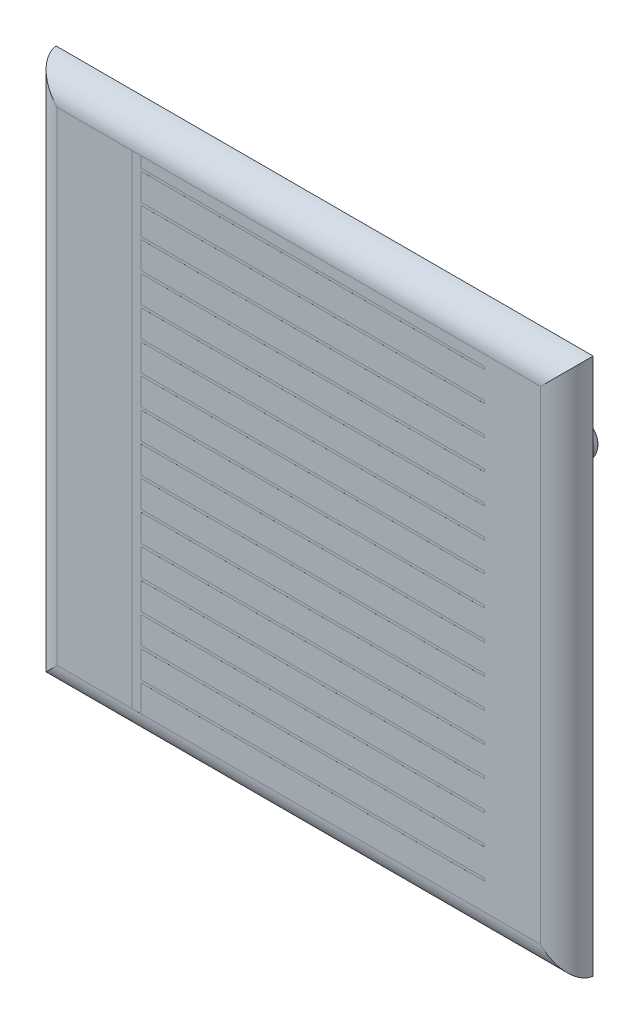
ISO-10303-21;
HEADER;
FILE_DESCRIPTION(('STEP AP214'),'2;1');
FILE_NAME('part.step','',(''),(''),'','','');
FILE_SCHEMA(('AUTOMOTIVE_DESIGN { 1 0 10303 214 1 1 1 1 }'));
ENDSEC;
DATA;
#1=APPLICATION_CONTEXT('core data for automotive mechanical design processes');
#2=APPLICATION_PROTOCOL_DEFINITION('international standard','automotive_design',2000,#1);
#3=PRODUCT_CONTEXT('',#1,'mechanical');
#4=PRODUCT('Part','Part','',(#3));
#5=PRODUCT_RELATED_PRODUCT_CATEGORY('part','',(#4));
#6=PRODUCT_DEFINITION_FORMATION('','',#4);
#7=PRODUCT_DEFINITION_CONTEXT('part definition',#1,'design');
#8=PRODUCT_DEFINITION('design','',#6,#7);
#9=PRODUCT_DEFINITION_SHAPE('','',#8);
#10=(LENGTH_UNIT() NAMED_UNIT(*) SI_UNIT(.MILLI.,.METRE.));
#11=(NAMED_UNIT(*) PLANE_ANGLE_UNIT() SI_UNIT($,.RADIAN.));
#12=(NAMED_UNIT(*) SI_UNIT($,.STERADIAN.) SOLID_ANGLE_UNIT());
#13=UNCERTAINTY_MEASURE_WITH_UNIT(LENGTH_MEASURE(1.E-05),#10,'distance_accuracy_value','');
#14=(GEOMETRIC_REPRESENTATION_CONTEXT(3) GLOBAL_UNCERTAINTY_ASSIGNED_CONTEXT((#13)) GLOBAL_UNIT_ASSIGNED_CONTEXT((#10,
#11,#12)) REPRESENTATION_CONTEXT('',''));
#15=CARTESIAN_POINT('',(0.,0.,0.));
#16=DIRECTION('',(0.,0.,1.));
#17=DIRECTION('',(1.,0.,0.));
#18=AXIS2_PLACEMENT_3D('',#15,#16,#17);
#19=CARTESIAN_POINT('',(0.,60.,0.));
#20=DIRECTION('',(0.,0.,-1.));
#21=DIRECTION('',(-1.,0.,0.));
#22=AXIS2_PLACEMENT_3D('',#19,#20,#21);
#23=PLANE('',#22);
#24=CARTESIAN_POINT('',(3.2637393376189,30.3971567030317,0.));
#25=DIRECTION('',(0.,0.,-1.));
#26=DIRECTION('',(-1.,0.,0.));
#27=AXIS2_PLACEMENT_3D('',#24,#25,#26);
#28=CIRCLE('',#27,2.);
#29=CARTESIAN_POINT('',(5.2637393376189,30.3971567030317,0.));
#30=VERTEX_POINT('',#29);
#31=EDGE_CURVE('E808',#30,#30,#28,.T.);
#32=ORIENTED_EDGE('',*,*,#31,.F.);
#33=EDGE_LOOP('',(#32));
#34=FACE_BOUND('',#33,.T.);
#35=DIRECTION('',(0.,-1.,0.));
#36=VECTOR('',#35,1.);
#37=CARTESIAN_POINT('',(0.876260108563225,30.,0.));
#38=LINE('',#37,#36);
#39=CARTESIAN_POINT('',(0.876260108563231,50.,0.));
#40=VERTEX_POINT('',#39);
#41=CARTESIAN_POINT('',(0.876260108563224,28.,0.));
#42=VERTEX_POINT('',#41);
#43=EDGE_CURVE('E840',#40,#42,#38,.T.);
#44=ORIENTED_EDGE('',*,*,#43,.F.);
#45=CARTESIAN_POINT('',(2.87626010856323,50.,0.));
#46=DIRECTION('',(0.,0.,-1.));
#47=DIRECTION('',(-1.,0.,0.));
#48=AXIS2_PLACEMENT_3D('',#45,#46,#47);
#49=CIRCLE('',#48,2.);
#50=CARTESIAN_POINT('',(4.87626010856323,50.,0.));
#51=VERTEX_POINT('',#50);
#52=EDGE_CURVE('E798',#51,#40,#49,.T.);
#53=ORIENTED_EDGE('',*,*,#52,.F.);
#54=DIRECTION('',(0.,1.,0.));
#55=VECTOR('',#54,1.);
#56=CARTESIAN_POINT('',(4.87626010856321,30.,0.));
#57=LINE('',#56,#55);
#58=CARTESIAN_POINT('',(4.87626010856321,32.,0.));
#59=VERTEX_POINT('',#58);
#60=EDGE_CURVE('E837',#59,#51,#57,.T.);
#61=ORIENTED_EDGE('',*,*,#60,.F.);
#62=DIRECTION('',(-1.,0.,0.));
#63=VECTOR('',#62,1.);
#64=CARTESIAN_POINT('',(-36.1414213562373,32.,0.));
#65=LINE('',#64,#63);
#66=CARTESIAN_POINT('',(22.8762601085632,32.,0.));
#67=VERTEX_POINT('',#66);
#68=EDGE_CURVE('E845',#67,#59,#65,.T.);
#69=ORIENTED_EDGE('',*,*,#68,.F.);
#70=CARTESIAN_POINT('',(22.8762601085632,30.,0.));
#71=DIRECTION('',(0.,0.,-1.));
#72=DIRECTION('',(-1.,0.,0.));
#73=AXIS2_PLACEMENT_3D('',#70,#71,#72);
#74=CIRCLE('',#73,2.);
#75=CARTESIAN_POINT('',(22.8762601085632,28.,0.));
#76=VERTEX_POINT('',#75);
#77=EDGE_CURVE('E1547',#67,#76,#74,.F.);
#78=ORIENTED_EDGE('',*,*,#77,.T.);
#79=DIRECTION('',(1.,0.,0.));
#80=VECTOR('',#79,1.);
#81=CARTESIAN_POINT('',(-36.1414213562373,28.,0.));
#82=LINE('',#81,#80);
#83=EDGE_CURVE('E842',#42,#76,#82,.T.);
#84=ORIENTED_EDGE('',*,*,#83,.F.);
#85=EDGE_LOOP('',(#44,#53,#61,#69,#78,#84));
#86=FACE_BOUND('',#85,.T.);
#87=ADVANCED_FACE('F27',(#34,#86),#23,.T.);
#88=CARTESIAN_POINT('',(56.8604612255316,30.3971567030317,0.));
#89=DIRECTION('',(0.,0.,-1.));
#90=DIRECTION('',(-1.,0.,0.));
#91=AXIS2_PLACEMENT_3D('',#88,#89,#90);
#92=CIRCLE('',#91,2.);
#93=CARTESIAN_POINT('',(58.8604612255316,30.3971567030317,0.));
#94=VERTEX_POINT('',#93);
#95=EDGE_CURVE('E814',#94,#94,#92,.T.);
#96=ORIENTED_EDGE('',*,*,#95,.F.);
#97=EDGE_LOOP('',(#96));
#98=FACE_BOUND('',#97,.T.);
#99=DIRECTION('',(0.,1.,0.));
#100=VECTOR('',#99,1.);
#101=CARTESIAN_POINT('',(55.1237398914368,30.,0.));
#102=LINE('',#101,#100);
#103=CARTESIAN_POINT('',(55.1237398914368,32.,0.));
#104=VERTEX_POINT('',#103);
#105=CARTESIAN_POINT('',(55.1237398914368,50.,0.));
#106=VERTEX_POINT('',#105);
#107=EDGE_CURVE('E828',#104,#106,#102,.T.);
#108=ORIENTED_EDGE('',*,*,#107,.T.);
#109=CARTESIAN_POINT('',(57.1237398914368,50.,0.));
#110=DIRECTION('',(0.,0.,-1.));
#111=DIRECTION('',(-1.,0.,0.));
#112=AXIS2_PLACEMENT_3D('',#109,#110,#111);
#113=CIRCLE('',#112,2.);
#114=CARTESIAN_POINT('',(59.1237398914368,50.,0.));
#115=VERTEX_POINT('',#114);
#116=EDGE_CURVE('E805',#115,#106,#113,.T.);
#117=ORIENTED_EDGE('',*,*,#116,.F.);
#118=DIRECTION('',(0.,-1.,0.));
#119=VECTOR('',#118,1.);
#120=CARTESIAN_POINT('',(59.1237398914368,30.,0.));
#121=LINE('',#120,#119);
#122=CARTESIAN_POINT('',(59.1237398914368,28.,0.));
#123=VERTEX_POINT('',#122);
#124=EDGE_CURVE('E835',#115,#123,#121,.T.);
#125=ORIENTED_EDGE('',*,*,#124,.T.);
#126=DIRECTION('',(-1.,0.,0.));
#127=VECTOR('',#126,1.);
#128=CARTESIAN_POINT('',(-36.1414213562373,28.,0.));
#129=LINE('',#128,#127);
#130=CARTESIAN_POINT('',(37.1237398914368,28.,0.));
#131=VERTEX_POINT('',#130);
#132=EDGE_CURVE('E832',#123,#131,#129,.T.);
#133=ORIENTED_EDGE('',*,*,#132,.T.);
#134=CARTESIAN_POINT('',(37.1237398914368,30.,0.));
#135=DIRECTION('',(0.,0.,-1.));
#136=DIRECTION('',(-1.,0.,0.));
#137=AXIS2_PLACEMENT_3D('',#134,#135,#136);
#138=CIRCLE('',#137,2.);
#139=CARTESIAN_POINT('',(37.1237398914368,32.,0.));
#140=VERTEX_POINT('',#139);
#141=EDGE_CURVE('E823',#140,#131,#138,.T.);
#142=ORIENTED_EDGE('',*,*,#141,.F.);
#143=DIRECTION('',(1.,0.,0.));
#144=VECTOR('',#143,1.);
#145=CARTESIAN_POINT('',(-36.1414213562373,32.,0.));
#146=LINE('',#145,#144);
#147=EDGE_CURVE('E830',#140,#104,#146,.T.);
#148=ORIENTED_EDGE('',*,*,#147,.T.);
#149=EDGE_LOOP('',(#108,#117,#125,#133,#142,#148));
#150=FACE_BOUND('',#149,.T.);
#151=ADVANCED_FACE('F1578',(#98,#150),#23,.T.);
#152=CARTESIAN_POINT('',(0.,60.,2.88));
#153=DIRECTION('',(0.,0.,-1.));
#154=DIRECTION('',(-1.,0.,0.));
#155=AXIS2_PLACEMENT_3D('',#152,#153,#154);
#156=PLANE('',#155);
#157=DIRECTION('',(1.,0.,0.));
#158=VECTOR('',#157,1.);
#159=CARTESIAN_POINT('',(0.,57.0024009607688,2.88));
#160=LINE('',#159,#158);
#161=CARTESIAN_POINT('',(57.,57.0024009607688,2.88));
#162=VERTEX_POINT('',#161);
#163=CARTESIAN_POINT('',(12.3559322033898,57.0024009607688,2.88));
#164=VERTEX_POINT('',#163);
#165=EDGE_CURVE('E1521',#162,#164,#160,.F.);
#166=ORIENTED_EDGE('',*,*,#165,.T.);
#167=DIRECTION('',(0.,1.,0.));
#168=VECTOR('',#167,1.);
#169=CARTESIAN_POINT('',(12.3559322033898,57.0024009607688,2.88));
#170=LINE('',#169,#168);
#171=CARTESIAN_POINT('',(12.3559322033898,55.7975990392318,2.88));
#172=VERTEX_POINT('',#171);
#173=EDGE_CURVE('E1147',#172,#164,#170,.T.);
#174=ORIENTED_EDGE('',*,*,#173,.F.);
#175=DIRECTION('',(-1.,0.,0.));
#176=VECTOR('',#175,1.);
#177=CARTESIAN_POINT('',(12.3559322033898,55.7975990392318,2.88));
#178=LINE('',#177,#176);
#179=CARTESIAN_POINT('',(50.7156308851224,55.7975990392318,2.88));
#180=VERTEX_POINT('',#179);
#181=EDGE_CURVE('E1144',#180,#172,#178,.T.);
#182=ORIENTED_EDGE('',*,*,#181,.F.);
#183=DIRECTION('',(0.,1.,0.));
#184=VECTOR('',#183,1.);
#185=CARTESIAN_POINT('',(50.7156308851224,55.7975990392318,2.88));
#186=LINE('',#185,#184);
#187=CARTESIAN_POINT('',(50.7156308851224,55.4975990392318,2.88));
#188=VERTEX_POINT('',#187);
#189=EDGE_CURVE('E1141',#188,#180,#186,.T.);
#190=ORIENTED_EDGE('',*,*,#189,.F.);
#191=DIRECTION('',(1.,0.,0.));
#192=VECTOR('',#191,1.);
#193=CARTESIAN_POINT('',(50.7156308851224,55.4975990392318,2.88));
#194=LINE('',#193,#192);
#195=CARTESIAN_POINT('',(12.3559322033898,55.4975990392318,2.88));
#196=VERTEX_POINT('',#195);
#197=EDGE_CURVE('E1138',#196,#188,#194,.T.);
#198=ORIENTED_EDGE('',*,*,#197,.F.);
#199=DIRECTION('',(0.,1.,0.));
#200=VECTOR('',#199,1.);
#201=CARTESIAN_POINT('',(12.3559322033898,55.4975990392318,2.88));
#202=LINE('',#201,#200);
#203=CARTESIAN_POINT('',(12.3559322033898,52.4975990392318,2.88));
#204=VERTEX_POINT('',#203);
#205=EDGE_CURVE('E1135',#204,#196,#202,.T.);
#206=ORIENTED_EDGE('',*,*,#205,.F.);
#207=DIRECTION('',(-1.,0.,0.));
#208=VECTOR('',#207,1.);
#209=CARTESIAN_POINT('',(12.3559322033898,52.4975990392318,2.88));
#210=LINE('',#209,#208);
#211=CARTESIAN_POINT('',(50.7156308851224,52.4975990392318,2.88));
#212=VERTEX_POINT('',#211);
#213=EDGE_CURVE('E1132',#212,#204,#210,.T.);
#214=ORIENTED_EDGE('',*,*,#213,.F.);
#215=DIRECTION('',(0.,1.,0.));
#216=VECTOR('',#215,1.);
#217=CARTESIAN_POINT('',(50.7156308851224,52.4975990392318,2.88));
#218=LINE('',#217,#216);
#219=CARTESIAN_POINT('',(50.7156308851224,52.1975990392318,2.88));
#220=VERTEX_POINT('',#219);
#221=EDGE_CURVE('E1129',#220,#212,#218,.T.);
#222=ORIENTED_EDGE('',*,*,#221,.F.);
#223=DIRECTION('',(1.,0.,0.));
#224=VECTOR('',#223,1.);
#225=CARTESIAN_POINT('',(50.7156308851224,52.1975990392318,2.88));
#226=LINE('',#225,#224);
#227=CARTESIAN_POINT('',(12.3559322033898,52.1975990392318,2.88));
#228=VERTEX_POINT('',#227);
#229=EDGE_CURVE('E1126',#228,#220,#226,.T.);
#230=ORIENTED_EDGE('',*,*,#229,.F.);
#231=DIRECTION('',(0.,1.,0.));
#232=VECTOR('',#231,1.);
#233=CARTESIAN_POINT('',(12.3559322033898,52.1975990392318,2.88));
#234=LINE('',#233,#232);
#235=CARTESIAN_POINT('',(12.3559322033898,49.1975990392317,2.88));
#236=VERTEX_POINT('',#235);
#237=EDGE_CURVE('E1123',#236,#228,#234,.T.);
#238=ORIENTED_EDGE('',*,*,#237,.F.);
#239=DIRECTION('',(-1.,0.,0.));
#240=VECTOR('',#239,1.);
#241=CARTESIAN_POINT('',(12.3559322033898,49.1975990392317,2.88));
#242=LINE('',#241,#240);
#243=CARTESIAN_POINT('',(50.7156308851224,49.1975990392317,2.88));
#244=VERTEX_POINT('',#243);
#245=EDGE_CURVE('E1120',#244,#236,#242,.T.);
#246=ORIENTED_EDGE('',*,*,#245,.F.);
#247=DIRECTION('',(0.,1.,0.));
#248=VECTOR('',#247,1.);
#249=CARTESIAN_POINT('',(50.7156308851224,49.1975990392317,2.88));
#250=LINE('',#249,#248);
#251=CARTESIAN_POINT('',(50.7156308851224,48.8975990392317,2.88));
#252=VERTEX_POINT('',#251);
#253=EDGE_CURVE('E1117',#252,#244,#250,.T.);
#254=ORIENTED_EDGE('',*,*,#253,.F.);
#255=DIRECTION('',(1.,0.,0.));
#256=VECTOR('',#255,1.);
#257=CARTESIAN_POINT('',(50.7156308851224,48.8975990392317,2.88));
#258=LINE('',#257,#256);
#259=CARTESIAN_POINT('',(12.3559322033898,48.8975990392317,2.88));
#260=VERTEX_POINT('',#259);
#261=EDGE_CURVE('E1114',#260,#252,#258,.T.);
#262=ORIENTED_EDGE('',*,*,#261,.F.);
#263=DIRECTION('',(0.,1.,0.));
#264=VECTOR('',#263,1.);
#265=CARTESIAN_POINT('',(12.3559322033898,48.8975990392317,2.88));
#266=LINE('',#265,#264);
#267=CARTESIAN_POINT('',(12.3559322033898,45.8975990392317,2.88));
#268=VERTEX_POINT('',#267);
#269=EDGE_CURVE('E1111',#268,#260,#266,.T.);
#270=ORIENTED_EDGE('',*,*,#269,.F.);
#271=DIRECTION('',(-1.,0.,0.));
#272=VECTOR('',#271,1.);
#273=CARTESIAN_POINT('',(12.3559322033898,45.8975990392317,2.88));
#274=LINE('',#273,#272);
#275=CARTESIAN_POINT('',(50.7156308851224,45.8975990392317,2.88));
#276=VERTEX_POINT('',#275);
#277=EDGE_CURVE('E1108',#276,#268,#274,.T.);
#278=ORIENTED_EDGE('',*,*,#277,.F.);
#279=DIRECTION('',(0.,1.,0.));
#280=VECTOR('',#279,1.);
#281=CARTESIAN_POINT('',(50.7156308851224,45.8975990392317,2.88));
#282=LINE('',#281,#280);
#283=CARTESIAN_POINT('',(50.7156308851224,45.5975990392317,2.88));
#284=VERTEX_POINT('',#283);
#285=EDGE_CURVE('E1105',#284,#276,#282,.T.);
#286=ORIENTED_EDGE('',*,*,#285,.F.);
#287=DIRECTION('',(1.,0.,0.));
#288=VECTOR('',#287,1.);
#289=CARTESIAN_POINT('',(50.7156308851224,45.5975990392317,2.88));
#290=LINE('',#289,#288);
#291=CARTESIAN_POINT('',(12.3559322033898,45.5975990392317,2.88));
#292=VERTEX_POINT('',#291);
#293=EDGE_CURVE('E1102',#292,#284,#290,.T.);
#294=ORIENTED_EDGE('',*,*,#293,.F.);
#295=DIRECTION('',(0.,1.,0.));
#296=VECTOR('',#295,1.);
#297=CARTESIAN_POINT('',(12.3559322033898,45.5975990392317,2.88));
#298=LINE('',#297,#296);
#299=CARTESIAN_POINT('',(12.3559322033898,42.5975990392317,2.88));
#300=VERTEX_POINT('',#299);
#301=EDGE_CURVE('E1099',#300,#292,#298,.T.);
#302=ORIENTED_EDGE('',*,*,#301,.F.);
#303=DIRECTION('',(-1.,0.,0.));
#304=VECTOR('',#303,1.);
#305=CARTESIAN_POINT('',(12.3559322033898,42.5975990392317,2.88));
#306=LINE('',#305,#304);
#307=CARTESIAN_POINT('',(50.7156308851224,42.5975990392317,2.88));
#308=VERTEX_POINT('',#307);
#309=EDGE_CURVE('E1096',#308,#300,#306,.T.);
#310=ORIENTED_EDGE('',*,*,#309,.F.);
#311=DIRECTION('',(0.,1.,0.));
#312=VECTOR('',#311,1.);
#313=CARTESIAN_POINT('',(50.7156308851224,42.5975990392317,2.88));
#314=LINE('',#313,#312);
#315=CARTESIAN_POINT('',(50.7156308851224,42.2975990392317,2.88));
#316=VERTEX_POINT('',#315);
#317=EDGE_CURVE('E1093',#316,#308,#314,.T.);
#318=ORIENTED_EDGE('',*,*,#317,.F.);
#319=DIRECTION('',(1.,0.,0.));
#320=VECTOR('',#319,1.);
#321=CARTESIAN_POINT('',(50.7156308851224,42.2975990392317,2.88));
#322=LINE('',#321,#320);
#323=CARTESIAN_POINT('',(12.3559322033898,42.2975990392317,2.88));
#324=VERTEX_POINT('',#323);
#325=EDGE_CURVE('E1090',#324,#316,#322,.T.);
#326=ORIENTED_EDGE('',*,*,#325,.F.);
#327=DIRECTION('',(0.,1.,0.));
#328=VECTOR('',#327,1.);
#329=CARTESIAN_POINT('',(12.3559322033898,42.2975990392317,2.88));
#330=LINE('',#329,#328);
#331=CARTESIAN_POINT('',(12.3559322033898,39.2975990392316,2.88));
#332=VERTEX_POINT('',#331);
#333=EDGE_CURVE('E1087',#332,#324,#330,.T.);
#334=ORIENTED_EDGE('',*,*,#333,.F.);
#335=DIRECTION('',(-1.,0.,0.));
#336=VECTOR('',#335,1.);
#337=CARTESIAN_POINT('',(12.3559322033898,39.2975990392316,2.88));
#338=LINE('',#337,#336);
#339=CARTESIAN_POINT('',(50.7156308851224,39.2975990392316,2.88));
#340=VERTEX_POINT('',#339);
#341=EDGE_CURVE('E1084',#340,#332,#338,.T.);
#342=ORIENTED_EDGE('',*,*,#341,.F.);
#343=DIRECTION('',(0.,1.,0.));
#344=VECTOR('',#343,1.);
#345=CARTESIAN_POINT('',(50.7156308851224,39.2975990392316,2.88));
#346=LINE('',#345,#344);
#347=CARTESIAN_POINT('',(50.7156308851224,38.9975990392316,2.88));
#348=VERTEX_POINT('',#347);
#349=EDGE_CURVE('E1081',#348,#340,#346,.T.);
#350=ORIENTED_EDGE('',*,*,#349,.F.);
#351=DIRECTION('',(1.,0.,0.));
#352=VECTOR('',#351,1.);
#353=CARTESIAN_POINT('',(50.7156308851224,38.9975990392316,2.88));
#354=LINE('',#353,#352);
#355=CARTESIAN_POINT('',(12.3559322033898,38.9975990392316,2.88));
#356=VERTEX_POINT('',#355);
#357=EDGE_CURVE('E1078',#356,#348,#354,.T.);
#358=ORIENTED_EDGE('',*,*,#357,.F.);
#359=DIRECTION('',(0.,1.,0.));
#360=VECTOR('',#359,1.);
#361=CARTESIAN_POINT('',(12.3559322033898,38.9975990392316,2.88));
#362=LINE('',#361,#360);
#363=CARTESIAN_POINT('',(12.3559322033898,35.9975990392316,2.88));
#364=VERTEX_POINT('',#363);
#365=EDGE_CURVE('E1075',#364,#356,#362,.T.);
#366=ORIENTED_EDGE('',*,*,#365,.F.);
#367=DIRECTION('',(-1.,0.,0.));
#368=VECTOR('',#367,1.);
#369=CARTESIAN_POINT('',(12.3559322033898,35.9975990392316,2.88));
#370=LINE('',#369,#368);
#371=CARTESIAN_POINT('',(50.7156308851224,35.9975990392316,2.88));
#372=VERTEX_POINT('',#371);
#373=EDGE_CURVE('E1072',#372,#364,#370,.T.);
#374=ORIENTED_EDGE('',*,*,#373,.F.);
#375=DIRECTION('',(0.,1.,0.));
#376=VECTOR('',#375,1.);
#377=CARTESIAN_POINT('',(50.7156308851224,35.9975990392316,2.88));
#378=LINE('',#377,#376);
#379=CARTESIAN_POINT('',(50.7156308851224,35.6975990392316,2.88));
#380=VERTEX_POINT('',#379);
#381=EDGE_CURVE('E1069',#380,#372,#378,.T.);
#382=ORIENTED_EDGE('',*,*,#381,.F.);
#383=DIRECTION('',(1.,0.,0.));
#384=VECTOR('',#383,1.);
#385=CARTESIAN_POINT('',(50.7156308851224,35.6975990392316,2.88));
#386=LINE('',#385,#384);
#387=CARTESIAN_POINT('',(12.3559322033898,35.6975990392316,2.88));
#388=VERTEX_POINT('',#387);
#389=EDGE_CURVE('E1066',#388,#380,#386,.T.);
#390=ORIENTED_EDGE('',*,*,#389,.F.);
#391=DIRECTION('',(0.,1.,0.));
#392=VECTOR('',#391,1.);
#393=CARTESIAN_POINT('',(12.3559322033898,35.6975990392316,2.88));
#394=LINE('',#393,#392);
#395=CARTESIAN_POINT('',(12.3559322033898,32.6975990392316,2.88));
#396=VERTEX_POINT('',#395);
#397=EDGE_CURVE('E1063',#396,#388,#394,.T.);
#398=ORIENTED_EDGE('',*,*,#397,.F.);
#399=DIRECTION('',(-1.,0.,0.));
#400=VECTOR('',#399,1.);
#401=CARTESIAN_POINT('',(12.3559322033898,32.6975990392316,2.88));
#402=LINE('',#401,#400);
#403=CARTESIAN_POINT('',(50.7156308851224,32.6975990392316,2.88));
#404=VERTEX_POINT('',#403);
#405=EDGE_CURVE('E1060',#404,#396,#402,.T.);
#406=ORIENTED_EDGE('',*,*,#405,.F.);
#407=DIRECTION('',(0.,1.,0.));
#408=VECTOR('',#407,1.);
#409=CARTESIAN_POINT('',(50.7156308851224,32.6975990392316,2.88));
#410=LINE('',#409,#408);
#411=CARTESIAN_POINT('',(50.7156308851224,32.3975990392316,2.88));
#412=VERTEX_POINT('',#411);
#413=EDGE_CURVE('E1057',#412,#404,#410,.T.);
#414=ORIENTED_EDGE('',*,*,#413,.F.);
#415=DIRECTION('',(1.,0.,0.));
#416=VECTOR('',#415,1.);
#417=CARTESIAN_POINT('',(50.7156308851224,32.3975990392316,2.88));
#418=LINE('',#417,#416);
#419=CARTESIAN_POINT('',(12.3559322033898,32.3975990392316,2.88));
#420=VERTEX_POINT('',#419);
#421=EDGE_CURVE('E1054',#420,#412,#418,.T.);
#422=ORIENTED_EDGE('',*,*,#421,.F.);
#423=DIRECTION('',(0.,1.,0.));
#424=VECTOR('',#423,1.);
#425=CARTESIAN_POINT('',(12.3559322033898,32.3975990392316,2.88));
#426=LINE('',#425,#424);
#427=CARTESIAN_POINT('',(12.3559322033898,29.3975990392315,2.88));
#428=VERTEX_POINT('',#427);
#429=EDGE_CURVE('E1051',#428,#420,#426,.T.);
#430=ORIENTED_EDGE('',*,*,#429,.F.);
#431=DIRECTION('',(-1.,0.,0.));
#432=VECTOR('',#431,1.);
#433=CARTESIAN_POINT('',(12.3559322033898,29.3975990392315,2.88));
#434=LINE('',#433,#432);
#435=CARTESIAN_POINT('',(50.7156308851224,29.3975990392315,2.88));
#436=VERTEX_POINT('',#435);
#437=EDGE_CURVE('E1048',#436,#428,#434,.T.);
#438=ORIENTED_EDGE('',*,*,#437,.F.);
#439=DIRECTION('',(0.,1.,0.));
#440=VECTOR('',#439,1.);
#441=CARTESIAN_POINT('',(50.7156308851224,29.3975990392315,2.88));
#442=LINE('',#441,#440);
#443=CARTESIAN_POINT('',(50.7156308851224,29.0975990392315,2.88));
#444=VERTEX_POINT('',#443);
#445=EDGE_CURVE('E1045',#444,#436,#442,.T.);
#446=ORIENTED_EDGE('',*,*,#445,.F.);
#447=DIRECTION('',(1.,0.,0.));
#448=VECTOR('',#447,1.);
#449=CARTESIAN_POINT('',(50.7156308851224,29.0975990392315,2.88));
#450=LINE('',#449,#448);
#451=CARTESIAN_POINT('',(12.3559322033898,29.0975990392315,2.88));
#452=VERTEX_POINT('',#451);
#453=EDGE_CURVE('E1042',#452,#444,#450,.T.);
#454=ORIENTED_EDGE('',*,*,#453,.F.);
#455=DIRECTION('',(0.,1.,0.));
#456=VECTOR('',#455,1.);
#457=CARTESIAN_POINT('',(12.3559322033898,29.0975990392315,2.88));
#458=LINE('',#457,#456);
#459=CARTESIAN_POINT('',(12.3559322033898,26.0975990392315,2.88));
#460=VERTEX_POINT('',#459);
#461=EDGE_CURVE('E1039',#460,#452,#458,.T.);
#462=ORIENTED_EDGE('',*,*,#461,.F.);
#463=DIRECTION('',(-1.,0.,0.));
#464=VECTOR('',#463,1.);
#465=CARTESIAN_POINT('',(12.3559322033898,26.0975990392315,2.88));
#466=LINE('',#465,#464);
#467=CARTESIAN_POINT('',(50.7156308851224,26.0975990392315,2.88));
#468=VERTEX_POINT('',#467);
#469=EDGE_CURVE('E1036',#468,#460,#466,.T.);
#470=ORIENTED_EDGE('',*,*,#469,.F.);
#471=DIRECTION('',(0.,1.,0.));
#472=VECTOR('',#471,1.);
#473=CARTESIAN_POINT('',(50.7156308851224,26.0975990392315,2.88));
#474=LINE('',#473,#472);
#475=CARTESIAN_POINT('',(50.7156308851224,25.7975990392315,2.88));
#476=VERTEX_POINT('',#475);
#477=EDGE_CURVE('E1033',#476,#468,#474,.T.);
#478=ORIENTED_EDGE('',*,*,#477,.F.);
#479=DIRECTION('',(1.,0.,0.));
#480=VECTOR('',#479,1.);
#481=CARTESIAN_POINT('',(50.7156308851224,25.7975990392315,2.88));
#482=LINE('',#481,#480);
#483=CARTESIAN_POINT('',(12.3559322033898,25.7975990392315,2.88));
#484=VERTEX_POINT('',#483);
#485=EDGE_CURVE('E1030',#484,#476,#482,.T.);
#486=ORIENTED_EDGE('',*,*,#485,.F.);
#487=DIRECTION('',(0.,1.,0.));
#488=VECTOR('',#487,1.);
#489=CARTESIAN_POINT('',(12.3559322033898,25.7975990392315,2.88));
#490=LINE('',#489,#488);
#491=CARTESIAN_POINT('',(12.3559322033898,22.7975990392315,2.88));
#492=VERTEX_POINT('',#491);
#493=EDGE_CURVE('E1027',#492,#484,#490,.T.);
#494=ORIENTED_EDGE('',*,*,#493,.F.);
#495=DIRECTION('',(-1.,0.,0.));
#496=VECTOR('',#495,1.);
#497=CARTESIAN_POINT('',(12.3559322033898,22.7975990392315,2.88));
#498=LINE('',#497,#496);
#499=CARTESIAN_POINT('',(50.7156308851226,22.7975990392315,2.88));
#500=VERTEX_POINT('',#499);
#501=EDGE_CURVE('E1024',#500,#492,#498,.T.);
#502=ORIENTED_EDGE('',*,*,#501,.F.);
#503=DIRECTION('',(1.17961196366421E-12,1.,0.));
#504=VECTOR('',#503,1.);
#505=CARTESIAN_POINT('',(50.7156308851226,22.7975990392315,2.88));
#506=LINE('',#505,#504);
#507=CARTESIAN_POINT('',(50.7156308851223,22.4975990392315,2.88));
#508=VERTEX_POINT('',#507);
#509=EDGE_CURVE('E1021',#508,#500,#506,.T.);
#510=ORIENTED_EDGE('',*,*,#509,.F.);
#511=DIRECTION('',(1.,0.,0.));
#512=VECTOR('',#511,1.);
#513=CARTESIAN_POINT('',(50.7156308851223,22.4975990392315,2.88));
#514=LINE('',#513,#512);
#515=CARTESIAN_POINT('',(12.3559322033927,22.4975990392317,2.88));
#516=VERTEX_POINT('',#515);
#517=EDGE_CURVE('E1018',#516,#508,#514,.T.);
#518=ORIENTED_EDGE('',*,*,#517,.F.);
#519=DIRECTION('',(0.,1.,0.));
#520=VECTOR('',#519,1.);
#521=CARTESIAN_POINT('',(12.3559322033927,22.4975990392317,2.88));
#522=LINE('',#521,#520);
#523=CARTESIAN_POINT('',(12.3559322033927,19.4975990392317,2.88));
#524=VERTEX_POINT('',#523);
#525=EDGE_CURVE('E1015',#524,#516,#522,.T.);
#526=ORIENTED_EDGE('',*,*,#525,.F.);
#527=DIRECTION('',(-1.,0.,0.));
#528=VECTOR('',#527,1.);
#529=CARTESIAN_POINT('',(12.3559322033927,19.4975990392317,2.88));
#530=LINE('',#529,#528);
#531=CARTESIAN_POINT('',(50.7156308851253,19.4975990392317,2.88));
#532=VERTEX_POINT('',#531);
#533=EDGE_CURVE('E1012',#532,#524,#530,.T.);
#534=ORIENTED_EDGE('',*,*,#533,.F.);
#535=DIRECTION('',(0.,1.,0.));
#536=VECTOR('',#535,1.);
#537=CARTESIAN_POINT('',(50.7156308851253,19.4975990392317,2.88));
#538=LINE('',#537,#536);
#539=CARTESIAN_POINT('',(50.7156308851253,19.1975990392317,2.88));
#540=VERTEX_POINT('',#539);
#541=EDGE_CURVE('E1009',#540,#532,#538,.T.);
#542=ORIENTED_EDGE('',*,*,#541,.F.);
#543=DIRECTION('',(1.,0.,0.));
#544=VECTOR('',#543,1.);
#545=CARTESIAN_POINT('',(50.7156308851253,19.1975990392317,2.88));
#546=LINE('',#545,#544);
#547=CARTESIAN_POINT('',(12.3559322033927,19.1975990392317,2.88));
#548=VERTEX_POINT('',#547);
#549=EDGE_CURVE('E1006',#548,#540,#546,.T.);
#550=ORIENTED_EDGE('',*,*,#549,.F.);
#551=DIRECTION('',(0.,1.,0.));
#552=VECTOR('',#551,1.);
#553=CARTESIAN_POINT('',(12.3559322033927,19.1975990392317,2.88));
#554=LINE('',#553,#552);
#555=CARTESIAN_POINT('',(12.3559322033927,16.1975990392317,2.88));
#556=VERTEX_POINT('',#555);
#557=EDGE_CURVE('E1003',#556,#548,#554,.T.);
#558=ORIENTED_EDGE('',*,*,#557,.F.);
#559=DIRECTION('',(-1.,0.,0.));
#560=VECTOR('',#559,1.);
#561=CARTESIAN_POINT('',(12.3559322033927,16.1975990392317,2.88));
#562=LINE('',#561,#560);
#563=CARTESIAN_POINT('',(50.7156308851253,16.1975990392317,2.88));
#564=VERTEX_POINT('',#563);
#565=EDGE_CURVE('E1000',#564,#556,#562,.T.);
#566=ORIENTED_EDGE('',*,*,#565,.F.);
#567=DIRECTION('',(0.,1.,0.));
#568=VECTOR('',#567,1.);
#569=CARTESIAN_POINT('',(50.7156308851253,16.1975990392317,2.88));
#570=LINE('',#569,#568);
#571=CARTESIAN_POINT('',(50.7156308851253,15.8975990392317,2.88));
#572=VERTEX_POINT('',#571);
#573=EDGE_CURVE('E997',#572,#564,#570,.T.);
#574=ORIENTED_EDGE('',*,*,#573,.F.);
#575=DIRECTION('',(1.,0.,0.));
#576=VECTOR('',#575,1.);
#577=CARTESIAN_POINT('',(50.7156308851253,15.8975990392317,2.88));
#578=LINE('',#577,#576);
#579=CARTESIAN_POINT('',(12.3559322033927,15.8975990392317,2.88));
#580=VERTEX_POINT('',#579);
#581=EDGE_CURVE('E994',#580,#572,#578,.T.);
#582=ORIENTED_EDGE('',*,*,#581,.F.);
#583=DIRECTION('',(0.,1.,0.));
#584=VECTOR('',#583,1.);
#585=CARTESIAN_POINT('',(12.3559322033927,15.8975990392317,2.88));
#586=LINE('',#585,#584);
#587=CARTESIAN_POINT('',(12.3559322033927,12.8975990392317,2.88));
#588=VERTEX_POINT('',#587);
#589=EDGE_CURVE('E991',#588,#580,#586,.T.);
#590=ORIENTED_EDGE('',*,*,#589,.F.);
#591=DIRECTION('',(-1.,0.,0.));
#592=VECTOR('',#591,1.);
#593=CARTESIAN_POINT('',(12.3559322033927,12.8975990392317,2.88));
#594=LINE('',#593,#592);
#595=CARTESIAN_POINT('',(50.7156308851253,12.8975990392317,2.88));
#596=VERTEX_POINT('',#595);
#597=EDGE_CURVE('E988',#596,#588,#594,.T.);
#598=ORIENTED_EDGE('',*,*,#597,.F.);
#599=DIRECTION('',(0.,1.,0.));
#600=VECTOR('',#599,1.);
#601=CARTESIAN_POINT('',(50.7156308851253,12.8975990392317,2.88));
#602=LINE('',#601,#600);
#603=CARTESIAN_POINT('',(50.7156308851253,12.5975990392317,2.88));
#604=VERTEX_POINT('',#603);
#605=EDGE_CURVE('E985',#604,#596,#602,.T.);
#606=ORIENTED_EDGE('',*,*,#605,.F.);
#607=DIRECTION('',(1.,0.,0.));
#608=VECTOR('',#607,1.);
#609=CARTESIAN_POINT('',(50.7156308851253,12.5975990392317,2.88));
#610=LINE('',#609,#608);
#611=CARTESIAN_POINT('',(12.3559322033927,12.5975990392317,2.88));
#612=VERTEX_POINT('',#611);
#613=EDGE_CURVE('E982',#612,#604,#610,.T.);
#614=ORIENTED_EDGE('',*,*,#613,.F.);
#615=DIRECTION('',(0.,1.,0.));
#616=VECTOR('',#615,1.);
#617=CARTESIAN_POINT('',(12.3559322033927,12.5975990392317,2.88));
#618=LINE('',#617,#616);
#619=CARTESIAN_POINT('',(12.3559322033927,9.59759903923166,2.88));
#620=VERTEX_POINT('',#619);
#621=EDGE_CURVE('E979',#620,#612,#618,.T.);
#622=ORIENTED_EDGE('',*,*,#621,.F.);
#623=DIRECTION('',(-1.,0.,0.));
#624=VECTOR('',#623,1.);
#625=CARTESIAN_POINT('',(12.3559322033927,9.59759903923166,2.88));
#626=LINE('',#625,#624);
#627=CARTESIAN_POINT('',(50.7156308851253,9.59759903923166,2.88));
#628=VERTEX_POINT('',#627);
#629=EDGE_CURVE('E976',#628,#620,#626,.T.);
#630=ORIENTED_EDGE('',*,*,#629,.F.);
#631=DIRECTION('',(0.,1.,0.));
#632=VECTOR('',#631,1.);
#633=CARTESIAN_POINT('',(50.7156308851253,9.59759903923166,2.88));
#634=LINE('',#633,#632);
#635=CARTESIAN_POINT('',(50.7156308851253,9.29759903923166,2.88));
#636=VERTEX_POINT('',#635);
#637=EDGE_CURVE('E973',#636,#628,#634,.T.);
#638=ORIENTED_EDGE('',*,*,#637,.F.);
#639=DIRECTION('',(1.,0.,0.));
#640=VECTOR('',#639,1.);
#641=CARTESIAN_POINT('',(50.7156308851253,9.29759903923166,2.88));
#642=LINE('',#641,#640);
#643=CARTESIAN_POINT('',(12.3559322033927,9.29759903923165,2.88));
#644=VERTEX_POINT('',#643);
#645=EDGE_CURVE('E970',#644,#636,#642,.T.);
#646=ORIENTED_EDGE('',*,*,#645,.F.);
#647=DIRECTION('',(0.,1.,0.));
#648=VECTOR('',#647,1.);
#649=CARTESIAN_POINT('',(12.3559322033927,9.29759903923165,2.88));
#650=LINE('',#649,#648);
#651=CARTESIAN_POINT('',(12.3559322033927,6.29759903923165,2.88));
#652=VERTEX_POINT('',#651);
#653=EDGE_CURVE('E967',#652,#644,#650,.T.);
#654=ORIENTED_EDGE('',*,*,#653,.F.);
#655=DIRECTION('',(-1.,0.,0.));
#656=VECTOR('',#655,1.);
#657=CARTESIAN_POINT('',(12.3559322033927,6.29759903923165,2.88));
#658=LINE('',#657,#656);
#659=CARTESIAN_POINT('',(50.7156308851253,6.29759903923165,2.88));
#660=VERTEX_POINT('',#659);
#661=EDGE_CURVE('E964',#660,#652,#658,.T.);
#662=ORIENTED_EDGE('',*,*,#661,.F.);
#663=DIRECTION('',(0.,1.,0.));
#664=VECTOR('',#663,1.);
#665=CARTESIAN_POINT('',(50.7156308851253,6.29759903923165,2.88));
#666=LINE('',#665,#664);
#667=CARTESIAN_POINT('',(50.7156308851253,5.99759903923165,2.88));
#668=VERTEX_POINT('',#667);
#669=EDGE_CURVE('E961',#668,#660,#666,.T.);
#670=ORIENTED_EDGE('',*,*,#669,.F.);
#671=DIRECTION('',(1.,0.,0.));
#672=VECTOR('',#671,1.);
#673=CARTESIAN_POINT('',(50.7156308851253,5.99759903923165,2.88));
#674=LINE('',#673,#672);
#675=CARTESIAN_POINT('',(12.3559322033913,5.99759903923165,2.88));
#676=VERTEX_POINT('',#675);
#677=EDGE_CURVE('E958',#676,#668,#674,.T.);
#678=ORIENTED_EDGE('',*,*,#677,.F.);
#679=DIRECTION('',(0.,1.,0.));
#680=VECTOR('',#679,1.);
#681=CARTESIAN_POINT('',(12.3559322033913,5.99759903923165,2.88));
#682=LINE('',#681,#680);
#683=CARTESIAN_POINT('',(12.3559322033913,2.99759903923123,2.88));
#684=VERTEX_POINT('',#683);
#685=EDGE_CURVE('E955',#684,#676,#682,.T.);
#686=ORIENTED_EDGE('',*,*,#685,.F.);
#687=DIRECTION('',(-1.,0.,0.));
#688=VECTOR('',#687,1.);
#689=CARTESIAN_POINT('',(0.,2.99759903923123,2.88));
#690=LINE('',#689,#688);
#691=CARTESIAN_POINT('',(57.0024009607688,2.99759903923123,2.88));
#692=VERTEX_POINT('',#691);
#693=EDGE_CURVE('E1527',#684,#692,#690,.F.);
#694=ORIENTED_EDGE('',*,*,#693,.T.);
#695=DIRECTION('',(0.,-1.,0.));
#696=VECTOR('',#695,1.);
#697=CARTESIAN_POINT('',(57.0024009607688,60.,2.88));
#698=LINE('',#697,#696);
#699=CARTESIAN_POINT('',(57.0024009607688,3.,2.88));
#700=VERTEX_POINT('',#699);
#701=EDGE_CURVE('E1533',#692,#700,#698,.F.);
#702=ORIENTED_EDGE('',*,*,#701,.T.);
#703=DIRECTION('',(0.,-1.,0.));
#704=VECTOR('',#703,1.);
#705=CARTESIAN_POINT('',(57.0024009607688,60.,2.88));
#706=LINE('',#705,#704);
#707=CARTESIAN_POINT('',(57.0024009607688,57.0024009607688,2.88));
#708=VERTEX_POINT('',#707);
#709=EDGE_CURVE('E1531',#700,#708,#706,.F.);
#710=ORIENTED_EDGE('',*,*,#709,.T.);
#711=DIRECTION('',(1.,0.,0.));
#712=VECTOR('',#711,1.);
#713=CARTESIAN_POINT('',(0.,57.0024009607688,2.88));
#714=LINE('',#713,#712);
#715=EDGE_CURVE('E1524',#708,#162,#714,.F.);
#716=ORIENTED_EDGE('',*,*,#715,.T.);
#717=EDGE_LOOP('',(#166,#174,#182,#190,#198,#206,#214,#222,#230,#238,#246,#254,#262,#270,#278,
#286,#294,#302,#310,#318,#326,#334,#342,#350,#358,#366,#374,#382,#390,#398,#406,#414,#422,#430,
#438,#446,#454,#462,#470,#478,#486,#494,#502,#510,#518,#526,#534,#542,#550,#558,#566,#574,#582,
#590,#598,#606,#614,#622,#630,#638,#646,#654,#662,#670,#678,#686,#694,#702,#710,#716));
#718=FACE_BOUND('',#717,.T.);
#719=ADVANCED_FACE('F1585',(#718),#156,.F.);
#720=CARTESIAN_POINT('',(3.,2.99759903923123,2.88));
#721=VERTEX_POINT('',#720);
#722=CARTESIAN_POINT('',(11.3559322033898,2.99759903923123,2.88));
#723=VERTEX_POINT('',#722);
#724=EDGE_CURVE('E1528',#721,#723,#690,.F.);
#725=ORIENTED_EDGE('',*,*,#724,.T.);
#726=DIRECTION('',(0.,-1.,0.));
#727=VECTOR('',#726,1.);
#728=CARTESIAN_POINT('',(11.3559322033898,57.0024009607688,2.88));
#729=LINE('',#728,#727);
#730=CARTESIAN_POINT('',(11.3559322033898,57.0024009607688,2.88));
#731=VERTEX_POINT('',#730);
#732=EDGE_CURVE('E949',#731,#723,#729,.T.);
#733=ORIENTED_EDGE('',*,*,#732,.F.);
#734=CARTESIAN_POINT('',(3.,57.0024009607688,2.88));
#735=VERTEX_POINT('',#734);
#736=EDGE_CURVE('E1520',#731,#735,#160,.F.);
#737=ORIENTED_EDGE('',*,*,#736,.T.);
#738=DIRECTION('',(1.,0.,0.));
#739=VECTOR('',#738,1.);
#740=CARTESIAN_POINT('',(0.,57.0024009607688,2.88));
#741=LINE('',#740,#739);
#742=CARTESIAN_POINT('',(2.99759903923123,57.0024009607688,2.88));
#743=VERTEX_POINT('',#742);
#744=EDGE_CURVE('E1518',#735,#743,#741,.F.);
#745=ORIENTED_EDGE('',*,*,#744,.T.);
#746=DIRECTION('',(0.,1.,0.));
#747=VECTOR('',#746,1.);
#748=CARTESIAN_POINT('',(2.99759903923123,60.,2.88));
#749=LINE('',#748,#747);
#750=CARTESIAN_POINT('',(2.99759903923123,2.99759903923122,2.88));
#751=VERTEX_POINT('',#750);
#752=EDGE_CURVE('E1514',#743,#751,#749,.F.);
#753=ORIENTED_EDGE('',*,*,#752,.T.);
#754=DIRECTION('',(-1.,0.,0.));
#755=VECTOR('',#754,1.);
#756=CARTESIAN_POINT('',(0.,2.99759903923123,2.88));
#757=LINE('',#756,#755);
#758=EDGE_CURVE('E1516',#751,#721,#757,.F.);
#759=ORIENTED_EDGE('',*,*,#758,.T.);
#760=EDGE_LOOP('',(#725,#733,#737,#745,#753,#759));
#761=FACE_BOUND('',#760,.T.);
#762=ADVANCED_FACE('F29',(#761),#156,.F.);
#763=CARTESIAN_POINT('',(0.,2.99759903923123,-0.12));
#764=DIRECTION('',(-1.,0.,0.));
#765=DIRECTION('',(0.,0.,1.));
#766=AXIS2_PLACEMENT_3D('',#763,#764,#765);
#767=CYLINDRICAL_SURFACE('',#766,3.);
#768=CARTESIAN_POINT('',(2.99759903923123,2.99759903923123,-0.12));
#769=DIRECTION('',(-0.707106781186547,0.707106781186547,0.));
#770=DIRECTION('',(0.707106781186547,0.707106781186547,0.));
#771=AXIS2_PLACEMENT_3D('',#768,#769,#770);
#772=ELLIPSE('',#771,4.24264068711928,3.);
#773=CARTESIAN_POINT('',(0.,0.,0.));
#774=VERTEX_POINT('',#773);
#775=EDGE_CURVE('E1496',#774,#751,#772,.T.);
#776=ORIENTED_EDGE('',*,*,#775,.F.);
#777=DIRECTION('',(1.,0.,0.));
#778=VECTOR('',#777,1.);
#779=CARTESIAN_POINT('',(0.,0.,0.));
#780=LINE('',#779,#778);
#781=CARTESIAN_POINT('',(60.,0.,0.));
#782=VERTEX_POINT('',#781);
#783=EDGE_CURVE('E1505',#774,#782,#780,.T.);
#784=ORIENTED_EDGE('',*,*,#783,.T.);
#785=CARTESIAN_POINT('',(57.0024009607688,2.99759903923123,-0.12));
#786=DIRECTION('',(-0.707106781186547,-0.707106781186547,0.));
#787=DIRECTION('',(-0.707106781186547,0.707106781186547,0.));
#788=AXIS2_PLACEMENT_3D('',#785,#786,#787);
#789=ELLIPSE('',#788,4.24264068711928,3.);
#790=EDGE_CURVE('E1499',#692,#782,#789,.F.);
#791=ORIENTED_EDGE('',*,*,#790,.F.);
#792=ORIENTED_EDGE('',*,*,#693,.F.);
#793=DIRECTION('',(1.,0.,0.));
#794=VECTOR('',#793,1.);
#795=CARTESIAN_POINT('',(12.3559322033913,2.99759903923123,2.88));
#796=LINE('',#795,#794);
#797=EDGE_CURVE('E952',#723,#684,#796,.T.);
#798=ORIENTED_EDGE('',*,*,#797,.F.);
#799=ORIENTED_EDGE('',*,*,#724,.F.);
#800=ORIENTED_EDGE('',*,*,#758,.F.);
#801=EDGE_LOOP('',(#776,#784,#791,#792,#798,#799,#800));
#802=FACE_BOUND('',#801,.T.);
#803=ADVANCED_FACE('F1906',(#802),#767,.T.);
#804=CARTESIAN_POINT('',(57.0024009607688,0.,-0.12));
#805=DIRECTION('',(0.,-1.,0.));
#806=DIRECTION('',(0.,0.,-1.));
#807=AXIS2_PLACEMENT_3D('',#804,#805,#806);
#808=CYLINDRICAL_SURFACE('',#807,3.);
#809=ORIENTED_EDGE('',*,*,#790,.T.);
#810=DIRECTION('',(0.,1.,0.));
#811=VECTOR('',#810,1.);
#812=CARTESIAN_POINT('',(60.,0.,0.));
#813=LINE('',#812,#811);
#814=CARTESIAN_POINT('',(60.,60.,0.));
#815=VERTEX_POINT('',#814);
#816=EDGE_CURVE('E1508',#782,#815,#813,.T.);
#817=ORIENTED_EDGE('',*,*,#816,.T.);
#818=CARTESIAN_POINT('',(57.0024009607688,57.0024009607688,-0.12));
#819=DIRECTION('',(0.707106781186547,-0.707106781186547,0.));
#820=DIRECTION('',(-0.707106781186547,-0.707106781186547,0.));
#821=AXIS2_PLACEMENT_3D('',#818,#819,#820);
#822=ELLIPSE('',#821,4.24264068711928,3.);
#823=EDGE_CURVE('E1493',#708,#815,#822,.F.);
#824=ORIENTED_EDGE('',*,*,#823,.F.);
#825=ORIENTED_EDGE('',*,*,#709,.F.);
#826=ORIENTED_EDGE('',*,*,#701,.F.);
#827=EDGE_LOOP('',(#809,#817,#824,#825,#826));
#828=FACE_BOUND('',#827,.T.);
#829=ADVANCED_FACE('F1903',(#828),#808,.T.);
#830=CARTESIAN_POINT('',(2.99759903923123,0.,-0.12));
#831=DIRECTION('',(0.,1.,0.));
#832=DIRECTION('',(0.,0.,1.));
#833=AXIS2_PLACEMENT_3D('',#830,#831,#832);
#834=CYLINDRICAL_SURFACE('',#833,3.);
#835=ORIENTED_EDGE('',*,*,#775,.T.);
#836=ORIENTED_EDGE('',*,*,#752,.F.);
#837=CARTESIAN_POINT('',(2.99759903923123,57.0024009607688,-0.12));
#838=DIRECTION('',(0.707106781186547,0.707106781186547,0.));
#839=DIRECTION('',(-0.707106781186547,0.707106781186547,0.));
#840=AXIS2_PLACEMENT_3D('',#837,#838,#839);
#841=ELLIPSE('',#840,4.24264068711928,3.);
#842=CARTESIAN_POINT('',(0.,60.,0.));
#843=VERTEX_POINT('',#842);
#844=EDGE_CURVE('E1357',#843,#743,#841,.T.);
#845=ORIENTED_EDGE('',*,*,#844,.F.);
#846=DIRECTION('',(0.,-1.,0.));
#847=VECTOR('',#846,1.);
#848=CARTESIAN_POINT('',(0.,0.,0.));
#849=LINE('',#848,#847);
#850=EDGE_CURVE('E1502',#843,#774,#849,.T.);
#851=ORIENTED_EDGE('',*,*,#850,.T.);
#852=EDGE_LOOP('',(#835,#836,#845,#851));
#853=FACE_BOUND('',#852,.T.);
#854=ADVANCED_FACE('F1899',(#853),#834,.T.);
#855=CARTESIAN_POINT('',(0.,57.0024009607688,-0.12));
#856=DIRECTION('',(1.,0.,0.));
#857=DIRECTION('',(0.,0.,-1.));
#858=AXIS2_PLACEMENT_3D('',#855,#856,#857);
#859=CYLINDRICAL_SURFACE('',#858,3.);
#860=ORIENTED_EDGE('',*,*,#823,.T.);
#861=DIRECTION('',(-1.,0.,0.));
#862=VECTOR('',#861,1.);
#863=CARTESIAN_POINT('',(0.,60.,0.));
#864=LINE('',#863,#862);
#865=EDGE_CURVE('E1511',#815,#843,#864,.T.);
#866=ORIENTED_EDGE('',*,*,#865,.T.);
#867=ORIENTED_EDGE('',*,*,#844,.T.);
#868=ORIENTED_EDGE('',*,*,#744,.F.);
#869=ORIENTED_EDGE('',*,*,#736,.F.);
#870=DIRECTION('',(-1.,0.,0.));
#871=VECTOR('',#870,1.);
#872=CARTESIAN_POINT('',(11.3559322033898,57.0024009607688,2.88));
#873=LINE('',#872,#871);
#874=EDGE_CURVE('E922',#164,#731,#873,.T.);
#875=ORIENTED_EDGE('',*,*,#874,.F.);
#876=ORIENTED_EDGE('',*,*,#165,.F.);
#877=ORIENTED_EDGE('',*,*,#715,.F.);
#878=EDGE_LOOP('',(#860,#866,#867,#868,#869,#875,#876,#877));
#879=FACE_BOUND('',#878,.T.);
#880=ADVANCED_FACE('F1895',(#879),#859,.T.);
#881=CARTESIAN_POINT('',(11.3559322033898,57.0024009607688,2.879));
#882=DIRECTION('',(0.,1.,0.));
#883=DIRECTION('',(0.,0.,1.));
#884=AXIS2_PLACEMENT_3D('',#881,#882,#883);
#885=PLANE('',#884);
#886=ORIENTED_EDGE('',*,*,#874,.T.);
#887=DIRECTION('',(0.,0.,1.));
#888=VECTOR('',#887,1.);
#889=CARTESIAN_POINT('',(11.3559322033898,57.0024009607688,2.879));
#890=LINE('',#889,#888);
#891=CARTESIAN_POINT('',(11.3559322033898,57.0024009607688,2.879));
#892=VERTEX_POINT('',#891);
#893=EDGE_CURVE('E1353',#892,#731,#890,.T.);
#894=ORIENTED_EDGE('',*,*,#893,.F.);
#895=DIRECTION('',(-1.,0.,0.));
#896=VECTOR('',#895,1.);
#897=CARTESIAN_POINT('',(11.3559322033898,57.0024009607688,2.879));
#898=LINE('',#897,#896);
#899=CARTESIAN_POINT('',(12.3559322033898,57.0024009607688,2.879));
#900=VERTEX_POINT('',#899);
#901=EDGE_CURVE('E1149',#900,#892,#898,.T.);
#902=ORIENTED_EDGE('',*,*,#901,.F.);
#903=DIRECTION('',(0.,0.,1.));
#904=VECTOR('',#903,1.);
#905=CARTESIAN_POINT('',(12.3559322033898,57.0024009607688,2.879));
#906=LINE('',#905,#904);
#907=EDGE_CURVE('E1354',#900,#164,#906,.T.);
#908=ORIENTED_EDGE('',*,*,#907,.T.);
#909=EDGE_LOOP('',(#886,#894,#902,#908));
#910=FACE_BOUND('',#909,.T.);
#911=ADVANCED_FACE('F1629',(#910),#885,.F.);
#912=CARTESIAN_POINT('',(12.3559322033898,57.0024009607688,2.879));
#913=DIRECTION('',(1.,0.,0.));
#914=DIRECTION('',(0.,1.,0.));
#915=AXIS2_PLACEMENT_3D('',#912,#913,#914);
#916=PLANE('',#915);
#917=ORIENTED_EDGE('',*,*,#173,.T.);
#918=ORIENTED_EDGE('',*,*,#907,.F.);
#919=DIRECTION('',(0.,1.,0.));
#920=VECTOR('',#919,1.);
#921=CARTESIAN_POINT('',(12.3559322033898,57.0024009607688,2.879));
#922=LINE('',#921,#920);
#923=CARTESIAN_POINT('',(12.3559322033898,55.7975990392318,2.879));
#924=VERTEX_POINT('',#923);
#925=EDGE_CURVE('E1350',#924,#900,#922,.T.);
#926=ORIENTED_EDGE('',*,*,#925,.F.);
#927=DIRECTION('',(0.,0.,1.));
#928=VECTOR('',#927,1.);
#929=CARTESIAN_POINT('',(12.3559322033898,55.7975990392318,2.879));
#930=LINE('',#929,#928);
#931=EDGE_CURVE('E1358',#924,#172,#930,.T.);
#932=ORIENTED_EDGE('',*,*,#931,.T.);
#933=EDGE_LOOP('',(#917,#918,#926,#932));
#934=FACE_BOUND('',#933,.T.);
#935=ADVANCED_FACE('F1625',(#934),#916,.F.);
#936=CARTESIAN_POINT('',(12.3559322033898,55.7975990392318,2.879));
#937=DIRECTION('',(0.,1.,0.));
#938=DIRECTION('',(0.,0.,1.));
#939=AXIS2_PLACEMENT_3D('',#936,#937,#938);
#940=PLANE('',#939);
#941=ORIENTED_EDGE('',*,*,#181,.T.);
#942=ORIENTED_EDGE('',*,*,#931,.F.);
#943=DIRECTION('',(-1.,0.,0.));
#944=VECTOR('',#943,1.);
#945=CARTESIAN_POINT('',(12.3559322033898,55.7975990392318,2.879));
#946=LINE('',#945,#944);
#947=CARTESIAN_POINT('',(50.7156308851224,55.7975990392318,2.879));
#948=VERTEX_POINT('',#947);
#949=EDGE_CURVE('E1347',#948,#924,#946,.T.);
#950=ORIENTED_EDGE('',*,*,#949,.F.);
#951=DIRECTION('',(0.,0.,1.));
#952=VECTOR('',#951,1.);
#953=CARTESIAN_POINT('',(50.7156308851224,55.7975990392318,2.879));
#954=LINE('',#953,#952);
#955=EDGE_CURVE('E1360',#948,#180,#954,.T.);
#956=ORIENTED_EDGE('',*,*,#955,.T.);
#957=EDGE_LOOP('',(#941,#942,#950,#956));
#958=FACE_BOUND('',#957,.T.);
#959=ADVANCED_FACE('F1628',(#958),#940,.F.);
#960=CARTESIAN_POINT('',(50.7156308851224,55.7975990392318,2.879));
#961=DIRECTION('',(1.,0.,0.));
#962=DIRECTION('',(0.,0.,-1.));
#963=AXIS2_PLACEMENT_3D('',#960,#961,#962);
#964=PLANE('',#963);
#965=ORIENTED_EDGE('',*,*,#189,.T.);
#966=ORIENTED_EDGE('',*,*,#955,.F.);
#967=DIRECTION('',(0.,1.,0.));
#968=VECTOR('',#967,1.);
#969=CARTESIAN_POINT('',(50.7156308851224,55.7975990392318,2.879));
#970=LINE('',#969,#968);
#971=CARTESIAN_POINT('',(50.7156308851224,55.4975990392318,2.879));
#972=VERTEX_POINT('',#971);
#973=EDGE_CURVE('E1344',#972,#948,#970,.T.);
#974=ORIENTED_EDGE('',*,*,#973,.F.);
#975=DIRECTION('',(0.,0.,1.));
#976=VECTOR('',#975,1.);
#977=CARTESIAN_POINT('',(50.7156308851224,55.4975990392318,2.879));
#978=LINE('',#977,#976);
#979=EDGE_CURVE('E1362',#972,#188,#978,.T.);
#980=ORIENTED_EDGE('',*,*,#979,.T.);
#981=EDGE_LOOP('',(#965,#966,#974,#980));
#982=FACE_BOUND('',#981,.T.);
#983=ADVANCED_FACE('F1633',(#982),#964,.F.);
#984=CARTESIAN_POINT('',(50.7156308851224,55.4975990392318,2.879));
#985=DIRECTION('',(0.,-1.,0.));
#986=DIRECTION('',(1.,0.,0.));
#987=AXIS2_PLACEMENT_3D('',#984,#985,#986);
#988=PLANE('',#987);
#989=ORIENTED_EDGE('',*,*,#197,.T.);
#990=ORIENTED_EDGE('',*,*,#979,.F.);
#991=DIRECTION('',(1.,0.,0.));
#992=VECTOR('',#991,1.);
#993=CARTESIAN_POINT('',(50.7156308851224,55.4975990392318,2.879));
#994=LINE('',#993,#992);
#995=CARTESIAN_POINT('',(12.3559322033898,55.4975990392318,2.879));
#996=VERTEX_POINT('',#995);
#997=EDGE_CURVE('E1341',#996,#972,#994,.T.);
#998=ORIENTED_EDGE('',*,*,#997,.F.);
#999=DIRECTION('',(0.,0.,1.));
#1000=VECTOR('',#999,1.);
#1001=CARTESIAN_POINT('',(12.3559322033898,55.4975990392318,2.879));
#1002=LINE('',#1001,#1000);
#1003=EDGE_CURVE('E1364',#996,#196,#1002,.T.);
#1004=ORIENTED_EDGE('',*,*,#1003,.T.);
#1005=EDGE_LOOP('',(#989,#990,#998,#1004));
#1006=FACE_BOUND('',#1005,.T.);
#1007=ADVANCED_FACE('F1637',(#1006),#988,.F.);
#1008=CARTESIAN_POINT('',(12.3559322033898,55.4975990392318,2.879));
#1009=DIRECTION('',(1.,0.,0.));
#1010=DIRECTION('',(0.,0.,-1.));
#1011=AXIS2_PLACEMENT_3D('',#1008,#1009,#1010);
#1012=PLANE('',#1011);
#1013=ORIENTED_EDGE('',*,*,#205,.T.);
#1014=ORIENTED_EDGE('',*,*,#1003,.F.);
#1015=DIRECTION('',(0.,1.,0.));
#1016=VECTOR('',#1015,1.);
#1017=CARTESIAN_POINT('',(12.3559322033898,55.4975990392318,2.879));
#1018=LINE('',#1017,#1016);
#1019=CARTESIAN_POINT('',(12.3559322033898,52.4975990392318,2.879));
#1020=VERTEX_POINT('',#1019);
#1021=EDGE_CURVE('E1338',#1020,#996,#1018,.T.);
#1022=ORIENTED_EDGE('',*,*,#1021,.F.);
#1023=DIRECTION('',(0.,0.,1.));
#1024=VECTOR('',#1023,1.);
#1025=CARTESIAN_POINT('',(12.3559322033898,52.4975990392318,2.879));
#1026=LINE('',#1025,#1024);
#1027=EDGE_CURVE('E1366',#1020,#204,#1026,.T.);
#1028=ORIENTED_EDGE('',*,*,#1027,.T.);
#1029=EDGE_LOOP('',(#1013,#1014,#1022,#1028));
#1030=FACE_BOUND('',#1029,.T.);
#1031=ADVANCED_FACE('F1641',(#1030),#1012,.F.);
#1032=CARTESIAN_POINT('',(12.3559322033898,52.4975990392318,2.879));
#1033=DIRECTION('',(0.,1.,0.));
#1034=DIRECTION('',(-1.,0.,0.));
#1035=AXIS2_PLACEMENT_3D('',#1032,#1033,#1034);
#1036=PLANE('',#1035);
#1037=ORIENTED_EDGE('',*,*,#213,.T.);
#1038=ORIENTED_EDGE('',*,*,#1027,.F.);
#1039=DIRECTION('',(-1.,0.,0.));
#1040=VECTOR('',#1039,1.);
#1041=CARTESIAN_POINT('',(12.3559322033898,52.4975990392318,2.879));
#1042=LINE('',#1041,#1040);
#1043=CARTESIAN_POINT('',(50.7156308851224,52.4975990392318,2.879));
#1044=VERTEX_POINT('',#1043);
#1045=EDGE_CURVE('E1335',#1044,#1020,#1042,.T.);
#1046=ORIENTED_EDGE('',*,*,#1045,.F.);
#1047=DIRECTION('',(0.,0.,1.));
#1048=VECTOR('',#1047,1.);
#1049=CARTESIAN_POINT('',(50.7156308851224,52.4975990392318,2.879));
#1050=LINE('',#1049,#1048);
#1051=EDGE_CURVE('E1368',#1044,#212,#1050,.T.);
#1052=ORIENTED_EDGE('',*,*,#1051,.T.);
#1053=EDGE_LOOP('',(#1037,#1038,#1046,#1052));
#1054=FACE_BOUND('',#1053,.T.);
#1055=ADVANCED_FACE('F1645',(#1054),#1036,.F.);
#1056=CARTESIAN_POINT('',(50.7156308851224,52.4975990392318,2.879));
#1057=DIRECTION('',(1.,0.,0.));
#1058=DIRECTION('',(0.,0.,-1.));
#1059=AXIS2_PLACEMENT_3D('',#1056,#1057,#1058);
#1060=PLANE('',#1059);
#1061=ORIENTED_EDGE('',*,*,#221,.T.);
#1062=ORIENTED_EDGE('',*,*,#1051,.F.);
#1063=DIRECTION('',(0.,1.,0.));
#1064=VECTOR('',#1063,1.);
#1065=CARTESIAN_POINT('',(50.7156308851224,52.4975990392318,2.879));
#1066=LINE('',#1065,#1064);
#1067=CARTESIAN_POINT('',(50.7156308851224,52.1975990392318,2.879));
#1068=VERTEX_POINT('',#1067);
#1069=EDGE_CURVE('E1332',#1068,#1044,#1066,.T.);
#1070=ORIENTED_EDGE('',*,*,#1069,.F.);
#1071=DIRECTION('',(0.,0.,1.));
#1072=VECTOR('',#1071,1.);
#1073=CARTESIAN_POINT('',(50.7156308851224,52.1975990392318,2.879));
#1074=LINE('',#1073,#1072);
#1075=EDGE_CURVE('E1370',#1068,#220,#1074,.T.);
#1076=ORIENTED_EDGE('',*,*,#1075,.T.);
#1077=EDGE_LOOP('',(#1061,#1062,#1070,#1076));
#1078=FACE_BOUND('',#1077,.T.);
#1079=ADVANCED_FACE('F1649',(#1078),#1060,.F.);
#1080=CARTESIAN_POINT('',(50.7156308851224,52.1975990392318,2.879));
#1081=DIRECTION('',(0.,-1.,0.));
#1082=DIRECTION('',(0.,0.,-1.));
#1083=AXIS2_PLACEMENT_3D('',#1080,#1081,#1082);
#1084=PLANE('',#1083);
#1085=ORIENTED_EDGE('',*,*,#229,.T.);
#1086=ORIENTED_EDGE('',*,*,#1075,.F.);
#1087=DIRECTION('',(1.,0.,0.));
#1088=VECTOR('',#1087,1.);
#1089=CARTESIAN_POINT('',(50.7156308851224,52.1975990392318,2.879));
#1090=LINE('',#1089,#1088);
#1091=CARTESIAN_POINT('',(12.3559322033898,52.1975990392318,2.879));
#1092=VERTEX_POINT('',#1091);
#1093=EDGE_CURVE('E1329',#1092,#1068,#1090,.T.);
#1094=ORIENTED_EDGE('',*,*,#1093,.F.);
#1095=DIRECTION('',(0.,0.,1.));
#1096=VECTOR('',#1095,1.);
#1097=CARTESIAN_POINT('',(12.3559322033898,52.1975990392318,2.879));
#1098=LINE('',#1097,#1096);
#1099=EDGE_CURVE('E1372',#1092,#228,#1098,.T.);
#1100=ORIENTED_EDGE('',*,*,#1099,.T.);
#1101=EDGE_LOOP('',(#1085,#1086,#1094,#1100));
#1102=FACE_BOUND('',#1101,.T.);
#1103=ADVANCED_FACE('F1653',(#1102),#1084,.F.);
#1104=CARTESIAN_POINT('',(12.3559322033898,52.1975990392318,2.879));
#1105=DIRECTION('',(1.,0.,0.));
#1106=DIRECTION('',(0.,0.,-1.));
#1107=AXIS2_PLACEMENT_3D('',#1104,#1105,#1106);
#1108=PLANE('',#1107);
#1109=ORIENTED_EDGE('',*,*,#237,.T.);
#1110=ORIENTED_EDGE('',*,*,#1099,.F.);
#1111=DIRECTION('',(0.,1.,0.));
#1112=VECTOR('',#1111,1.);
#1113=CARTESIAN_POINT('',(12.3559322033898,52.1975990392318,2.879));
#1114=LINE('',#1113,#1112);
#1115=CARTESIAN_POINT('',(12.3559322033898,49.1975990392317,2.879));
#1116=VERTEX_POINT('',#1115);
#1117=EDGE_CURVE('E1326',#1116,#1092,#1114,.T.);
#1118=ORIENTED_EDGE('',*,*,#1117,.F.);
#1119=DIRECTION('',(0.,0.,1.));
#1120=VECTOR('',#1119,1.);
#1121=CARTESIAN_POINT('',(12.3559322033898,49.1975990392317,2.879));
#1122=LINE('',#1121,#1120);
#1123=EDGE_CURVE('E1374',#1116,#236,#1122,.T.);
#1124=ORIENTED_EDGE('',*,*,#1123,.T.);
#1125=EDGE_LOOP('',(#1109,#1110,#1118,#1124));
#1126=FACE_BOUND('',#1125,.T.);
#1127=ADVANCED_FACE('F1657',(#1126),#1108,.F.);
#1128=CARTESIAN_POINT('',(12.3559322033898,49.1975990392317,2.879));
#1129=DIRECTION('',(0.,1.,0.));
#1130=DIRECTION('',(0.,0.,1.));
#1131=AXIS2_PLACEMENT_3D('',#1128,#1129,#1130);
#1132=PLANE('',#1131);
#1133=ORIENTED_EDGE('',*,*,#245,.T.);
#1134=ORIENTED_EDGE('',*,*,#1123,.F.);
#1135=DIRECTION('',(-1.,0.,0.));
#1136=VECTOR('',#1135,1.);
#1137=CARTESIAN_POINT('',(12.3559322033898,49.1975990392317,2.879));
#1138=LINE('',#1137,#1136);
#1139=CARTESIAN_POINT('',(50.7156308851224,49.1975990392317,2.879));
#1140=VERTEX_POINT('',#1139);
#1141=EDGE_CURVE('E1323',#1140,#1116,#1138,.T.);
#1142=ORIENTED_EDGE('',*,*,#1141,.F.);
#1143=DIRECTION('',(0.,0.,1.));
#1144=VECTOR('',#1143,1.);
#1145=CARTESIAN_POINT('',(50.7156308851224,49.1975990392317,2.879));
#1146=LINE('',#1145,#1144);
#1147=EDGE_CURVE('E1376',#1140,#244,#1146,.T.);
#1148=ORIENTED_EDGE('',*,*,#1147,.T.);
#1149=EDGE_LOOP('',(#1133,#1134,#1142,#1148));
#1150=FACE_BOUND('',#1149,.T.);
#1151=ADVANCED_FACE('F1661',(#1150),#1132,.F.);
#1152=CARTESIAN_POINT('',(50.7156308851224,49.1975990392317,2.879));
#1153=DIRECTION('',(1.,0.,0.));
#1154=DIRECTION('',(0.,0.,-1.));
#1155=AXIS2_PLACEMENT_3D('',#1152,#1153,#1154);
#1156=PLANE('',#1155);
#1157=ORIENTED_EDGE('',*,*,#253,.T.);
#1158=ORIENTED_EDGE('',*,*,#1147,.F.);
#1159=DIRECTION('',(0.,1.,0.));
#1160=VECTOR('',#1159,1.);
#1161=CARTESIAN_POINT('',(50.7156308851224,49.1975990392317,2.879));
#1162=LINE('',#1161,#1160);
#1163=CARTESIAN_POINT('',(50.7156308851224,48.8975990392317,2.879));
#1164=VERTEX_POINT('',#1163);
#1165=EDGE_CURVE('E1320',#1164,#1140,#1162,.T.);
#1166=ORIENTED_EDGE('',*,*,#1165,.F.);
#1167=DIRECTION('',(0.,0.,1.));
#1168=VECTOR('',#1167,1.);
#1169=CARTESIAN_POINT('',(50.7156308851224,48.8975990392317,2.879));
#1170=LINE('',#1169,#1168);
#1171=EDGE_CURVE('E1378',#1164,#252,#1170,.T.);
#1172=ORIENTED_EDGE('',*,*,#1171,.T.);
#1173=EDGE_LOOP('',(#1157,#1158,#1166,#1172));
#1174=FACE_BOUND('',#1173,.T.);
#1175=ADVANCED_FACE('F1665',(#1174),#1156,.F.);
#1176=CARTESIAN_POINT('',(50.7156308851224,48.8975990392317,2.879));
#1177=DIRECTION('',(0.,-1.,0.));
#1178=DIRECTION('',(1.,0.,0.));
#1179=AXIS2_PLACEMENT_3D('',#1176,#1177,#1178);
#1180=PLANE('',#1179);
#1181=ORIENTED_EDGE('',*,*,#261,.T.);
#1182=ORIENTED_EDGE('',*,*,#1171,.F.);
#1183=DIRECTION('',(1.,0.,0.));
#1184=VECTOR('',#1183,1.);
#1185=CARTESIAN_POINT('',(50.7156308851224,48.8975990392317,2.879));
#1186=LINE('',#1185,#1184);
#1187=CARTESIAN_POINT('',(12.3559322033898,48.8975990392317,2.879));
#1188=VERTEX_POINT('',#1187);
#1189=EDGE_CURVE('E1317',#1188,#1164,#1186,.T.);
#1190=ORIENTED_EDGE('',*,*,#1189,.F.);
#1191=DIRECTION('',(0.,0.,1.));
#1192=VECTOR('',#1191,1.);
#1193=CARTESIAN_POINT('',(12.3559322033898,48.8975990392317,2.879));
#1194=LINE('',#1193,#1192);
#1195=EDGE_CURVE('E1380',#1188,#260,#1194,.T.);
#1196=ORIENTED_EDGE('',*,*,#1195,.T.);
#1197=EDGE_LOOP('',(#1181,#1182,#1190,#1196));
#1198=FACE_BOUND('',#1197,.T.);
#1199=ADVANCED_FACE('F1669',(#1198),#1180,.F.);
#1200=CARTESIAN_POINT('',(12.3559322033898,48.8975990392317,2.879));
#1201=DIRECTION('',(1.,0.,0.));
#1202=DIRECTION('',(0.,0.,-1.));
#1203=AXIS2_PLACEMENT_3D('',#1200,#1201,#1202);
#1204=PLANE('',#1203);
#1205=ORIENTED_EDGE('',*,*,#269,.T.);
#1206=ORIENTED_EDGE('',*,*,#1195,.F.);
#1207=DIRECTION('',(0.,1.,0.));
#1208=VECTOR('',#1207,1.);
#1209=CARTESIAN_POINT('',(12.3559322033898,48.8975990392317,2.879));
#1210=LINE('',#1209,#1208);
#1211=CARTESIAN_POINT('',(12.3559322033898,45.8975990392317,2.879));
#1212=VERTEX_POINT('',#1211);
#1213=EDGE_CURVE('E1314',#1212,#1188,#1210,.T.);
#1214=ORIENTED_EDGE('',*,*,#1213,.F.);
#1215=DIRECTION('',(0.,0.,1.));
#1216=VECTOR('',#1215,1.);
#1217=CARTESIAN_POINT('',(12.3559322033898,45.8975990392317,2.879));
#1218=LINE('',#1217,#1216);
#1219=EDGE_CURVE('E1382',#1212,#268,#1218,.T.);
#1220=ORIENTED_EDGE('',*,*,#1219,.T.);
#1221=EDGE_LOOP('',(#1205,#1206,#1214,#1220));
#1222=FACE_BOUND('',#1221,.T.);
#1223=ADVANCED_FACE('F1673',(#1222),#1204,.F.);
#1224=CARTESIAN_POINT('',(12.3559322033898,45.8975990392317,2.879));
#1225=DIRECTION('',(0.,1.,0.));
#1226=DIRECTION('',(0.,0.,1.));
#1227=AXIS2_PLACEMENT_3D('',#1224,#1225,#1226);
#1228=PLANE('',#1227);
#1229=ORIENTED_EDGE('',*,*,#277,.T.);
#1230=ORIENTED_EDGE('',*,*,#1219,.F.);
#1231=DIRECTION('',(-1.,0.,0.));
#1232=VECTOR('',#1231,1.);
#1233=CARTESIAN_POINT('',(12.3559322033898,45.8975990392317,2.879));
#1234=LINE('',#1233,#1232);
#1235=CARTESIAN_POINT('',(50.7156308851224,45.8975990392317,2.879));
#1236=VERTEX_POINT('',#1235);
#1237=EDGE_CURVE('E1311',#1236,#1212,#1234,.T.);
#1238=ORIENTED_EDGE('',*,*,#1237,.F.);
#1239=DIRECTION('',(0.,0.,1.));
#1240=VECTOR('',#1239,1.);
#1241=CARTESIAN_POINT('',(50.7156308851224,45.8975990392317,2.879));
#1242=LINE('',#1241,#1240);
#1243=EDGE_CURVE('E1384',#1236,#276,#1242,.T.);
#1244=ORIENTED_EDGE('',*,*,#1243,.T.);
#1245=EDGE_LOOP('',(#1229,#1230,#1238,#1244));
#1246=FACE_BOUND('',#1245,.T.);
#1247=ADVANCED_FACE('F1677',(#1246),#1228,.F.);
#1248=CARTESIAN_POINT('',(50.7156308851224,45.8975990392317,2.879));
#1249=DIRECTION('',(1.,0.,0.));
#1250=DIRECTION('',(0.,0.,-1.));
#1251=AXIS2_PLACEMENT_3D('',#1248,#1249,#1250);
#1252=PLANE('',#1251);
#1253=ORIENTED_EDGE('',*,*,#285,.T.);
#1254=ORIENTED_EDGE('',*,*,#1243,.F.);
#1255=DIRECTION('',(0.,1.,0.));
#1256=VECTOR('',#1255,1.);
#1257=CARTESIAN_POINT('',(50.7156308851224,45.8975990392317,2.879));
#1258=LINE('',#1257,#1256);
#1259=CARTESIAN_POINT('',(50.7156308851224,45.5975990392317,2.879));
#1260=VERTEX_POINT('',#1259);
#1261=EDGE_CURVE('E1308',#1260,#1236,#1258,.T.);
#1262=ORIENTED_EDGE('',*,*,#1261,.F.);
#1263=DIRECTION('',(0.,0.,1.));
#1264=VECTOR('',#1263,1.);
#1265=CARTESIAN_POINT('',(50.7156308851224,45.5975990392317,2.879));
#1266=LINE('',#1265,#1264);
#1267=EDGE_CURVE('E1386',#1260,#284,#1266,.T.);
#1268=ORIENTED_EDGE('',*,*,#1267,.T.);
#1269=EDGE_LOOP('',(#1253,#1254,#1262,#1268));
#1270=FACE_BOUND('',#1269,.T.);
#1271=ADVANCED_FACE('F1681',(#1270),#1252,.F.);
#1272=CARTESIAN_POINT('',(50.7156308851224,45.5975990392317,2.879));
#1273=DIRECTION('',(0.,-1.,0.));
#1274=DIRECTION('',(0.,0.,-1.));
#1275=AXIS2_PLACEMENT_3D('',#1272,#1273,#1274);
#1276=PLANE('',#1275);
#1277=ORIENTED_EDGE('',*,*,#293,.T.);
#1278=ORIENTED_EDGE('',*,*,#1267,.F.);
#1279=DIRECTION('',(1.,0.,0.));
#1280=VECTOR('',#1279,1.);
#1281=CARTESIAN_POINT('',(50.7156308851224,45.5975990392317,2.879));
#1282=LINE('',#1281,#1280);
#1283=CARTESIAN_POINT('',(12.3559322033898,45.5975990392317,2.879));
#1284=VERTEX_POINT('',#1283);
#1285=EDGE_CURVE('E1305',#1284,#1260,#1282,.T.);
#1286=ORIENTED_EDGE('',*,*,#1285,.F.);
#1287=DIRECTION('',(0.,0.,1.));
#1288=VECTOR('',#1287,1.);
#1289=CARTESIAN_POINT('',(12.3559322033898,45.5975990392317,2.879));
#1290=LINE('',#1289,#1288);
#1291=EDGE_CURVE('E1388',#1284,#292,#1290,.T.);
#1292=ORIENTED_EDGE('',*,*,#1291,.T.);
#1293=EDGE_LOOP('',(#1277,#1278,#1286,#1292));
#1294=FACE_BOUND('',#1293,.T.);
#1295=ADVANCED_FACE('F1685',(#1294),#1276,.F.);
#1296=CARTESIAN_POINT('',(12.3559322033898,45.5975990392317,2.879));
#1297=DIRECTION('',(1.,0.,0.));
#1298=DIRECTION('',(0.,0.,-1.));
#1299=AXIS2_PLACEMENT_3D('',#1296,#1297,#1298);
#1300=PLANE('',#1299);
#1301=ORIENTED_EDGE('',*,*,#301,.T.);
#1302=ORIENTED_EDGE('',*,*,#1291,.F.);
#1303=DIRECTION('',(0.,1.,0.));
#1304=VECTOR('',#1303,1.);
#1305=CARTESIAN_POINT('',(12.3559322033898,45.5975990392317,2.879));
#1306=LINE('',#1305,#1304);
#1307=CARTESIAN_POINT('',(12.3559322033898,42.5975990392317,2.879));
#1308=VERTEX_POINT('',#1307);
#1309=EDGE_CURVE('E1302',#1308,#1284,#1306,.T.);
#1310=ORIENTED_EDGE('',*,*,#1309,.F.);
#1311=DIRECTION('',(0.,0.,1.));
#1312=VECTOR('',#1311,1.);
#1313=CARTESIAN_POINT('',(12.3559322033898,42.5975990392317,2.879));
#1314=LINE('',#1313,#1312);
#1315=EDGE_CURVE('E1390',#1308,#300,#1314,.T.);
#1316=ORIENTED_EDGE('',*,*,#1315,.T.);
#1317=EDGE_LOOP('',(#1301,#1302,#1310,#1316));
#1318=FACE_BOUND('',#1317,.T.);
#1319=ADVANCED_FACE('F1689',(#1318),#1300,.F.);
#1320=CARTESIAN_POINT('',(12.3559322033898,42.5975990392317,2.879));
#1321=DIRECTION('',(0.,1.,0.));
#1322=DIRECTION('',(0.,0.,1.));
#1323=AXIS2_PLACEMENT_3D('',#1320,#1321,#1322);
#1324=PLANE('',#1323);
#1325=ORIENTED_EDGE('',*,*,#309,.T.);
#1326=ORIENTED_EDGE('',*,*,#1315,.F.);
#1327=DIRECTION('',(-1.,0.,0.));
#1328=VECTOR('',#1327,1.);
#1329=CARTESIAN_POINT('',(12.3559322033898,42.5975990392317,2.879));
#1330=LINE('',#1329,#1328);
#1331=CARTESIAN_POINT('',(50.7156308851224,42.5975990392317,2.879));
#1332=VERTEX_POINT('',#1331);
#1333=EDGE_CURVE('E1299',#1332,#1308,#1330,.T.);
#1334=ORIENTED_EDGE('',*,*,#1333,.F.);
#1335=DIRECTION('',(0.,0.,1.));
#1336=VECTOR('',#1335,1.);
#1337=CARTESIAN_POINT('',(50.7156308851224,42.5975990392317,2.879));
#1338=LINE('',#1337,#1336);
#1339=EDGE_CURVE('E1392',#1332,#308,#1338,.T.);
#1340=ORIENTED_EDGE('',*,*,#1339,.T.);
#1341=EDGE_LOOP('',(#1325,#1326,#1334,#1340));
#1342=FACE_BOUND('',#1341,.T.);
#1343=ADVANCED_FACE('F1693',(#1342),#1324,.F.);
#1344=CARTESIAN_POINT('',(50.7156308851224,42.5975990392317,2.879));
#1345=DIRECTION('',(1.,0.,0.));
#1346=DIRECTION('',(0.,0.,-1.));
#1347=AXIS2_PLACEMENT_3D('',#1344,#1345,#1346);
#1348=PLANE('',#1347);
#1349=ORIENTED_EDGE('',*,*,#317,.T.);
#1350=ORIENTED_EDGE('',*,*,#1339,.F.);
#1351=DIRECTION('',(0.,1.,0.));
#1352=VECTOR('',#1351,1.);
#1353=CARTESIAN_POINT('',(50.7156308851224,42.5975990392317,2.879));
#1354=LINE('',#1353,#1352);
#1355=CARTESIAN_POINT('',(50.7156308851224,42.2975990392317,2.879));
#1356=VERTEX_POINT('',#1355);
#1357=EDGE_CURVE('E1296',#1356,#1332,#1354,.T.);
#1358=ORIENTED_EDGE('',*,*,#1357,.F.);
#1359=DIRECTION('',(0.,0.,1.));
#1360=VECTOR('',#1359,1.);
#1361=CARTESIAN_POINT('',(50.7156308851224,42.2975990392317,2.879));
#1362=LINE('',#1361,#1360);
#1363=EDGE_CURVE('E1394',#1356,#316,#1362,.T.);
#1364=ORIENTED_EDGE('',*,*,#1363,.T.);
#1365=EDGE_LOOP('',(#1349,#1350,#1358,#1364));
#1366=FACE_BOUND('',#1365,.T.);
#1367=ADVANCED_FACE('F1697',(#1366),#1348,.F.);
#1368=CARTESIAN_POINT('',(50.7156308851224,42.2975990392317,2.879));
#1369=DIRECTION('',(0.,-1.,0.));
#1370=DIRECTION('',(0.,0.,-1.));
#1371=AXIS2_PLACEMENT_3D('',#1368,#1369,#1370);
#1372=PLANE('',#1371);
#1373=ORIENTED_EDGE('',*,*,#325,.T.);
#1374=ORIENTED_EDGE('',*,*,#1363,.F.);
#1375=DIRECTION('',(1.,0.,0.));
#1376=VECTOR('',#1375,1.);
#1377=CARTESIAN_POINT('',(50.7156308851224,42.2975990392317,2.879));
#1378=LINE('',#1377,#1376);
#1379=CARTESIAN_POINT('',(12.3559322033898,42.2975990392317,2.879));
#1380=VERTEX_POINT('',#1379);
#1381=EDGE_CURVE('E1293',#1380,#1356,#1378,.T.);
#1382=ORIENTED_EDGE('',*,*,#1381,.F.);
#1383=DIRECTION('',(0.,0.,1.));
#1384=VECTOR('',#1383,1.);
#1385=CARTESIAN_POINT('',(12.3559322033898,42.2975990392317,2.879));
#1386=LINE('',#1385,#1384);
#1387=EDGE_CURVE('E1396',#1380,#324,#1386,.T.);
#1388=ORIENTED_EDGE('',*,*,#1387,.T.);
#1389=EDGE_LOOP('',(#1373,#1374,#1382,#1388));
#1390=FACE_BOUND('',#1389,.T.);
#1391=ADVANCED_FACE('F1701',(#1390),#1372,.F.);
#1392=CARTESIAN_POINT('',(12.3559322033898,42.2975990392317,2.879));
#1393=DIRECTION('',(1.,0.,0.));
#1394=DIRECTION('',(0.,0.,-1.));
#1395=AXIS2_PLACEMENT_3D('',#1392,#1393,#1394);
#1396=PLANE('',#1395);
#1397=ORIENTED_EDGE('',*,*,#333,.T.);
#1398=ORIENTED_EDGE('',*,*,#1387,.F.);
#1399=DIRECTION('',(0.,1.,0.));
#1400=VECTOR('',#1399,1.);
#1401=CARTESIAN_POINT('',(12.3559322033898,42.2975990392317,2.879));
#1402=LINE('',#1401,#1400);
#1403=CARTESIAN_POINT('',(12.3559322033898,39.2975990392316,2.879));
#1404=VERTEX_POINT('',#1403);
#1405=EDGE_CURVE('E1290',#1404,#1380,#1402,.T.);
#1406=ORIENTED_EDGE('',*,*,#1405,.F.);
#1407=DIRECTION('',(0.,0.,1.));
#1408=VECTOR('',#1407,1.);
#1409=CARTESIAN_POINT('',(12.3559322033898,39.2975990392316,2.879));
#1410=LINE('',#1409,#1408);
#1411=EDGE_CURVE('E1398',#1404,#332,#1410,.T.);
#1412=ORIENTED_EDGE('',*,*,#1411,.T.);
#1413=EDGE_LOOP('',(#1397,#1398,#1406,#1412));
#1414=FACE_BOUND('',#1413,.T.);
#1415=ADVANCED_FACE('F1705',(#1414),#1396,.F.);
#1416=CARTESIAN_POINT('',(12.3559322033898,39.2975990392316,2.879));
#1417=DIRECTION('',(0.,1.,0.));
#1418=DIRECTION('',(0.,0.,1.));
#1419=AXIS2_PLACEMENT_3D('',#1416,#1417,#1418);
#1420=PLANE('',#1419);
#1421=ORIENTED_EDGE('',*,*,#341,.T.);
#1422=ORIENTED_EDGE('',*,*,#1411,.F.);
#1423=DIRECTION('',(-1.,0.,0.));
#1424=VECTOR('',#1423,1.);
#1425=CARTESIAN_POINT('',(12.3559322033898,39.2975990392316,2.879));
#1426=LINE('',#1425,#1424);
#1427=CARTESIAN_POINT('',(50.7156308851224,39.2975990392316,2.879));
#1428=VERTEX_POINT('',#1427);
#1429=EDGE_CURVE('E1287',#1428,#1404,#1426,.T.);
#1430=ORIENTED_EDGE('',*,*,#1429,.F.);
#1431=DIRECTION('',(0.,0.,1.));
#1432=VECTOR('',#1431,1.);
#1433=CARTESIAN_POINT('',(50.7156308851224,39.2975990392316,2.879));
#1434=LINE('',#1433,#1432);
#1435=EDGE_CURVE('E1400',#1428,#340,#1434,.T.);
#1436=ORIENTED_EDGE('',*,*,#1435,.T.);
#1437=EDGE_LOOP('',(#1421,#1422,#1430,#1436));
#1438=FACE_BOUND('',#1437,.T.);
#1439=ADVANCED_FACE('F1709',(#1438),#1420,.F.);
#1440=CARTESIAN_POINT('',(50.7156308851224,39.2975990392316,2.879));
#1441=DIRECTION('',(1.,0.,0.));
#1442=DIRECTION('',(0.,0.,-1.));
#1443=AXIS2_PLACEMENT_3D('',#1440,#1441,#1442);
#1444=PLANE('',#1443);
#1445=ORIENTED_EDGE('',*,*,#349,.T.);
#1446=ORIENTED_EDGE('',*,*,#1435,.F.);
#1447=DIRECTION('',(0.,1.,0.));
#1448=VECTOR('',#1447,1.);
#1449=CARTESIAN_POINT('',(50.7156308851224,39.2975990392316,2.879));
#1450=LINE('',#1449,#1448);
#1451=CARTESIAN_POINT('',(50.7156308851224,38.9975990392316,2.879));
#1452=VERTEX_POINT('',#1451);
#1453=EDGE_CURVE('E1284',#1452,#1428,#1450,.T.);
#1454=ORIENTED_EDGE('',*,*,#1453,.F.);
#1455=DIRECTION('',(0.,0.,1.));
#1456=VECTOR('',#1455,1.);
#1457=CARTESIAN_POINT('',(50.7156308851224,38.9975990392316,2.879));
#1458=LINE('',#1457,#1456);
#1459=EDGE_CURVE('E1402',#1452,#348,#1458,.T.);
#1460=ORIENTED_EDGE('',*,*,#1459,.T.);
#1461=EDGE_LOOP('',(#1445,#1446,#1454,#1460));
#1462=FACE_BOUND('',#1461,.T.);
#1463=ADVANCED_FACE('F1713',(#1462),#1444,.F.);
#1464=CARTESIAN_POINT('',(50.7156308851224,38.9975990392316,2.879));
#1465=DIRECTION('',(0.,-1.,0.));
#1466=DIRECTION('',(1.,0.,0.));
#1467=AXIS2_PLACEMENT_3D('',#1464,#1465,#1466);
#1468=PLANE('',#1467);
#1469=ORIENTED_EDGE('',*,*,#357,.T.);
#1470=ORIENTED_EDGE('',*,*,#1459,.F.);
#1471=DIRECTION('',(1.,0.,0.));
#1472=VECTOR('',#1471,1.);
#1473=CARTESIAN_POINT('',(50.7156308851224,38.9975990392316,2.879));
#1474=LINE('',#1473,#1472);
#1475=CARTESIAN_POINT('',(12.3559322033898,38.9975990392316,2.879));
#1476=VERTEX_POINT('',#1475);
#1477=EDGE_CURVE('E1281',#1476,#1452,#1474,.T.);
#1478=ORIENTED_EDGE('',*,*,#1477,.F.);
#1479=DIRECTION('',(0.,0.,1.));
#1480=VECTOR('',#1479,1.);
#1481=CARTESIAN_POINT('',(12.3559322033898,38.9975990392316,2.879));
#1482=LINE('',#1481,#1480);
#1483=EDGE_CURVE('E1404',#1476,#356,#1482,.T.);
#1484=ORIENTED_EDGE('',*,*,#1483,.T.);
#1485=EDGE_LOOP('',(#1469,#1470,#1478,#1484));
#1486=FACE_BOUND('',#1485,.T.);
#1487=ADVANCED_FACE('F1717',(#1486),#1468,.F.);
#1488=CARTESIAN_POINT('',(12.3559322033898,38.9975990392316,2.879));
#1489=DIRECTION('',(1.,0.,0.));
#1490=DIRECTION('',(0.,1.,0.));
#1491=AXIS2_PLACEMENT_3D('',#1488,#1489,#1490);
#1492=PLANE('',#1491);
#1493=ORIENTED_EDGE('',*,*,#365,.T.);
#1494=ORIENTED_EDGE('',*,*,#1483,.F.);
#1495=DIRECTION('',(0.,1.,0.));
#1496=VECTOR('',#1495,1.);
#1497=CARTESIAN_POINT('',(12.3559322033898,38.9975990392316,2.879));
#1498=LINE('',#1497,#1496);
#1499=CARTESIAN_POINT('',(12.3559322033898,35.9975990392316,2.879));
#1500=VERTEX_POINT('',#1499);
#1501=EDGE_CURVE('E1278',#1500,#1476,#1498,.T.);
#1502=ORIENTED_EDGE('',*,*,#1501,.F.);
#1503=DIRECTION('',(0.,0.,1.));
#1504=VECTOR('',#1503,1.);
#1505=CARTESIAN_POINT('',(12.3559322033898,35.9975990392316,2.879));
#1506=LINE('',#1505,#1504);
#1507=EDGE_CURVE('E1406',#1500,#364,#1506,.T.);
#1508=ORIENTED_EDGE('',*,*,#1507,.T.);
#1509=EDGE_LOOP('',(#1493,#1494,#1502,#1508));
#1510=FACE_BOUND('',#1509,.T.);
#1511=ADVANCED_FACE('F1721',(#1510),#1492,.F.);
#1512=CARTESIAN_POINT('',(12.3559322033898,35.9975990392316,2.879));
#1513=DIRECTION('',(0.,1.,0.));
#1514=DIRECTION('',(0.,0.,1.));
#1515=AXIS2_PLACEMENT_3D('',#1512,#1513,#1514);
#1516=PLANE('',#1515);
#1517=ORIENTED_EDGE('',*,*,#373,.T.);
#1518=ORIENTED_EDGE('',*,*,#1507,.F.);
#1519=DIRECTION('',(-1.,0.,0.));
#1520=VECTOR('',#1519,1.);
#1521=CARTESIAN_POINT('',(12.3559322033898,35.9975990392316,2.879));
#1522=LINE('',#1521,#1520);
#1523=CARTESIAN_POINT('',(50.7156308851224,35.9975990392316,2.879));
#1524=VERTEX_POINT('',#1523);
#1525=EDGE_CURVE('E1275',#1524,#1500,#1522,.T.);
#1526=ORIENTED_EDGE('',*,*,#1525,.F.);
#1527=DIRECTION('',(0.,0.,1.));
#1528=VECTOR('',#1527,1.);
#1529=CARTESIAN_POINT('',(50.7156308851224,35.9975990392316,2.879));
#1530=LINE('',#1529,#1528);
#1531=EDGE_CURVE('E1408',#1524,#372,#1530,.T.);
#1532=ORIENTED_EDGE('',*,*,#1531,.T.);
#1533=EDGE_LOOP('',(#1517,#1518,#1526,#1532));
#1534=FACE_BOUND('',#1533,.T.);
#1535=ADVANCED_FACE('F1725',(#1534),#1516,.F.);
#1536=CARTESIAN_POINT('',(50.7156308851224,35.9975990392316,2.879));
#1537=DIRECTION('',(1.,0.,0.));
#1538=DIRECTION('',(0.,0.,-1.));
#1539=AXIS2_PLACEMENT_3D('',#1536,#1537,#1538);
#1540=PLANE('',#1539);
#1541=ORIENTED_EDGE('',*,*,#381,.T.);
#1542=ORIENTED_EDGE('',*,*,#1531,.F.);
#1543=DIRECTION('',(0.,1.,0.));
#1544=VECTOR('',#1543,1.);
#1545=CARTESIAN_POINT('',(50.7156308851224,35.9975990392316,2.879));
#1546=LINE('',#1545,#1544);
#1547=CARTESIAN_POINT('',(50.7156308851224,35.6975990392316,2.879));
#1548=VERTEX_POINT('',#1547);
#1549=EDGE_CURVE('E1272',#1548,#1524,#1546,.T.);
#1550=ORIENTED_EDGE('',*,*,#1549,.F.);
#1551=DIRECTION('',(0.,0.,1.));
#1552=VECTOR('',#1551,1.);
#1553=CARTESIAN_POINT('',(50.7156308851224,35.6975990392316,2.879));
#1554=LINE('',#1553,#1552);
#1555=EDGE_CURVE('E1410',#1548,#380,#1554,.T.);
#1556=ORIENTED_EDGE('',*,*,#1555,.T.);
#1557=EDGE_LOOP('',(#1541,#1542,#1550,#1556));
#1558=FACE_BOUND('',#1557,.T.);
#1559=ADVANCED_FACE('F1729',(#1558),#1540,.F.);
#1560=CARTESIAN_POINT('',(50.7156308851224,35.6975990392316,2.879));
#1561=DIRECTION('',(0.,-1.,0.));
#1562=DIRECTION('',(0.,0.,-1.));
#1563=AXIS2_PLACEMENT_3D('',#1560,#1561,#1562);
#1564=PLANE('',#1563);
#1565=ORIENTED_EDGE('',*,*,#389,.T.);
#1566=ORIENTED_EDGE('',*,*,#1555,.F.);
#1567=DIRECTION('',(1.,0.,0.));
#1568=VECTOR('',#1567,1.);
#1569=CARTESIAN_POINT('',(50.7156308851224,35.6975990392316,2.879));
#1570=LINE('',#1569,#1568);
#1571=CARTESIAN_POINT('',(12.3559322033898,35.6975990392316,2.879));
#1572=VERTEX_POINT('',#1571);
#1573=EDGE_CURVE('E1269',#1572,#1548,#1570,.T.);
#1574=ORIENTED_EDGE('',*,*,#1573,.F.);
#1575=DIRECTION('',(0.,0.,1.));
#1576=VECTOR('',#1575,1.);
#1577=CARTESIAN_POINT('',(12.3559322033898,35.6975990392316,2.879));
#1578=LINE('',#1577,#1576);
#1579=EDGE_CURVE('E1412',#1572,#388,#1578,.T.);
#1580=ORIENTED_EDGE('',*,*,#1579,.T.);
#1581=EDGE_LOOP('',(#1565,#1566,#1574,#1580));
#1582=FACE_BOUND('',#1581,.T.);
#1583=ADVANCED_FACE('F1733',(#1582),#1564,.F.);
#1584=CARTESIAN_POINT('',(12.3559322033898,35.6975990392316,2.879));
#1585=DIRECTION('',(1.,0.,0.));
#1586=DIRECTION('',(0.,0.,-1.));
#1587=AXIS2_PLACEMENT_3D('',#1584,#1585,#1586);
#1588=PLANE('',#1587);
#1589=ORIENTED_EDGE('',*,*,#397,.T.);
#1590=ORIENTED_EDGE('',*,*,#1579,.F.);
#1591=DIRECTION('',(0.,1.,0.));
#1592=VECTOR('',#1591,1.);
#1593=CARTESIAN_POINT('',(12.3559322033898,35.6975990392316,2.879));
#1594=LINE('',#1593,#1592);
#1595=CARTESIAN_POINT('',(12.3559322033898,32.6975990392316,2.879));
#1596=VERTEX_POINT('',#1595);
#1597=EDGE_CURVE('E1266',#1596,#1572,#1594,.T.);
#1598=ORIENTED_EDGE('',*,*,#1597,.F.);
#1599=DIRECTION('',(0.,0.,1.));
#1600=VECTOR('',#1599,1.);
#1601=CARTESIAN_POINT('',(12.3559322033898,32.6975990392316,2.879));
#1602=LINE('',#1601,#1600);
#1603=EDGE_CURVE('E1414',#1596,#396,#1602,.T.);
#1604=ORIENTED_EDGE('',*,*,#1603,.T.);
#1605=EDGE_LOOP('',(#1589,#1590,#1598,#1604));
#1606=FACE_BOUND('',#1605,.T.);
#1607=ADVANCED_FACE('F1737',(#1606),#1588,.F.);
#1608=CARTESIAN_POINT('',(12.3559322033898,32.6975990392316,2.879));
#1609=DIRECTION('',(0.,1.,0.));
#1610=DIRECTION('',(0.,0.,1.));
#1611=AXIS2_PLACEMENT_3D('',#1608,#1609,#1610);
#1612=PLANE('',#1611);
#1613=ORIENTED_EDGE('',*,*,#405,.T.);
#1614=ORIENTED_EDGE('',*,*,#1603,.F.);
#1615=DIRECTION('',(-1.,0.,0.));
#1616=VECTOR('',#1615,1.);
#1617=CARTESIAN_POINT('',(12.3559322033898,32.6975990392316,2.879));
#1618=LINE('',#1617,#1616);
#1619=CARTESIAN_POINT('',(50.7156308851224,32.6975990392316,2.879));
#1620=VERTEX_POINT('',#1619);
#1621=EDGE_CURVE('E1263',#1620,#1596,#1618,.T.);
#1622=ORIENTED_EDGE('',*,*,#1621,.F.);
#1623=DIRECTION('',(0.,0.,1.));
#1624=VECTOR('',#1623,1.);
#1625=CARTESIAN_POINT('',(50.7156308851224,32.6975990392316,2.879));
#1626=LINE('',#1625,#1624);
#1627=EDGE_CURVE('E1416',#1620,#404,#1626,.T.);
#1628=ORIENTED_EDGE('',*,*,#1627,.T.);
#1629=EDGE_LOOP('',(#1613,#1614,#1622,#1628));
#1630=FACE_BOUND('',#1629,.T.);
#1631=ADVANCED_FACE('F1741',(#1630),#1612,.F.);
#1632=CARTESIAN_POINT('',(50.7156308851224,32.6975990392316,2.879));
#1633=DIRECTION('',(1.,0.,0.));
#1634=DIRECTION('',(0.,0.,-1.));
#1635=AXIS2_PLACEMENT_3D('',#1632,#1633,#1634);
#1636=PLANE('',#1635);
#1637=ORIENTED_EDGE('',*,*,#413,.T.);
#1638=ORIENTED_EDGE('',*,*,#1627,.F.);
#1639=DIRECTION('',(0.,1.,0.));
#1640=VECTOR('',#1639,1.);
#1641=CARTESIAN_POINT('',(50.7156308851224,32.6975990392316,2.879));
#1642=LINE('',#1641,#1640);
#1643=CARTESIAN_POINT('',(50.7156308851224,32.3975990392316,2.879));
#1644=VERTEX_POINT('',#1643);
#1645=EDGE_CURVE('E1260',#1644,#1620,#1642,.T.);
#1646=ORIENTED_EDGE('',*,*,#1645,.F.);
#1647=DIRECTION('',(0.,0.,1.));
#1648=VECTOR('',#1647,1.);
#1649=CARTESIAN_POINT('',(50.7156308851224,32.3975990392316,2.879));
#1650=LINE('',#1649,#1648);
#1651=EDGE_CURVE('E1418',#1644,#412,#1650,.T.);
#1652=ORIENTED_EDGE('',*,*,#1651,.T.);
#1653=EDGE_LOOP('',(#1637,#1638,#1646,#1652));
#1654=FACE_BOUND('',#1653,.T.);
#1655=ADVANCED_FACE('F1745',(#1654),#1636,.F.);
#1656=CARTESIAN_POINT('',(50.7156308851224,32.3975990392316,2.879));
#1657=DIRECTION('',(0.,-1.,0.));
#1658=DIRECTION('',(0.,0.,-1.));
#1659=AXIS2_PLACEMENT_3D('',#1656,#1657,#1658);
#1660=PLANE('',#1659);
#1661=ORIENTED_EDGE('',*,*,#421,.T.);
#1662=ORIENTED_EDGE('',*,*,#1651,.F.);
#1663=DIRECTION('',(1.,0.,0.));
#1664=VECTOR('',#1663,1.);
#1665=CARTESIAN_POINT('',(50.7156308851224,32.3975990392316,2.879));
#1666=LINE('',#1665,#1664);
#1667=CARTESIAN_POINT('',(12.3559322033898,32.3975990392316,2.879));
#1668=VERTEX_POINT('',#1667);
#1669=EDGE_CURVE('E1257',#1668,#1644,#1666,.T.);
#1670=ORIENTED_EDGE('',*,*,#1669,.F.);
#1671=DIRECTION('',(0.,0.,1.));
#1672=VECTOR('',#1671,1.);
#1673=CARTESIAN_POINT('',(12.3559322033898,32.3975990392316,2.879));
#1674=LINE('',#1673,#1672);
#1675=EDGE_CURVE('E1420',#1668,#420,#1674,.T.);
#1676=ORIENTED_EDGE('',*,*,#1675,.T.);
#1677=EDGE_LOOP('',(#1661,#1662,#1670,#1676));
#1678=FACE_BOUND('',#1677,.T.);
#1679=ADVANCED_FACE('F1749',(#1678),#1660,.F.);
#1680=CARTESIAN_POINT('',(12.3559322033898,32.3975990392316,2.879));
#1681=DIRECTION('',(1.,0.,0.));
#1682=DIRECTION('',(0.,0.,-1.));
#1683=AXIS2_PLACEMENT_3D('',#1680,#1681,#1682);
#1684=PLANE('',#1683);
#1685=ORIENTED_EDGE('',*,*,#429,.T.);
#1686=ORIENTED_EDGE('',*,*,#1675,.F.);
#1687=DIRECTION('',(0.,1.,0.));
#1688=VECTOR('',#1687,1.);
#1689=CARTESIAN_POINT('',(12.3559322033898,32.3975990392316,2.879));
#1690=LINE('',#1689,#1688);
#1691=CARTESIAN_POINT('',(12.3559322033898,29.3975990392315,2.879));
#1692=VERTEX_POINT('',#1691);
#1693=EDGE_CURVE('E1254',#1692,#1668,#1690,.T.);
#1694=ORIENTED_EDGE('',*,*,#1693,.F.);
#1695=DIRECTION('',(0.,0.,1.));
#1696=VECTOR('',#1695,1.);
#1697=CARTESIAN_POINT('',(12.3559322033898,29.3975990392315,2.879));
#1698=LINE('',#1697,#1696);
#1699=EDGE_CURVE('E1422',#1692,#428,#1698,.T.);
#1700=ORIENTED_EDGE('',*,*,#1699,.T.);
#1701=EDGE_LOOP('',(#1685,#1686,#1694,#1700));
#1702=FACE_BOUND('',#1701,.T.);
#1703=ADVANCED_FACE('F1753',(#1702),#1684,.F.);
#1704=CARTESIAN_POINT('',(12.3559322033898,29.3975990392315,2.879));
#1705=DIRECTION('',(0.,1.,0.));
#1706=DIRECTION('',(0.,0.,1.));
#1707=AXIS2_PLACEMENT_3D('',#1704,#1705,#1706);
#1708=PLANE('',#1707);
#1709=ORIENTED_EDGE('',*,*,#437,.T.);
#1710=ORIENTED_EDGE('',*,*,#1699,.F.);
#1711=DIRECTION('',(-1.,0.,0.));
#1712=VECTOR('',#1711,1.);
#1713=CARTESIAN_POINT('',(12.3559322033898,29.3975990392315,2.879));
#1714=LINE('',#1713,#1712);
#1715=CARTESIAN_POINT('',(50.7156308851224,29.3975990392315,2.879));
#1716=VERTEX_POINT('',#1715);
#1717=EDGE_CURVE('E1251',#1716,#1692,#1714,.T.);
#1718=ORIENTED_EDGE('',*,*,#1717,.F.);
#1719=DIRECTION('',(0.,0.,1.));
#1720=VECTOR('',#1719,1.);
#1721=CARTESIAN_POINT('',(50.7156308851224,29.3975990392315,2.879));
#1722=LINE('',#1721,#1720);
#1723=EDGE_CURVE('E1424',#1716,#436,#1722,.T.);
#1724=ORIENTED_EDGE('',*,*,#1723,.T.);
#1725=EDGE_LOOP('',(#1709,#1710,#1718,#1724));
#1726=FACE_BOUND('',#1725,.T.);
#1727=ADVANCED_FACE('F1757',(#1726),#1708,.F.);
#1728=CARTESIAN_POINT('',(50.7156308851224,29.3975990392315,2.879));
#1729=DIRECTION('',(1.,0.,0.));
#1730=DIRECTION('',(0.,0.,-1.));
#1731=AXIS2_PLACEMENT_3D('',#1728,#1729,#1730);
#1732=PLANE('',#1731);
#1733=ORIENTED_EDGE('',*,*,#445,.T.);
#1734=ORIENTED_EDGE('',*,*,#1723,.F.);
#1735=DIRECTION('',(0.,1.,0.));
#1736=VECTOR('',#1735,1.);
#1737=CARTESIAN_POINT('',(50.7156308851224,29.3975990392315,2.879));
#1738=LINE('',#1737,#1736);
#1739=CARTESIAN_POINT('',(50.7156308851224,29.0975990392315,2.879));
#1740=VERTEX_POINT('',#1739);
#1741=EDGE_CURVE('E1248',#1740,#1716,#1738,.T.);
#1742=ORIENTED_EDGE('',*,*,#1741,.F.);
#1743=DIRECTION('',(0.,0.,1.));
#1744=VECTOR('',#1743,1.);
#1745=CARTESIAN_POINT('',(50.7156308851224,29.0975990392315,2.879));
#1746=LINE('',#1745,#1744);
#1747=EDGE_CURVE('E1426',#1740,#444,#1746,.T.);
#1748=ORIENTED_EDGE('',*,*,#1747,.T.);
#1749=EDGE_LOOP('',(#1733,#1734,#1742,#1748));
#1750=FACE_BOUND('',#1749,.T.);
#1751=ADVANCED_FACE('F1761',(#1750),#1732,.F.);
#1752=CARTESIAN_POINT('',(50.7156308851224,29.0975990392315,2.879));
#1753=DIRECTION('',(0.,-1.,0.));
#1754=DIRECTION('',(0.,0.,-1.));
#1755=AXIS2_PLACEMENT_3D('',#1752,#1753,#1754);
#1756=PLANE('',#1755);
#1757=ORIENTED_EDGE('',*,*,#453,.T.);
#1758=ORIENTED_EDGE('',*,*,#1747,.F.);
#1759=DIRECTION('',(1.,0.,0.));
#1760=VECTOR('',#1759,1.);
#1761=CARTESIAN_POINT('',(50.7156308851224,29.0975990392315,2.879));
#1762=LINE('',#1761,#1760);
#1763=CARTESIAN_POINT('',(12.3559322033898,29.0975990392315,2.879));
#1764=VERTEX_POINT('',#1763);
#1765=EDGE_CURVE('E1245',#1764,#1740,#1762,.T.);
#1766=ORIENTED_EDGE('',*,*,#1765,.F.);
#1767=DIRECTION('',(0.,0.,1.));
#1768=VECTOR('',#1767,1.);
#1769=CARTESIAN_POINT('',(12.3559322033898,29.0975990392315,2.879));
#1770=LINE('',#1769,#1768);
#1771=EDGE_CURVE('E1428',#1764,#452,#1770,.T.);
#1772=ORIENTED_EDGE('',*,*,#1771,.T.);
#1773=EDGE_LOOP('',(#1757,#1758,#1766,#1772));
#1774=FACE_BOUND('',#1773,.T.);
#1775=ADVANCED_FACE('F1765',(#1774),#1756,.F.);
#1776=CARTESIAN_POINT('',(12.3559322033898,29.0975990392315,2.879));
#1777=DIRECTION('',(1.,0.,0.));
#1778=DIRECTION('',(0.,0.,-1.));
#1779=AXIS2_PLACEMENT_3D('',#1776,#1777,#1778);
#1780=PLANE('',#1779);
#1781=ORIENTED_EDGE('',*,*,#461,.T.);
#1782=ORIENTED_EDGE('',*,*,#1771,.F.);
#1783=DIRECTION('',(0.,1.,0.));
#1784=VECTOR('',#1783,1.);
#1785=CARTESIAN_POINT('',(12.3559322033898,29.0975990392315,2.879));
#1786=LINE('',#1785,#1784);
#1787=CARTESIAN_POINT('',(12.3559322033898,26.0975990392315,2.879));
#1788=VERTEX_POINT('',#1787);
#1789=EDGE_CURVE('E1242',#1788,#1764,#1786,.T.);
#1790=ORIENTED_EDGE('',*,*,#1789,.F.);
#1791=DIRECTION('',(0.,0.,1.));
#1792=VECTOR('',#1791,1.);
#1793=CARTESIAN_POINT('',(12.3559322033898,26.0975990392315,2.879));
#1794=LINE('',#1793,#1792);
#1795=EDGE_CURVE('E1430',#1788,#460,#1794,.T.);
#1796=ORIENTED_EDGE('',*,*,#1795,.T.);
#1797=EDGE_LOOP('',(#1781,#1782,#1790,#1796));
#1798=FACE_BOUND('',#1797,.T.);
#1799=ADVANCED_FACE('F1769',(#1798),#1780,.F.);
#1800=CARTESIAN_POINT('',(12.3559322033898,26.0975990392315,2.879));
#1801=DIRECTION('',(0.,1.,0.));
#1802=DIRECTION('',(0.,0.,1.));
#1803=AXIS2_PLACEMENT_3D('',#1800,#1801,#1802);
#1804=PLANE('',#1803);
#1805=ORIENTED_EDGE('',*,*,#469,.T.);
#1806=ORIENTED_EDGE('',*,*,#1795,.F.);
#1807=DIRECTION('',(-1.,0.,0.));
#1808=VECTOR('',#1807,1.);
#1809=CARTESIAN_POINT('',(12.3559322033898,26.0975990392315,2.879));
#1810=LINE('',#1809,#1808);
#1811=CARTESIAN_POINT('',(50.7156308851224,26.0975990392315,2.879));
#1812=VERTEX_POINT('',#1811);
#1813=EDGE_CURVE('E1239',#1812,#1788,#1810,.T.);
#1814=ORIENTED_EDGE('',*,*,#1813,.F.);
#1815=DIRECTION('',(0.,0.,1.));
#1816=VECTOR('',#1815,1.);
#1817=CARTESIAN_POINT('',(50.7156308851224,26.0975990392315,2.879));
#1818=LINE('',#1817,#1816);
#1819=EDGE_CURVE('E1432',#1812,#468,#1818,.T.);
#1820=ORIENTED_EDGE('',*,*,#1819,.T.);
#1821=EDGE_LOOP('',(#1805,#1806,#1814,#1820));
#1822=FACE_BOUND('',#1821,.T.);
#1823=ADVANCED_FACE('F1773',(#1822),#1804,.F.);
#1824=CARTESIAN_POINT('',(50.7156308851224,26.0975990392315,2.879));
#1825=DIRECTION('',(1.,0.,0.));
#1826=DIRECTION('',(0.,0.,-1.));
#1827=AXIS2_PLACEMENT_3D('',#1824,#1825,#1826);
#1828=PLANE('',#1827);
#1829=ORIENTED_EDGE('',*,*,#477,.T.);
#1830=ORIENTED_EDGE('',*,*,#1819,.F.);
#1831=DIRECTION('',(0.,1.,0.));
#1832=VECTOR('',#1831,1.);
#1833=CARTESIAN_POINT('',(50.7156308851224,26.0975990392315,2.879));
#1834=LINE('',#1833,#1832);
#1835=CARTESIAN_POINT('',(50.7156308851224,25.7975990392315,2.879));
#1836=VERTEX_POINT('',#1835);
#1837=EDGE_CURVE('E1236',#1836,#1812,#1834,.T.);
#1838=ORIENTED_EDGE('',*,*,#1837,.F.);
#1839=DIRECTION('',(0.,0.,1.));
#1840=VECTOR('',#1839,1.);
#1841=CARTESIAN_POINT('',(50.7156308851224,25.7975990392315,2.879));
#1842=LINE('',#1841,#1840);
#1843=EDGE_CURVE('E1434',#1836,#476,#1842,.T.);
#1844=ORIENTED_EDGE('',*,*,#1843,.T.);
#1845=EDGE_LOOP('',(#1829,#1830,#1838,#1844));
#1846=FACE_BOUND('',#1845,.T.);
#1847=ADVANCED_FACE('F1777',(#1846),#1828,.F.);
#1848=CARTESIAN_POINT('',(50.7156308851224,25.7975990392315,2.879));
#1849=DIRECTION('',(0.,-1.,0.));
#1850=DIRECTION('',(0.,0.,-1.));
#1851=AXIS2_PLACEMENT_3D('',#1848,#1849,#1850);
#1852=PLANE('',#1851);
#1853=ORIENTED_EDGE('',*,*,#485,.T.);
#1854=ORIENTED_EDGE('',*,*,#1843,.F.);
#1855=DIRECTION('',(1.,0.,0.));
#1856=VECTOR('',#1855,1.);
#1857=CARTESIAN_POINT('',(50.7156308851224,25.7975990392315,2.879));
#1858=LINE('',#1857,#1856);
#1859=CARTESIAN_POINT('',(12.3559322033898,25.7975990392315,2.879));
#1860=VERTEX_POINT('',#1859);
#1861=EDGE_CURVE('E1233',#1860,#1836,#1858,.T.);
#1862=ORIENTED_EDGE('',*,*,#1861,.F.);
#1863=DIRECTION('',(0.,0.,1.));
#1864=VECTOR('',#1863,1.);
#1865=CARTESIAN_POINT('',(12.3559322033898,25.7975990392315,2.879));
#1866=LINE('',#1865,#1864);
#1867=EDGE_CURVE('E1436',#1860,#484,#1866,.T.);
#1868=ORIENTED_EDGE('',*,*,#1867,.T.);
#1869=EDGE_LOOP('',(#1853,#1854,#1862,#1868));
#1870=FACE_BOUND('',#1869,.T.);
#1871=ADVANCED_FACE('F1781',(#1870),#1852,.F.);
#1872=CARTESIAN_POINT('',(12.3559322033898,25.7975990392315,2.879));
#1873=DIRECTION('',(1.,0.,0.));
#1874=DIRECTION('',(0.,0.,-1.));
#1875=AXIS2_PLACEMENT_3D('',#1872,#1873,#1874);
#1876=PLANE('',#1875);
#1877=ORIENTED_EDGE('',*,*,#493,.T.);
#1878=ORIENTED_EDGE('',*,*,#1867,.F.);
#1879=DIRECTION('',(0.,1.,0.));
#1880=VECTOR('',#1879,1.);
#1881=CARTESIAN_POINT('',(12.3559322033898,25.7975990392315,2.879));
#1882=LINE('',#1881,#1880);
#1883=CARTESIAN_POINT('',(12.3559322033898,22.7975990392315,2.879));
#1884=VERTEX_POINT('',#1883);
#1885=EDGE_CURVE('E1230',#1884,#1860,#1882,.T.);
#1886=ORIENTED_EDGE('',*,*,#1885,.F.);
#1887=DIRECTION('',(0.,0.,1.));
#1888=VECTOR('',#1887,1.);
#1889=CARTESIAN_POINT('',(12.3559322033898,22.7975990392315,2.879));
#1890=LINE('',#1889,#1888);
#1891=EDGE_CURVE('E1438',#1884,#492,#1890,.T.);
#1892=ORIENTED_EDGE('',*,*,#1891,.T.);
#1893=EDGE_LOOP('',(#1877,#1878,#1886,#1892));
#1894=FACE_BOUND('',#1893,.T.);
#1895=ADVANCED_FACE('F1785',(#1894),#1876,.F.);
#1896=CARTESIAN_POINT('',(12.3559322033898,22.7975990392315,2.879));
#1897=DIRECTION('',(0.,1.,0.));
#1898=DIRECTION('',(0.,0.,1.));
#1899=AXIS2_PLACEMENT_3D('',#1896,#1897,#1898);
#1900=PLANE('',#1899);
#1901=ORIENTED_EDGE('',*,*,#501,.T.);
#1902=ORIENTED_EDGE('',*,*,#1891,.F.);
#1903=DIRECTION('',(-1.,0.,0.));
#1904=VECTOR('',#1903,1.);
#1905=CARTESIAN_POINT('',(12.3559322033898,22.7975990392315,2.879));
#1906=LINE('',#1905,#1904);
#1907=CARTESIAN_POINT('',(50.7156308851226,22.7975990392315,2.879));
#1908=VERTEX_POINT('',#1907);
#1909=EDGE_CURVE('E1227',#1908,#1884,#1906,.T.);
#1910=ORIENTED_EDGE('',*,*,#1909,.F.);
#1911=DIRECTION('',(0.,0.,1.));
#1912=VECTOR('',#1911,1.);
#1913=CARTESIAN_POINT('',(50.7156308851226,22.7975990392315,2.879));
#1914=LINE('',#1913,#1912);
#1915=EDGE_CURVE('E1440',#1908,#500,#1914,.T.);
#1916=ORIENTED_EDGE('',*,*,#1915,.T.);
#1917=EDGE_LOOP('',(#1901,#1902,#1910,#1916));
#1918=FACE_BOUND('',#1917,.T.);
#1919=ADVANCED_FACE('F1789',(#1918),#1900,.F.);
#1920=CARTESIAN_POINT('',(50.7156308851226,22.7975990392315,2.879));
#1921=DIRECTION('',(1.,-1.17961196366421E-12,0.));
#1922=DIRECTION('',(1.17961196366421E-12,1.,0.));
#1923=AXIS2_PLACEMENT_3D('',#1920,#1921,#1922);
#1924=PLANE('',#1923);
#1925=ORIENTED_EDGE('',*,*,#509,.T.);
#1926=ORIENTED_EDGE('',*,*,#1915,.F.);
#1927=DIRECTION('',(1.17961196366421E-12,1.,0.));
#1928=VECTOR('',#1927,1.);
#1929=CARTESIAN_POINT('',(50.7156308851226,22.7975990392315,2.879));
#1930=LINE('',#1929,#1928);
#1931=CARTESIAN_POINT('',(50.7156308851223,22.4975990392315,2.879));
#1932=VERTEX_POINT('',#1931);
#1933=EDGE_CURVE('E1224',#1932,#1908,#1930,.T.);
#1934=ORIENTED_EDGE('',*,*,#1933,.F.);
#1935=DIRECTION('',(0.,0.,1.));
#1936=VECTOR('',#1935,1.);
#1937=CARTESIAN_POINT('',(50.7156308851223,22.4975990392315,2.879));
#1938=LINE('',#1937,#1936);
#1939=EDGE_CURVE('E1442',#1932,#508,#1938,.T.);
#1940=ORIENTED_EDGE('',*,*,#1939,.T.);
#1941=EDGE_LOOP('',(#1925,#1926,#1934,#1940));
#1942=FACE_BOUND('',#1941,.T.);
#1943=ADVANCED_FACE('F1793',(#1942),#1924,.F.);
#1944=CARTESIAN_POINT('',(50.7156308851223,22.4975990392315,2.879));
#1945=DIRECTION('',(0.,-1.,0.));
#1946=DIRECTION('',(1.,0.,0.));
#1947=AXIS2_PLACEMENT_3D('',#1944,#1945,#1946);
#1948=PLANE('',#1947);
#1949=ORIENTED_EDGE('',*,*,#517,.T.);
#1950=ORIENTED_EDGE('',*,*,#1939,.F.);
#1951=DIRECTION('',(1.,0.,0.));
#1952=VECTOR('',#1951,1.);
#1953=CARTESIAN_POINT('',(50.7156308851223,22.4975990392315,2.879));
#1954=LINE('',#1953,#1952);
#1955=CARTESIAN_POINT('',(12.3559322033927,22.4975990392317,2.879));
#1956=VERTEX_POINT('',#1955);
#1957=EDGE_CURVE('E1221',#1956,#1932,#1954,.T.);
#1958=ORIENTED_EDGE('',*,*,#1957,.F.);
#1959=DIRECTION('',(0.,0.,1.));
#1960=VECTOR('',#1959,1.);
#1961=CARTESIAN_POINT('',(12.3559322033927,22.4975990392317,2.879));
#1962=LINE('',#1961,#1960);
#1963=EDGE_CURVE('E1444',#1956,#516,#1962,.T.);
#1964=ORIENTED_EDGE('',*,*,#1963,.T.);
#1965=EDGE_LOOP('',(#1949,#1950,#1958,#1964));
#1966=FACE_BOUND('',#1965,.T.);
#1967=ADVANCED_FACE('F1797',(#1966),#1948,.F.);
#1968=CARTESIAN_POINT('',(12.3559322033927,22.4975990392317,2.879));
#1969=DIRECTION('',(1.,0.,0.));
#1970=DIRECTION('',(0.,0.,-1.));
#1971=AXIS2_PLACEMENT_3D('',#1968,#1969,#1970);
#1972=PLANE('',#1971);
#1973=ORIENTED_EDGE('',*,*,#525,.T.);
#1974=ORIENTED_EDGE('',*,*,#1963,.F.);
#1975=DIRECTION('',(0.,1.,0.));
#1976=VECTOR('',#1975,1.);
#1977=CARTESIAN_POINT('',(12.3559322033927,22.4975990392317,2.879));
#1978=LINE('',#1977,#1976);
#1979=CARTESIAN_POINT('',(12.3559322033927,19.4975990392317,2.879));
#1980=VERTEX_POINT('',#1979);
#1981=EDGE_CURVE('E1218',#1980,#1956,#1978,.T.);
#1982=ORIENTED_EDGE('',*,*,#1981,.F.);
#1983=DIRECTION('',(0.,0.,1.));
#1984=VECTOR('',#1983,1.);
#1985=CARTESIAN_POINT('',(12.3559322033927,19.4975990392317,2.879));
#1986=LINE('',#1985,#1984);
#1987=EDGE_CURVE('E1446',#1980,#524,#1986,.T.);
#1988=ORIENTED_EDGE('',*,*,#1987,.T.);
#1989=EDGE_LOOP('',(#1973,#1974,#1982,#1988));
#1990=FACE_BOUND('',#1989,.T.);
#1991=ADVANCED_FACE('F1801',(#1990),#1972,.F.);
#1992=CARTESIAN_POINT('',(12.3559322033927,19.4975990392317,2.879));
#1993=DIRECTION('',(0.,1.,0.));
#1994=DIRECTION('',(0.,0.,1.));
#1995=AXIS2_PLACEMENT_3D('',#1992,#1993,#1994);
#1996=PLANE('',#1995);
#1997=ORIENTED_EDGE('',*,*,#533,.T.);
#1998=ORIENTED_EDGE('',*,*,#1987,.F.);
#1999=DIRECTION('',(-1.,0.,0.));
#2000=VECTOR('',#1999,1.);
#2001=CARTESIAN_POINT('',(12.3559322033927,19.4975990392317,2.879));
#2002=LINE('',#2001,#2000);
#2003=CARTESIAN_POINT('',(50.7156308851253,19.4975990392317,2.879));
#2004=VERTEX_POINT('',#2003);
#2005=EDGE_CURVE('E1215',#2004,#1980,#2002,.T.);
#2006=ORIENTED_EDGE('',*,*,#2005,.F.);
#2007=DIRECTION('',(0.,0.,1.));
#2008=VECTOR('',#2007,1.);
#2009=CARTESIAN_POINT('',(50.7156308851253,19.4975990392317,2.879));
#2010=LINE('',#2009,#2008);
#2011=EDGE_CURVE('E1448',#2004,#532,#2010,.T.);
#2012=ORIENTED_EDGE('',*,*,#2011,.T.);
#2013=EDGE_LOOP('',(#1997,#1998,#2006,#2012));
#2014=FACE_BOUND('',#2013,.T.);
#2015=ADVANCED_FACE('F1805',(#2014),#1996,.F.);
#2016=CARTESIAN_POINT('',(50.7156308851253,19.4975990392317,2.879));
#2017=DIRECTION('',(1.,0.,0.));
#2018=DIRECTION('',(0.,0.,-1.));
#2019=AXIS2_PLACEMENT_3D('',#2016,#2017,#2018);
#2020=PLANE('',#2019);
#2021=ORIENTED_EDGE('',*,*,#541,.T.);
#2022=ORIENTED_EDGE('',*,*,#2011,.F.);
#2023=DIRECTION('',(0.,1.,0.));
#2024=VECTOR('',#2023,1.);
#2025=CARTESIAN_POINT('',(50.7156308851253,19.4975990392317,2.879));
#2026=LINE('',#2025,#2024);
#2027=CARTESIAN_POINT('',(50.7156308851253,19.1975990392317,2.879));
#2028=VERTEX_POINT('',#2027);
#2029=EDGE_CURVE('E1212',#2028,#2004,#2026,.T.);
#2030=ORIENTED_EDGE('',*,*,#2029,.F.);
#2031=DIRECTION('',(0.,0.,1.));
#2032=VECTOR('',#2031,1.);
#2033=CARTESIAN_POINT('',(50.7156308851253,19.1975990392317,2.879));
#2034=LINE('',#2033,#2032);
#2035=EDGE_CURVE('E1450',#2028,#540,#2034,.T.);
#2036=ORIENTED_EDGE('',*,*,#2035,.T.);
#2037=EDGE_LOOP('',(#2021,#2022,#2030,#2036));
#2038=FACE_BOUND('',#2037,.T.);
#2039=ADVANCED_FACE('F1809',(#2038),#2020,.F.);
#2040=CARTESIAN_POINT('',(50.7156308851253,19.1975990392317,2.879));
#2041=DIRECTION('',(0.,-1.,0.));
#2042=DIRECTION('',(1.,0.,0.));
#2043=AXIS2_PLACEMENT_3D('',#2040,#2041,#2042);
#2044=PLANE('',#2043);
#2045=ORIENTED_EDGE('',*,*,#549,.T.);
#2046=ORIENTED_EDGE('',*,*,#2035,.F.);
#2047=DIRECTION('',(1.,0.,0.));
#2048=VECTOR('',#2047,1.);
#2049=CARTESIAN_POINT('',(50.7156308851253,19.1975990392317,2.879));
#2050=LINE('',#2049,#2048);
#2051=CARTESIAN_POINT('',(12.3559322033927,19.1975990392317,2.879));
#2052=VERTEX_POINT('',#2051);
#2053=EDGE_CURVE('E1209',#2052,#2028,#2050,.T.);
#2054=ORIENTED_EDGE('',*,*,#2053,.F.);
#2055=DIRECTION('',(0.,0.,1.));
#2056=VECTOR('',#2055,1.);
#2057=CARTESIAN_POINT('',(12.3559322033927,19.1975990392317,2.879));
#2058=LINE('',#2057,#2056);
#2059=EDGE_CURVE('E1452',#2052,#548,#2058,.T.);
#2060=ORIENTED_EDGE('',*,*,#2059,.T.);
#2061=EDGE_LOOP('',(#2045,#2046,#2054,#2060));
#2062=FACE_BOUND('',#2061,.T.);
#2063=ADVANCED_FACE('F1813',(#2062),#2044,.F.);
#2064=CARTESIAN_POINT('',(12.3559322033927,19.1975990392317,2.879));
#2065=DIRECTION('',(1.,0.,0.));
#2066=DIRECTION('',(0.,0.,-1.));
#2067=AXIS2_PLACEMENT_3D('',#2064,#2065,#2066);
#2068=PLANE('',#2067);
#2069=ORIENTED_EDGE('',*,*,#557,.T.);
#2070=ORIENTED_EDGE('',*,*,#2059,.F.);
#2071=DIRECTION('',(0.,1.,0.));
#2072=VECTOR('',#2071,1.);
#2073=CARTESIAN_POINT('',(12.3559322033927,19.1975990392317,2.879));
#2074=LINE('',#2073,#2072);
#2075=CARTESIAN_POINT('',(12.3559322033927,16.1975990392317,2.879));
#2076=VERTEX_POINT('',#2075);
#2077=EDGE_CURVE('E1206',#2076,#2052,#2074,.T.);
#2078=ORIENTED_EDGE('',*,*,#2077,.F.);
#2079=DIRECTION('',(0.,0.,1.));
#2080=VECTOR('',#2079,1.);
#2081=CARTESIAN_POINT('',(12.3559322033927,16.1975990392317,2.879));
#2082=LINE('',#2081,#2080);
#2083=EDGE_CURVE('E1454',#2076,#556,#2082,.T.);
#2084=ORIENTED_EDGE('',*,*,#2083,.T.);
#2085=EDGE_LOOP('',(#2069,#2070,#2078,#2084));
#2086=FACE_BOUND('',#2085,.T.);
#2087=ADVANCED_FACE('F1817',(#2086),#2068,.F.);
#2088=CARTESIAN_POINT('',(12.3559322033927,16.1975990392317,2.879));
#2089=DIRECTION('',(0.,1.,0.));
#2090=DIRECTION('',(0.,0.,1.));
#2091=AXIS2_PLACEMENT_3D('',#2088,#2089,#2090);
#2092=PLANE('',#2091);
#2093=ORIENTED_EDGE('',*,*,#565,.T.);
#2094=ORIENTED_EDGE('',*,*,#2083,.F.);
#2095=DIRECTION('',(-1.,0.,0.));
#2096=VECTOR('',#2095,1.);
#2097=CARTESIAN_POINT('',(12.3559322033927,16.1975990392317,2.879));
#2098=LINE('',#2097,#2096);
#2099=CARTESIAN_POINT('',(50.7156308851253,16.1975990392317,2.879));
#2100=VERTEX_POINT('',#2099);
#2101=EDGE_CURVE('E1203',#2100,#2076,#2098,.T.);
#2102=ORIENTED_EDGE('',*,*,#2101,.F.);
#2103=DIRECTION('',(0.,0.,1.));
#2104=VECTOR('',#2103,1.);
#2105=CARTESIAN_POINT('',(50.7156308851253,16.1975990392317,2.879));
#2106=LINE('',#2105,#2104);
#2107=EDGE_CURVE('E1456',#2100,#564,#2106,.T.);
#2108=ORIENTED_EDGE('',*,*,#2107,.T.);
#2109=EDGE_LOOP('',(#2093,#2094,#2102,#2108));
#2110=FACE_BOUND('',#2109,.T.);
#2111=ADVANCED_FACE('F1821',(#2110),#2092,.F.);
#2112=CARTESIAN_POINT('',(50.7156308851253,16.1975990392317,2.879));
#2113=DIRECTION('',(1.,0.,0.));
#2114=DIRECTION('',(0.,0.,-1.));
#2115=AXIS2_PLACEMENT_3D('',#2112,#2113,#2114);
#2116=PLANE('',#2115);
#2117=ORIENTED_EDGE('',*,*,#573,.T.);
#2118=ORIENTED_EDGE('',*,*,#2107,.F.);
#2119=DIRECTION('',(0.,1.,0.));
#2120=VECTOR('',#2119,1.);
#2121=CARTESIAN_POINT('',(50.7156308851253,16.1975990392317,2.879));
#2122=LINE('',#2121,#2120);
#2123=CARTESIAN_POINT('',(50.7156308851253,15.8975990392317,2.879));
#2124=VERTEX_POINT('',#2123);
#2125=EDGE_CURVE('E1200',#2124,#2100,#2122,.T.);
#2126=ORIENTED_EDGE('',*,*,#2125,.F.);
#2127=DIRECTION('',(0.,0.,1.));
#2128=VECTOR('',#2127,1.);
#2129=CARTESIAN_POINT('',(50.7156308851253,15.8975990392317,2.879));
#2130=LINE('',#2129,#2128);
#2131=EDGE_CURVE('E1458',#2124,#572,#2130,.T.);
#2132=ORIENTED_EDGE('',*,*,#2131,.T.);
#2133=EDGE_LOOP('',(#2117,#2118,#2126,#2132));
#2134=FACE_BOUND('',#2133,.T.);
#2135=ADVANCED_FACE('F1825',(#2134),#2116,.F.);
#2136=CARTESIAN_POINT('',(50.7156308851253,15.8975990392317,2.879));
#2137=DIRECTION('',(0.,-1.,0.));
#2138=DIRECTION('',(1.,0.,0.));
#2139=AXIS2_PLACEMENT_3D('',#2136,#2137,#2138);
#2140=PLANE('',#2139);
#2141=ORIENTED_EDGE('',*,*,#581,.T.);
#2142=ORIENTED_EDGE('',*,*,#2131,.F.);
#2143=DIRECTION('',(1.,0.,0.));
#2144=VECTOR('',#2143,1.);
#2145=CARTESIAN_POINT('',(50.7156308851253,15.8975990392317,2.879));
#2146=LINE('',#2145,#2144);
#2147=CARTESIAN_POINT('',(12.3559322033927,15.8975990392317,2.879));
#2148=VERTEX_POINT('',#2147);
#2149=EDGE_CURVE('E1197',#2148,#2124,#2146,.T.);
#2150=ORIENTED_EDGE('',*,*,#2149,.F.);
#2151=DIRECTION('',(0.,0.,1.));
#2152=VECTOR('',#2151,1.);
#2153=CARTESIAN_POINT('',(12.3559322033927,15.8975990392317,2.879));
#2154=LINE('',#2153,#2152);
#2155=EDGE_CURVE('E1460',#2148,#580,#2154,.T.);
#2156=ORIENTED_EDGE('',*,*,#2155,.T.);
#2157=EDGE_LOOP('',(#2141,#2142,#2150,#2156));
#2158=FACE_BOUND('',#2157,.T.);
#2159=ADVANCED_FACE('F1829',(#2158),#2140,.F.);
#2160=CARTESIAN_POINT('',(12.3559322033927,15.8975990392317,2.879));
#2161=DIRECTION('',(1.,0.,0.));
#2162=DIRECTION('',(0.,0.,-1.));
#2163=AXIS2_PLACEMENT_3D('',#2160,#2161,#2162);
#2164=PLANE('',#2163);
#2165=ORIENTED_EDGE('',*,*,#589,.T.);
#2166=ORIENTED_EDGE('',*,*,#2155,.F.);
#2167=DIRECTION('',(0.,1.,0.));
#2168=VECTOR('',#2167,1.);
#2169=CARTESIAN_POINT('',(12.3559322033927,15.8975990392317,2.879));
#2170=LINE('',#2169,#2168);
#2171=CARTESIAN_POINT('',(12.3559322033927,12.8975990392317,2.879));
#2172=VERTEX_POINT('',#2171);
#2173=EDGE_CURVE('E1194',#2172,#2148,#2170,.T.);
#2174=ORIENTED_EDGE('',*,*,#2173,.F.);
#2175=DIRECTION('',(0.,0.,1.));
#2176=VECTOR('',#2175,1.);
#2177=CARTESIAN_POINT('',(12.3559322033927,12.8975990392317,2.879));
#2178=LINE('',#2177,#2176);
#2179=EDGE_CURVE('E1462',#2172,#588,#2178,.T.);
#2180=ORIENTED_EDGE('',*,*,#2179,.T.);
#2181=EDGE_LOOP('',(#2165,#2166,#2174,#2180));
#2182=FACE_BOUND('',#2181,.T.);
#2183=ADVANCED_FACE('F1833',(#2182),#2164,.F.);
#2184=CARTESIAN_POINT('',(12.3559322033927,12.8975990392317,2.879));
#2185=DIRECTION('',(0.,1.,0.));
#2186=DIRECTION('',(0.,0.,1.));
#2187=AXIS2_PLACEMENT_3D('',#2184,#2185,#2186);
#2188=PLANE('',#2187);
#2189=ORIENTED_EDGE('',*,*,#597,.T.);
#2190=ORIENTED_EDGE('',*,*,#2179,.F.);
#2191=DIRECTION('',(-1.,0.,0.));
#2192=VECTOR('',#2191,1.);
#2193=CARTESIAN_POINT('',(12.3559322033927,12.8975990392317,2.879));
#2194=LINE('',#2193,#2192);
#2195=CARTESIAN_POINT('',(50.7156308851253,12.8975990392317,2.879));
#2196=VERTEX_POINT('',#2195);
#2197=EDGE_CURVE('E1191',#2196,#2172,#2194,.T.);
#2198=ORIENTED_EDGE('',*,*,#2197,.F.);
#2199=DIRECTION('',(0.,0.,1.));
#2200=VECTOR('',#2199,1.);
#2201=CARTESIAN_POINT('',(50.7156308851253,12.8975990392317,2.879));
#2202=LINE('',#2201,#2200);
#2203=EDGE_CURVE('E1464',#2196,#596,#2202,.T.);
#2204=ORIENTED_EDGE('',*,*,#2203,.T.);
#2205=EDGE_LOOP('',(#2189,#2190,#2198,#2204));
#2206=FACE_BOUND('',#2205,.T.);
#2207=ADVANCED_FACE('F1837',(#2206),#2188,.F.);
#2208=CARTESIAN_POINT('',(50.7156308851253,12.8975990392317,2.879));
#2209=DIRECTION('',(1.,0.,0.));
#2210=DIRECTION('',(0.,0.,-1.));
#2211=AXIS2_PLACEMENT_3D('',#2208,#2209,#2210);
#2212=PLANE('',#2211);
#2213=ORIENTED_EDGE('',*,*,#605,.T.);
#2214=ORIENTED_EDGE('',*,*,#2203,.F.);
#2215=DIRECTION('',(0.,1.,0.));
#2216=VECTOR('',#2215,1.);
#2217=CARTESIAN_POINT('',(50.7156308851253,12.8975990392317,2.879));
#2218=LINE('',#2217,#2216);
#2219=CARTESIAN_POINT('',(50.7156308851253,12.5975990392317,2.879));
#2220=VERTEX_POINT('',#2219);
#2221=EDGE_CURVE('E1188',#2220,#2196,#2218,.T.);
#2222=ORIENTED_EDGE('',*,*,#2221,.F.);
#2223=DIRECTION('',(0.,0.,1.));
#2224=VECTOR('',#2223,1.);
#2225=CARTESIAN_POINT('',(50.7156308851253,12.5975990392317,2.879));
#2226=LINE('',#2225,#2224);
#2227=EDGE_CURVE('E1466',#2220,#604,#2226,.T.);
#2228=ORIENTED_EDGE('',*,*,#2227,.T.);
#2229=EDGE_LOOP('',(#2213,#2214,#2222,#2228));
#2230=FACE_BOUND('',#2229,.T.);
#2231=ADVANCED_FACE('F1841',(#2230),#2212,.F.);
#2232=CARTESIAN_POINT('',(50.7156308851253,12.5975990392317,2.879));
#2233=DIRECTION('',(0.,-1.,0.));
#2234=DIRECTION('',(1.,0.,0.));
#2235=AXIS2_PLACEMENT_3D('',#2232,#2233,#2234);
#2236=PLANE('',#2235);
#2237=ORIENTED_EDGE('',*,*,#613,.T.);
#2238=ORIENTED_EDGE('',*,*,#2227,.F.);
#2239=DIRECTION('',(1.,0.,0.));
#2240=VECTOR('',#2239,1.);
#2241=CARTESIAN_POINT('',(50.7156308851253,12.5975990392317,2.879));
#2242=LINE('',#2241,#2240);
#2243=CARTESIAN_POINT('',(12.3559322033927,12.5975990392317,2.879));
#2244=VERTEX_POINT('',#2243);
#2245=EDGE_CURVE('E1185',#2244,#2220,#2242,.T.);
#2246=ORIENTED_EDGE('',*,*,#2245,.F.);
#2247=DIRECTION('',(0.,0.,1.));
#2248=VECTOR('',#2247,1.);
#2249=CARTESIAN_POINT('',(12.3559322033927,12.5975990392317,2.879));
#2250=LINE('',#2249,#2248);
#2251=EDGE_CURVE('E1468',#2244,#612,#2250,.T.);
#2252=ORIENTED_EDGE('',*,*,#2251,.T.);
#2253=EDGE_LOOP('',(#2237,#2238,#2246,#2252));
#2254=FACE_BOUND('',#2253,.T.);
#2255=ADVANCED_FACE('F1845',(#2254),#2236,.F.);
#2256=CARTESIAN_POINT('',(12.3559322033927,12.5975990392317,2.879));
#2257=DIRECTION('',(1.,0.,0.));
#2258=DIRECTION('',(0.,0.,-1.));
#2259=AXIS2_PLACEMENT_3D('',#2256,#2257,#2258);
#2260=PLANE('',#2259);
#2261=ORIENTED_EDGE('',*,*,#621,.T.);
#2262=ORIENTED_EDGE('',*,*,#2251,.F.);
#2263=DIRECTION('',(0.,1.,0.));
#2264=VECTOR('',#2263,1.);
#2265=CARTESIAN_POINT('',(12.3559322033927,12.5975990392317,2.879));
#2266=LINE('',#2265,#2264);
#2267=CARTESIAN_POINT('',(12.3559322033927,9.59759903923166,2.879));
#2268=VERTEX_POINT('',#2267);
#2269=EDGE_CURVE('E1182',#2268,#2244,#2266,.T.);
#2270=ORIENTED_EDGE('',*,*,#2269,.F.);
#2271=DIRECTION('',(0.,0.,1.));
#2272=VECTOR('',#2271,1.);
#2273=CARTESIAN_POINT('',(12.3559322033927,9.59759903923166,2.879));
#2274=LINE('',#2273,#2272);
#2275=EDGE_CURVE('E1470',#2268,#620,#2274,.T.);
#2276=ORIENTED_EDGE('',*,*,#2275,.T.);
#2277=EDGE_LOOP('',(#2261,#2262,#2270,#2276));
#2278=FACE_BOUND('',#2277,.T.);
#2279=ADVANCED_FACE('F1849',(#2278),#2260,.F.);
#2280=CARTESIAN_POINT('',(12.3559322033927,9.59759903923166,2.879));
#2281=DIRECTION('',(0.,1.,0.));
#2282=DIRECTION('',(0.,0.,1.));
#2283=AXIS2_PLACEMENT_3D('',#2280,#2281,#2282);
#2284=PLANE('',#2283);
#2285=ORIENTED_EDGE('',*,*,#629,.T.);
#2286=ORIENTED_EDGE('',*,*,#2275,.F.);
#2287=DIRECTION('',(-1.,0.,0.));
#2288=VECTOR('',#2287,1.);
#2289=CARTESIAN_POINT('',(12.3559322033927,9.59759903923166,2.879));
#2290=LINE('',#2289,#2288);
#2291=CARTESIAN_POINT('',(50.7156308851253,9.59759903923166,2.879));
#2292=VERTEX_POINT('',#2291);
#2293=EDGE_CURVE('E1179',#2292,#2268,#2290,.T.);
#2294=ORIENTED_EDGE('',*,*,#2293,.F.);
#2295=DIRECTION('',(0.,0.,1.));
#2296=VECTOR('',#2295,1.);
#2297=CARTESIAN_POINT('',(50.7156308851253,9.59759903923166,2.879));
#2298=LINE('',#2297,#2296);
#2299=EDGE_CURVE('E1472',#2292,#628,#2298,.T.);
#2300=ORIENTED_EDGE('',*,*,#2299,.T.);
#2301=EDGE_LOOP('',(#2285,#2286,#2294,#2300));
#2302=FACE_BOUND('',#2301,.T.);
#2303=ADVANCED_FACE('F1853',(#2302),#2284,.F.);
#2304=CARTESIAN_POINT('',(50.7156308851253,9.59759903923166,2.879));
#2305=DIRECTION('',(1.,0.,0.));
#2306=DIRECTION('',(0.,0.,-1.));
#2307=AXIS2_PLACEMENT_3D('',#2304,#2305,#2306);
#2308=PLANE('',#2307);
#2309=ORIENTED_EDGE('',*,*,#637,.T.);
#2310=ORIENTED_EDGE('',*,*,#2299,.F.);
#2311=DIRECTION('',(0.,1.,0.));
#2312=VECTOR('',#2311,1.);
#2313=CARTESIAN_POINT('',(50.7156308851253,9.59759903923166,2.879));
#2314=LINE('',#2313,#2312);
#2315=CARTESIAN_POINT('',(50.7156308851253,9.29759903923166,2.879));
#2316=VERTEX_POINT('',#2315);
#2317=EDGE_CURVE('E1176',#2316,#2292,#2314,.T.);
#2318=ORIENTED_EDGE('',*,*,#2317,.F.);
#2319=DIRECTION('',(0.,0.,1.));
#2320=VECTOR('',#2319,1.);
#2321=CARTESIAN_POINT('',(50.7156308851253,9.29759903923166,2.879));
#2322=LINE('',#2321,#2320);
#2323=EDGE_CURVE('E1474',#2316,#636,#2322,.T.);
#2324=ORIENTED_EDGE('',*,*,#2323,.T.);
#2325=EDGE_LOOP('',(#2309,#2310,#2318,#2324));
#2326=FACE_BOUND('',#2325,.T.);
#2327=ADVANCED_FACE('F1857',(#2326),#2308,.F.);
#2328=CARTESIAN_POINT('',(50.7156308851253,9.29759903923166,2.879));
#2329=DIRECTION('',(0.,-1.,0.));
#2330=DIRECTION('',(1.,0.,0.));
#2331=AXIS2_PLACEMENT_3D('',#2328,#2329,#2330);
#2332=PLANE('',#2331);
#2333=ORIENTED_EDGE('',*,*,#645,.T.);
#2334=ORIENTED_EDGE('',*,*,#2323,.F.);
#2335=DIRECTION('',(1.,0.,0.));
#2336=VECTOR('',#2335,1.);
#2337=CARTESIAN_POINT('',(50.7156308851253,9.29759903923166,2.879));
#2338=LINE('',#2337,#2336);
#2339=CARTESIAN_POINT('',(12.3559322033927,9.29759903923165,2.879));
#2340=VERTEX_POINT('',#2339);
#2341=EDGE_CURVE('E1173',#2340,#2316,#2338,.T.);
#2342=ORIENTED_EDGE('',*,*,#2341,.F.);
#2343=DIRECTION('',(0.,0.,1.));
#2344=VECTOR('',#2343,1.);
#2345=CARTESIAN_POINT('',(12.3559322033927,9.29759903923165,2.879));
#2346=LINE('',#2345,#2344);
#2347=EDGE_CURVE('E1476',#2340,#644,#2346,.T.);
#2348=ORIENTED_EDGE('',*,*,#2347,.T.);
#2349=EDGE_LOOP('',(#2333,#2334,#2342,#2348));
#2350=FACE_BOUND('',#2349,.T.);
#2351=ADVANCED_FACE('F1861',(#2350),#2332,.F.);
#2352=CARTESIAN_POINT('',(12.3559322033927,9.29759903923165,2.879));
#2353=DIRECTION('',(1.,0.,0.));
#2354=DIRECTION('',(0.,0.,-1.));
#2355=AXIS2_PLACEMENT_3D('',#2352,#2353,#2354);
#2356=PLANE('',#2355);
#2357=ORIENTED_EDGE('',*,*,#653,.T.);
#2358=ORIENTED_EDGE('',*,*,#2347,.F.);
#2359=DIRECTION('',(0.,1.,0.));
#2360=VECTOR('',#2359,1.);
#2361=CARTESIAN_POINT('',(12.3559322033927,9.29759903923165,2.879));
#2362=LINE('',#2361,#2360);
#2363=CARTESIAN_POINT('',(12.3559322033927,6.29759903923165,2.879));
#2364=VERTEX_POINT('',#2363);
#2365=EDGE_CURVE('E1170',#2364,#2340,#2362,.T.);
#2366=ORIENTED_EDGE('',*,*,#2365,.F.);
#2367=DIRECTION('',(0.,0.,1.));
#2368=VECTOR('',#2367,1.);
#2369=CARTESIAN_POINT('',(12.3559322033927,6.29759903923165,2.879));
#2370=LINE('',#2369,#2368);
#2371=EDGE_CURVE('E1478',#2364,#652,#2370,.T.);
#2372=ORIENTED_EDGE('',*,*,#2371,.T.);
#2373=EDGE_LOOP('',(#2357,#2358,#2366,#2372));
#2374=FACE_BOUND('',#2373,.T.);
#2375=ADVANCED_FACE('F1865',(#2374),#2356,.F.);
#2376=CARTESIAN_POINT('',(12.3559322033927,6.29759903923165,2.879));
#2377=DIRECTION('',(0.,1.,0.));
#2378=DIRECTION('',(-1.,0.,0.));
#2379=AXIS2_PLACEMENT_3D('',#2376,#2377,#2378);
#2380=PLANE('',#2379);
#2381=ORIENTED_EDGE('',*,*,#661,.T.);
#2382=ORIENTED_EDGE('',*,*,#2371,.F.);
#2383=DIRECTION('',(-1.,0.,0.));
#2384=VECTOR('',#2383,1.);
#2385=CARTESIAN_POINT('',(12.3559322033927,6.29759903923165,2.879));
#2386=LINE('',#2385,#2384);
#2387=CARTESIAN_POINT('',(50.7156308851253,6.29759903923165,2.879));
#2388=VERTEX_POINT('',#2387);
#2389=EDGE_CURVE('E1167',#2388,#2364,#2386,.T.);
#2390=ORIENTED_EDGE('',*,*,#2389,.F.);
#2391=DIRECTION('',(0.,0.,1.));
#2392=VECTOR('',#2391,1.);
#2393=CARTESIAN_POINT('',(50.7156308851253,6.29759903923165,2.879));
#2394=LINE('',#2393,#2392);
#2395=EDGE_CURVE('E1480',#2388,#660,#2394,.T.);
#2396=ORIENTED_EDGE('',*,*,#2395,.T.);
#2397=EDGE_LOOP('',(#2381,#2382,#2390,#2396));
#2398=FACE_BOUND('',#2397,.T.);
#2399=ADVANCED_FACE('F1869',(#2398),#2380,.F.);
#2400=CARTESIAN_POINT('',(50.7156308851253,6.29759903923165,2.879));
#2401=DIRECTION('',(1.,0.,0.));
#2402=DIRECTION('',(0.,0.,-1.));
#2403=AXIS2_PLACEMENT_3D('',#2400,#2401,#2402);
#2404=PLANE('',#2403);
#2405=ORIENTED_EDGE('',*,*,#669,.T.);
#2406=ORIENTED_EDGE('',*,*,#2395,.F.);
#2407=DIRECTION('',(0.,1.,0.));
#2408=VECTOR('',#2407,1.);
#2409=CARTESIAN_POINT('',(50.7156308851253,6.29759903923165,2.879));
#2410=LINE('',#2409,#2408);
#2411=CARTESIAN_POINT('',(50.7156308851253,5.99759903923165,2.879));
#2412=VERTEX_POINT('',#2411);
#2413=EDGE_CURVE('E1164',#2412,#2388,#2410,.T.);
#2414=ORIENTED_EDGE('',*,*,#2413,.F.);
#2415=DIRECTION('',(0.,0.,1.));
#2416=VECTOR('',#2415,1.);
#2417=CARTESIAN_POINT('',(50.7156308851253,5.99759903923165,2.879));
#2418=LINE('',#2417,#2416);
#2419=EDGE_CURVE('E1482',#2412,#668,#2418,.T.);
#2420=ORIENTED_EDGE('',*,*,#2419,.T.);
#2421=EDGE_LOOP('',(#2405,#2406,#2414,#2420));
#2422=FACE_BOUND('',#2421,.T.);
#2423=ADVANCED_FACE('F1873',(#2422),#2404,.F.);
#2424=CARTESIAN_POINT('',(50.7156308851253,5.99759903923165,2.879));
#2425=DIRECTION('',(0.,-1.,0.));
#2426=DIRECTION('',(1.,0.,0.));
#2427=AXIS2_PLACEMENT_3D('',#2424,#2425,#2426);
#2428=PLANE('',#2427);
#2429=ORIENTED_EDGE('',*,*,#677,.T.);
#2430=ORIENTED_EDGE('',*,*,#2419,.F.);
#2431=DIRECTION('',(1.,0.,0.));
#2432=VECTOR('',#2431,1.);
#2433=CARTESIAN_POINT('',(50.7156308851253,5.99759903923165,2.879));
#2434=LINE('',#2433,#2432);
#2435=CARTESIAN_POINT('',(12.3559322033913,5.99759903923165,2.879));
#2436=VERTEX_POINT('',#2435);
#2437=EDGE_CURVE('E1161',#2436,#2412,#2434,.T.);
#2438=ORIENTED_EDGE('',*,*,#2437,.F.);
#2439=DIRECTION('',(0.,0.,1.));
#2440=VECTOR('',#2439,1.);
#2441=CARTESIAN_POINT('',(12.3559322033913,5.99759903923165,2.879));
#2442=LINE('',#2441,#2440);
#2443=EDGE_CURVE('E1484',#2436,#676,#2442,.T.);
#2444=ORIENTED_EDGE('',*,*,#2443,.T.);
#2445=EDGE_LOOP('',(#2429,#2430,#2438,#2444));
#2446=FACE_BOUND('',#2445,.T.);
#2447=ADVANCED_FACE('F1877',(#2446),#2428,.F.);
#2448=CARTESIAN_POINT('',(12.3559322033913,5.99759903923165,2.879));
#2449=DIRECTION('',(1.,0.,0.));
#2450=DIRECTION('',(0.,1.,0.));
#2451=AXIS2_PLACEMENT_3D('',#2448,#2449,#2450);
#2452=PLANE('',#2451);
#2453=ORIENTED_EDGE('',*,*,#685,.T.);
#2454=ORIENTED_EDGE('',*,*,#2443,.F.);
#2455=DIRECTION('',(0.,1.,0.));
#2456=VECTOR('',#2455,1.);
#2457=CARTESIAN_POINT('',(12.3559322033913,5.99759903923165,2.879));
#2458=LINE('',#2457,#2456);
#2459=CARTESIAN_POINT('',(12.3559322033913,2.99759903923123,2.879));
#2460=VERTEX_POINT('',#2459);
#2461=EDGE_CURVE('E1158',#2460,#2436,#2458,.T.);
#2462=ORIENTED_EDGE('',*,*,#2461,.F.);
#2463=DIRECTION('',(0.,0.,1.));
#2464=VECTOR('',#2463,1.);
#2465=CARTESIAN_POINT('',(12.3559322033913,2.99759903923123,2.879));
#2466=LINE('',#2465,#2464);
#2467=EDGE_CURVE('E1486',#2460,#684,#2466,.T.);
#2468=ORIENTED_EDGE('',*,*,#2467,.T.);
#2469=EDGE_LOOP('',(#2453,#2454,#2462,#2468));
#2470=FACE_BOUND('',#2469,.T.);
#2471=ADVANCED_FACE('F1881',(#2470),#2452,.F.);
#2472=CARTESIAN_POINT('',(12.3559322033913,2.99759903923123,2.879));
#2473=DIRECTION('',(0.,-1.,0.));
#2474=DIRECTION('',(0.,0.,-1.));
#2475=AXIS2_PLACEMENT_3D('',#2472,#2473,#2474);
#2476=PLANE('',#2475);
#2477=ORIENTED_EDGE('',*,*,#797,.T.);
#2478=ORIENTED_EDGE('',*,*,#2467,.F.);
#2479=DIRECTION('',(1.,0.,0.));
#2480=VECTOR('',#2479,1.);
#2481=CARTESIAN_POINT('',(12.3559322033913,2.99759903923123,2.879));
#2482=LINE('',#2481,#2480);
#2483=CARTESIAN_POINT('',(11.3559322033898,2.99759903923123,2.879));
#2484=VERTEX_POINT('',#2483);
#2485=EDGE_CURVE('E1155',#2484,#2460,#2482,.T.);
#2486=ORIENTED_EDGE('',*,*,#2485,.F.);
#2487=DIRECTION('',(0.,0.,1.));
#2488=VECTOR('',#2487,1.);
#2489=CARTESIAN_POINT('',(11.3559322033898,2.99759903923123,2.879));
#2490=LINE('',#2489,#2488);
#2491=EDGE_CURVE('E1488',#2484,#723,#2490,.T.);
#2492=ORIENTED_EDGE('',*,*,#2491,.T.);
#2493=EDGE_LOOP('',(#2477,#2478,#2486,#2492));
#2494=FACE_BOUND('',#2493,.T.);
#2495=ADVANCED_FACE('F1885',(#2494),#2476,.F.);
#2496=CARTESIAN_POINT('',(11.3559322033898,57.0024009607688,2.879));
#2497=DIRECTION('',(-1.,0.,0.));
#2498=DIRECTION('',(0.,-1.,0.));
#2499=AXIS2_PLACEMENT_3D('',#2496,#2497,#2498);
#2500=PLANE('',#2499);
#2501=ORIENTED_EDGE('',*,*,#732,.T.);
#2502=ORIENTED_EDGE('',*,*,#2491,.F.);
#2503=DIRECTION('',(0.,-1.,0.));
#2504=VECTOR('',#2503,1.);
#2505=CARTESIAN_POINT('',(11.3559322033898,57.0024009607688,2.879));
#2506=LINE('',#2505,#2504);
#2507=EDGE_CURVE('E1152',#892,#2484,#2506,.T.);
#2508=ORIENTED_EDGE('',*,*,#2507,.F.);
#2509=ORIENTED_EDGE('',*,*,#893,.T.);
#2510=EDGE_LOOP('',(#2501,#2502,#2508,#2509));
#2511=FACE_BOUND('',#2510,.T.);
#2512=ADVANCED_FACE('F1623',(#2511),#2500,.F.);
#2513=CARTESIAN_POINT('',(50.7156308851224,57.0024009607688,2.879));
#2514=DIRECTION('',(0.,0.,-1.));
#2515=DIRECTION('',(-1.,0.,0.));
#2516=AXIS2_PLACEMENT_3D('',#2513,#2514,#2515);
#2517=PLANE('',#2516);
#2518=ORIENTED_EDGE('',*,*,#901,.T.);
#2519=ORIENTED_EDGE('',*,*,#2507,.T.);
#2520=ORIENTED_EDGE('',*,*,#2485,.T.);
#2521=ORIENTED_EDGE('',*,*,#2461,.T.);
#2522=ORIENTED_EDGE('',*,*,#2437,.T.);
#2523=ORIENTED_EDGE('',*,*,#2413,.T.);
#2524=ORIENTED_EDGE('',*,*,#2389,.T.);
#2525=ORIENTED_EDGE('',*,*,#2365,.T.);
#2526=ORIENTED_EDGE('',*,*,#2341,.T.);
#2527=ORIENTED_EDGE('',*,*,#2317,.T.);
#2528=ORIENTED_EDGE('',*,*,#2293,.T.);
#2529=ORIENTED_EDGE('',*,*,#2269,.T.);
#2530=ORIENTED_EDGE('',*,*,#2245,.T.);
#2531=ORIENTED_EDGE('',*,*,#2221,.T.);
#2532=ORIENTED_EDGE('',*,*,#2197,.T.);
#2533=ORIENTED_EDGE('',*,*,#2173,.T.);
#2534=ORIENTED_EDGE('',*,*,#2149,.T.);
#2535=ORIENTED_EDGE('',*,*,#2125,.T.);
#2536=ORIENTED_EDGE('',*,*,#2101,.T.);
#2537=ORIENTED_EDGE('',*,*,#2077,.T.);
#2538=ORIENTED_EDGE('',*,*,#2053,.T.);
#2539=ORIENTED_EDGE('',*,*,#2029,.T.);
#2540=ORIENTED_EDGE('',*,*,#2005,.T.);
#2541=ORIENTED_EDGE('',*,*,#1981,.T.);
#2542=ORIENTED_EDGE('',*,*,#1957,.T.);
#2543=ORIENTED_EDGE('',*,*,#1933,.T.);
#2544=ORIENTED_EDGE('',*,*,#1909,.T.);
#2545=ORIENTED_EDGE('',*,*,#1885,.T.);
#2546=ORIENTED_EDGE('',*,*,#1861,.T.);
#2547=ORIENTED_EDGE('',*,*,#1837,.T.);
#2548=ORIENTED_EDGE('',*,*,#1813,.T.);
#2549=ORIENTED_EDGE('',*,*,#1789,.T.);
#2550=ORIENTED_EDGE('',*,*,#1765,.T.);
#2551=ORIENTED_EDGE('',*,*,#1741,.T.);
#2552=ORIENTED_EDGE('',*,*,#1717,.T.);
#2553=ORIENTED_EDGE('',*,*,#1693,.T.);
#2554=ORIENTED_EDGE('',*,*,#1669,.T.);
#2555=ORIENTED_EDGE('',*,*,#1645,.T.);
#2556=ORIENTED_EDGE('',*,*,#1621,.T.);
#2557=ORIENTED_EDGE('',*,*,#1597,.T.);
#2558=ORIENTED_EDGE('',*,*,#1573,.T.);
#2559=ORIENTED_EDGE('',*,*,#1549,.T.);
#2560=ORIENTED_EDGE('',*,*,#1525,.T.);
#2561=ORIENTED_EDGE('',*,*,#1501,.T.);
#2562=ORIENTED_EDGE('',*,*,#1477,.T.);
#2563=ORIENTED_EDGE('',*,*,#1453,.T.);
#2564=ORIENTED_EDGE('',*,*,#1429,.T.);
#2565=ORIENTED_EDGE('',*,*,#1405,.T.);
#2566=ORIENTED_EDGE('',*,*,#1381,.T.);
#2567=ORIENTED_EDGE('',*,*,#1357,.T.);
#2568=ORIENTED_EDGE('',*,*,#1333,.T.);
#2569=ORIENTED_EDGE('',*,*,#1309,.T.);
#2570=ORIENTED_EDGE('',*,*,#1285,.T.);
#2571=ORIENTED_EDGE('',*,*,#1261,.T.);
#2572=ORIENTED_EDGE('',*,*,#1237,.T.);
#2573=ORIENTED_EDGE('',*,*,#1213,.T.);
#2574=ORIENTED_EDGE('',*,*,#1189,.T.);
#2575=ORIENTED_EDGE('',*,*,#1165,.T.);
#2576=ORIENTED_EDGE('',*,*,#1141,.T.);
#2577=ORIENTED_EDGE('',*,*,#1117,.T.);
#2578=ORIENTED_EDGE('',*,*,#1093,.T.);
#2579=ORIENTED_EDGE('',*,*,#1069,.T.);
#2580=ORIENTED_EDGE('',*,*,#1045,.T.);
#2581=ORIENTED_EDGE('',*,*,#1021,.T.);
#2582=ORIENTED_EDGE('',*,*,#997,.T.);
#2583=ORIENTED_EDGE('',*,*,#973,.T.);
#2584=ORIENTED_EDGE('',*,*,#949,.T.);
#2585=ORIENTED_EDGE('',*,*,#925,.T.);
#2586=EDGE_LOOP('',(#2518,#2519,#2520,#2521,#2522,#2523,#2524,#2525,#2526,#2527,#2528,#2529,
#2530,#2531,#2532,#2533,#2534,#2535,#2536,#2537,#2538,#2539,#2540,#2541,#2542,#2543,#2544,#2545,
#2546,#2547,#2548,#2549,#2550,#2551,#2552,#2553,#2554,#2555,#2556,#2557,#2558,#2559,#2560,#2561,
#2562,#2563,#2564,#2565,#2566,#2567,#2568,#2569,#2570,#2571,#2572,#2573,#2574,#2575,#2576,#2577,
#2578,#2579,#2580,#2581,#2582,#2583,#2584,#2585));
#2587=FACE_BOUND('',#2586,.T.);
#2588=ADVANCED_FACE('F1619',(#2587),#2517,.F.);
#2589=CARTESIAN_POINT('',(4.87626010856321,30.,-0.001));
#2590=DIRECTION('',(1.,0.,0.));
#2591=DIRECTION('',(0.,1.,0.));
#2592=AXIS2_PLACEMENT_3D('',#2589,#2590,#2591);
#2593=PLANE('',#2592);
#2594=ORIENTED_EDGE('',*,*,#60,.T.);
#2595=DIRECTION('',(0.,0.,1.));
#2596=VECTOR('',#2595,1.);
#2597=CARTESIAN_POINT('',(4.87626010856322,50.,-0.001));
#2598=LINE('',#2597,#2596);
#2599=CARTESIAN_POINT('',(4.87626010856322,50.,-0.00100000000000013));
#2600=VERTEX_POINT('',#2599);
#2601=EDGE_CURVE('E920',#2600,#51,#2598,.T.);
#2602=ORIENTED_EDGE('',*,*,#2601,.F.);
#2603=DIRECTION('',(0.,1.,0.));
#2604=VECTOR('',#2603,1.);
#2605=CARTESIAN_POINT('',(4.87626010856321,30.,-0.001));
#2606=LINE('',#2605,#2604);
#2607=CARTESIAN_POINT('',(4.87626010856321,32.,-0.001));
#2608=VERTEX_POINT('',#2607);
#2609=EDGE_CURVE('E888',#2608,#2600,#2606,.T.);
#2610=ORIENTED_EDGE('',*,*,#2609,.F.);
#2611=DIRECTION('',(0.,0.,1.));
#2612=VECTOR('',#2611,1.);
#2613=CARTESIAN_POINT('',(4.87626010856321,32.,-0.001));
#2614=LINE('',#2613,#2612);
#2615=EDGE_CURVE('E905',#2608,#59,#2614,.T.);
#2616=ORIENTED_EDGE('',*,*,#2615,.T.);
#2617=EDGE_LOOP('',(#2594,#2602,#2610,#2616));
#2618=FACE_BOUND('',#2617,.T.);
#2619=ADVANCED_FACE('F1622',(#2618),#2593,.F.);
#2620=CARTESIAN_POINT('',(0.876260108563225,30.,-0.001));
#2621=DIRECTION('',(-1.,0.,0.));
#2622=DIRECTION('',(0.,-1.,0.));
#2623=AXIS2_PLACEMENT_3D('',#2620,#2621,#2622);
#2624=PLANE('',#2623);
#2625=ORIENTED_EDGE('',*,*,#43,.T.);
#2626=DIRECTION('',(0.,0.,1.));
#2627=VECTOR('',#2626,1.);
#2628=CARTESIAN_POINT('',(0.876260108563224,28.,-0.001));
#2629=LINE('',#2628,#2627);
#2630=CARTESIAN_POINT('',(0.876260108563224,28.,-0.001));
#2631=VERTEX_POINT('',#2630);
#2632=EDGE_CURVE('E914',#2631,#42,#2629,.T.);
#2633=ORIENTED_EDGE('',*,*,#2632,.F.);
#2634=DIRECTION('',(0.,-1.,0.));
#2635=VECTOR('',#2634,1.);
#2636=CARTESIAN_POINT('',(0.876260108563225,30.,-0.001));
#2637=LINE('',#2636,#2635);
#2638=CARTESIAN_POINT('',(0.876260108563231,50.,-0.001));
#2639=VERTEX_POINT('',#2638);
#2640=EDGE_CURVE('E894',#2639,#2631,#2637,.T.);
#2641=ORIENTED_EDGE('',*,*,#2640,.F.);
#2642=DIRECTION('',(0.,0.,1.));
#2643=VECTOR('',#2642,1.);
#2644=CARTESIAN_POINT('',(0.876260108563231,50.,-0.001));
#2645=LINE('',#2644,#2643);
#2646=EDGE_CURVE('E917',#2639,#40,#2645,.T.);
#2647=ORIENTED_EDGE('',*,*,#2646,.T.);
#2648=EDGE_LOOP('',(#2625,#2633,#2641,#2647));
#2649=FACE_BOUND('',#2648,.T.);
#2650=ADVANCED_FACE('F1998',(#2649),#2624,.F.);
#2651=CARTESIAN_POINT('',(-36.1414213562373,28.,-0.001));
#2652=DIRECTION('',(0.,-1.,0.));
#2653=DIRECTION('',(1.,0.,0.));
#2654=AXIS2_PLACEMENT_3D('',#2651,#2652,#2653);
#2655=PLANE('',#2654);
#2656=ORIENTED_EDGE('',*,*,#83,.T.);
#2657=DIRECTION('',(0.,0.,1.));
#2658=VECTOR('',#2657,1.);
#2659=CARTESIAN_POINT('',(22.8762601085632,28.,-0.001));
#2660=LINE('',#2659,#2658);
#2661=CARTESIAN_POINT('',(22.8762601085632,28.,-0.001));
#2662=VERTEX_POINT('',#2661);
#2663=EDGE_CURVE('E912',#2662,#76,#2660,.T.);
#2664=ORIENTED_EDGE('',*,*,#2663,.F.);
#2665=DIRECTION('',(1.,0.,0.));
#2666=VECTOR('',#2665,1.);
#2667=CARTESIAN_POINT('',(-36.1414213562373,28.,-0.001));
#2668=LINE('',#2667,#2666);
#2669=EDGE_CURVE('E896',#2631,#2662,#2668,.T.);
#2670=ORIENTED_EDGE('',*,*,#2669,.F.);
#2671=ORIENTED_EDGE('',*,*,#2632,.T.);
#2672=EDGE_LOOP('',(#2656,#2664,#2670,#2671));
#2673=FACE_BOUND('',#2672,.T.);
#2674=ADVANCED_FACE('F1996',(#2673),#2655,.F.);
#2675=CARTESIAN_POINT('',(55.1237398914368,30.,-0.001));
#2676=DIRECTION('',(1.,0.,0.));
#2677=DIRECTION('',(0.,1.,0.));
#2678=AXIS2_PLACEMENT_3D('',#2675,#2676,#2677);
#2679=PLANE('',#2678);
#2680=ORIENTED_EDGE('',*,*,#107,.F.);
#2681=DIRECTION('',(0.,0.,1.));
#2682=VECTOR('',#2681,1.);
#2683=CARTESIAN_POINT('',(55.1237398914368,32.,-0.001));
#2684=LINE('',#2683,#2682);
#2685=CARTESIAN_POINT('',(55.1237398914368,32.,-0.001));
#2686=VERTEX_POINT('',#2685);
#2687=EDGE_CURVE('E935',#2686,#104,#2684,.T.);
#2688=ORIENTED_EDGE('',*,*,#2687,.F.);
#2689=DIRECTION('',(0.,1.,0.));
#2690=VECTOR('',#2689,1.);
#2691=CARTESIAN_POINT('',(55.1237398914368,30.,-0.001));
#2692=LINE('',#2691,#2690);
#2693=CARTESIAN_POINT('',(55.1237398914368,50.,-0.001));
#2694=VERTEX_POINT('',#2693);
#2695=EDGE_CURVE('E874',#2686,#2694,#2692,.T.);
#2696=ORIENTED_EDGE('',*,*,#2695,.T.);
#2697=DIRECTION('',(0.,0.,1.));
#2698=VECTOR('',#2697,1.);
#2699=CARTESIAN_POINT('',(55.1237398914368,50.,-0.001));
#2700=LINE('',#2699,#2698);
#2701=EDGE_CURVE('E909',#2694,#106,#2700,.T.);
#2702=ORIENTED_EDGE('',*,*,#2701,.T.);
#2703=EDGE_LOOP('',(#2680,#2688,#2696,#2702));
#2704=FACE_BOUND('',#2703,.T.);
#2705=ADVANCED_FACE('F1957',(#2704),#2679,.T.);
#2706=CARTESIAN_POINT('',(-36.1414213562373,32.,-0.001));
#2707=DIRECTION('',(0.,-1.,0.));
#2708=DIRECTION('',(0.,0.,-1.));
#2709=AXIS2_PLACEMENT_3D('',#2706,#2707,#2708);
#2710=PLANE('',#2709);
#2711=ORIENTED_EDGE('',*,*,#147,.F.);
#2712=DIRECTION('',(0.,0.,1.));
#2713=VECTOR('',#2712,1.);
#2714=CARTESIAN_POINT('',(37.1237398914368,32.,-0.001));
#2715=LINE('',#2714,#2713);
#2716=CARTESIAN_POINT('',(37.1237398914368,32.,-0.001));
#2717=VERTEX_POINT('',#2716);
#2718=EDGE_CURVE('E933',#2717,#140,#2715,.T.);
#2719=ORIENTED_EDGE('',*,*,#2718,.F.);
#2720=DIRECTION('',(1.,0.,0.));
#2721=VECTOR('',#2720,1.);
#2722=CARTESIAN_POINT('',(-36.1414213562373,32.,-0.001));
#2723=LINE('',#2722,#2721);
#2724=EDGE_CURVE('E877',#2717,#2686,#2723,.T.);
#2725=ORIENTED_EDGE('',*,*,#2724,.T.);
#2726=ORIENTED_EDGE('',*,*,#2687,.T.);
#2727=EDGE_LOOP('',(#2711,#2719,#2725,#2726));
#2728=FACE_BOUND('',#2727,.T.);
#2729=ADVANCED_FACE('F2007',(#2728),#2710,.T.);
#2730=CARTESIAN_POINT('',(-36.1414213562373,28.,-0.001));
#2731=DIRECTION('',(0.,1.,0.));
#2732=DIRECTION('',(0.,0.,1.));
#2733=AXIS2_PLACEMENT_3D('',#2730,#2731,#2732);
#2734=PLANE('',#2733);
#2735=ORIENTED_EDGE('',*,*,#132,.F.);
#2736=DIRECTION('',(0.,0.,1.));
#2737=VECTOR('',#2736,1.);
#2738=CARTESIAN_POINT('',(59.1237398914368,28.,-0.001));
#2739=LINE('',#2738,#2737);
#2740=CARTESIAN_POINT('',(59.1237398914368,28.,-0.001));
#2741=VERTEX_POINT('',#2740);
#2742=EDGE_CURVE('E926',#2741,#123,#2739,.T.);
#2743=ORIENTED_EDGE('',*,*,#2742,.F.);
#2744=DIRECTION('',(-1.,0.,0.));
#2745=VECTOR('',#2744,1.);
#2746=CARTESIAN_POINT('',(-36.1414213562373,28.,-0.001));
#2747=LINE('',#2746,#2745);
#2748=CARTESIAN_POINT('',(37.1237398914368,28.,-0.001));
#2749=VERTEX_POINT('',#2748);
#2750=EDGE_CURVE('E882',#2741,#2749,#2747,.T.);
#2751=ORIENTED_EDGE('',*,*,#2750,.T.);
#2752=DIRECTION('',(0.,0.,1.));
#2753=VECTOR('',#2752,1.);
#2754=CARTESIAN_POINT('',(37.1237398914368,28.,-0.001));
#2755=LINE('',#2754,#2753);
#2756=EDGE_CURVE('E930',#2749,#131,#2755,.T.);
#2757=ORIENTED_EDGE('',*,*,#2756,.T.);
#2758=EDGE_LOOP('',(#2735,#2743,#2751,#2757));
#2759=FACE_BOUND('',#2758,.T.);
#2760=ADVANCED_FACE('F1963',(#2759),#2734,.T.);
#2761=CARTESIAN_POINT('',(0.,30.,-0.001));
#2762=DIRECTION('',(-1.,0.,0.));
#2763=DIRECTION('',(0.,0.,1.));
#2764=AXIS2_PLACEMENT_3D('',#2761,#2762,#2763);
#2765=PLANE('',#2764);
#2766=ORIENTED_EDGE('',*,*,#850,.F.);
#2767=DIRECTION('',(0.,0.,1.));
#2768=VECTOR('',#2767,1.);
#2769=CARTESIAN_POINT('',(0.,60.,-0.001));
#2770=LINE('',#2769,#2768);
#2771=CARTESIAN_POINT('',(0.,60.,-0.001));
#2772=VERTEX_POINT('',#2771);
#2773=EDGE_CURVE('E927',#2772,#843,#2770,.T.);
#2774=ORIENTED_EDGE('',*,*,#2773,.F.);
#2775=DIRECTION('',(0.,-1.,0.));
#2776=VECTOR('',#2775,1.);
#2777=CARTESIAN_POINT('',(0.,30.,-0.001));
#2778=LINE('',#2777,#2776);
#2779=CARTESIAN_POINT('',(0.,0.,-0.001));
#2780=VERTEX_POINT('',#2779);
#2781=EDGE_CURVE('E859',#2772,#2780,#2778,.T.);
#2782=ORIENTED_EDGE('',*,*,#2781,.T.);
#2783=DIRECTION('',(0.,0.,1.));
#2784=VECTOR('',#2783,1.);
#2785=CARTESIAN_POINT('',(0.,0.,-0.001));
#2786=LINE('',#2785,#2784);
#2787=EDGE_CURVE('E904',#2780,#774,#2786,.T.);
#2788=ORIENTED_EDGE('',*,*,#2787,.T.);
#2789=EDGE_LOOP('',(#2766,#2774,#2782,#2788));
#2790=FACE_BOUND('',#2789,.T.);
#2791=ADVANCED_FACE('F1922',(#2790),#2765,.T.);
#2792=CARTESIAN_POINT('',(-36.1414213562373,60.,-0.001));
#2793=DIRECTION('',(0.,1.,0.));
#2794=DIRECTION('',(0.,0.,1.));
#2795=AXIS2_PLACEMENT_3D('',#2792,#2793,#2794);
#2796=PLANE('',#2795);
#2797=ORIENTED_EDGE('',*,*,#865,.F.);
#2798=DIRECTION('',(0.,0.,1.));
#2799=VECTOR('',#2798,1.);
#2800=CARTESIAN_POINT('',(60.,60.,-0.001));
#2801=LINE('',#2800,#2799);
#2802=CARTESIAN_POINT('',(60.,60.,-0.001));
#2803=VERTEX_POINT('',#2802);
#2804=EDGE_CURVE('E943',#2803,#815,#2801,.T.);
#2805=ORIENTED_EDGE('',*,*,#2804,.F.);
#2806=DIRECTION('',(-1.,0.,0.));
#2807=VECTOR('',#2806,1.);
#2808=CARTESIAN_POINT('',(-36.1414213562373,60.,-0.001));
#2809=LINE('',#2808,#2807);
#2810=EDGE_CURVE('E862',#2803,#2772,#2809,.T.);
#2811=ORIENTED_EDGE('',*,*,#2810,.T.);
#2812=ORIENTED_EDGE('',*,*,#2773,.T.);
#2813=EDGE_LOOP('',(#2797,#2805,#2811,#2812));
#2814=FACE_BOUND('',#2813,.T.);
#2815=ADVANCED_FACE('F1926',(#2814),#2796,.T.);
#2816=CARTESIAN_POINT('',(60.,30.,-0.001));
#2817=DIRECTION('',(1.,0.,0.));
#2818=DIRECTION('',(0.,0.,-1.));
#2819=AXIS2_PLACEMENT_3D('',#2816,#2817,#2818);
#2820=PLANE('',#2819);
#2821=ORIENTED_EDGE('',*,*,#816,.F.);
#2822=DIRECTION('',(0.,0.,1.));
#2823=VECTOR('',#2822,1.);
#2824=CARTESIAN_POINT('',(60.,0.,-0.001));
#2825=LINE('',#2824,#2823);
#2826=CARTESIAN_POINT('',(60.,0.,-0.001));
#2827=VERTEX_POINT('',#2826);
#2828=EDGE_CURVE('E941',#2827,#782,#2825,.T.);
#2829=ORIENTED_EDGE('',*,*,#2828,.F.);
#2830=DIRECTION('',(0.,1.,0.));
#2831=VECTOR('',#2830,1.);
#2832=CARTESIAN_POINT('',(60.,30.,-0.001));
#2833=LINE('',#2832,#2831);
#2834=EDGE_CURVE('E865',#2827,#2803,#2833,.T.);
#2835=ORIENTED_EDGE('',*,*,#2834,.T.);
#2836=ORIENTED_EDGE('',*,*,#2804,.T.);
#2837=EDGE_LOOP('',(#2821,#2829,#2835,#2836));
#2838=FACE_BOUND('',#2837,.T.);
#2839=ADVANCED_FACE('F1935',(#2838),#2820,.T.);
#2840=CARTESIAN_POINT('',(59.1237398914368,30.,-0.001));
#2841=DIRECTION('',(-1.,0.,0.));
#2842=DIRECTION('',(0.,-1.,0.));
#2843=AXIS2_PLACEMENT_3D('',#2840,#2841,#2842);
#2844=PLANE('',#2843);
#2845=ORIENTED_EDGE('',*,*,#124,.F.);
#2846=DIRECTION('',(0.,0.,1.));
#2847=VECTOR('',#2846,1.);
#2848=CARTESIAN_POINT('',(59.1237398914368,50.,-0.001));
#2849=LINE('',#2848,#2847);
#2850=CARTESIAN_POINT('',(59.1237398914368,50.,-0.00100000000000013));
#2851=VERTEX_POINT('',#2850);
#2852=EDGE_CURVE('E923',#2851,#115,#2849,.T.);
#2853=ORIENTED_EDGE('',*,*,#2852,.F.);
#2854=DIRECTION('',(0.,-1.,0.));
#2855=VECTOR('',#2854,1.);
#2856=CARTESIAN_POINT('',(59.1237398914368,30.,-0.001));
#2857=LINE('',#2856,#2855);
#2858=EDGE_CURVE('E885',#2851,#2741,#2857,.T.);
#2859=ORIENTED_EDGE('',*,*,#2858,.T.);
#2860=ORIENTED_EDGE('',*,*,#2742,.T.);
#2861=EDGE_LOOP('',(#2845,#2853,#2859,#2860));
#2862=FACE_BOUND('',#2861,.T.);
#2863=ADVANCED_FACE('F1944',(#2862),#2844,.T.);
#2864=CARTESIAN_POINT('',(-36.1414213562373,0.,-0.001));
#2865=DIRECTION('',(0.,-1.,0.));
#2866=DIRECTION('',(0.,0.,-1.));
#2867=AXIS2_PLACEMENT_3D('',#2864,#2865,#2866);
#2868=PLANE('',#2867);
#2869=ORIENTED_EDGE('',*,*,#783,.F.);
#2870=ORIENTED_EDGE('',*,*,#2787,.F.);
#2871=DIRECTION('',(1.,0.,0.));
#2872=VECTOR('',#2871,1.);
#2873=CARTESIAN_POINT('',(-36.1414213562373,0.,-0.001));
#2874=LINE('',#2873,#2872);
#2875=EDGE_CURVE('E868',#2780,#2827,#2874,.T.);
#2876=ORIENTED_EDGE('',*,*,#2875,.T.);
#2877=ORIENTED_EDGE('',*,*,#2828,.T.);
#2878=EDGE_LOOP('',(#2869,#2870,#2876,#2877));
#2879=FACE_BOUND('',#2878,.T.);
#2880=ADVANCED_FACE('F1941',(#2879),#2868,.T.);
#2881=CARTESIAN_POINT('',(49.9844909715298,48.461282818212,-0.001));
#2882=DIRECTION('',(0.,0.,1.));
#2883=DIRECTION('',(1.,0.,0.));
#2884=AXIS2_PLACEMENT_3D('',#2881,#2882,#2883);
#2885=CYLINDRICAL_SURFACE('',#2884,2.);
#2886=CARTESIAN_POINT('',(49.9844909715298,48.461282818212,-0.001));
#2887=DIRECTION('',(0.,0.,-1.));
#2888=DIRECTION('',(-1.,0.,0.));
#2889=AXIS2_PLACEMENT_3D('',#2886,#2887,#2888);
#2890=CIRCLE('',#2889,2.);
#2891=CARTESIAN_POINT('',(47.9844909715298,48.461282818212,-0.001));
#2892=VERTEX_POINT('',#2891);
#2893=EDGE_CURVE('E856',#2892,#2892,#2890,.T.);
#2894=ORIENTED_EDGE('',*,*,#2893,.T.);
#2895=EDGE_LOOP('',(#2894));
#2896=FACE_BOUND('',#2895,.T.);
#2897=CARTESIAN_POINT('',(49.9844909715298,48.461282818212,0.));
#2898=DIRECTION('',(0.,0.,-1.));
#2899=DIRECTION('',(-1.,0.,0.));
#2900=AXIS2_PLACEMENT_3D('',#2897,#2898,#2899);
#2901=CIRCLE('',#2900,2.);
#2902=CARTESIAN_POINT('',(47.9844909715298,48.461282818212,0.));
#2903=VERTEX_POINT('',#2902);
#2904=EDGE_CURVE('E1544',#2903,#2903,#2901,.F.);
#2905=ORIENTED_EDGE('',*,*,#2904,.T.);
#2906=EDGE_LOOP('',(#2905));
#2907=FACE_BOUND('',#2906,.T.);
#2908=ADVANCED_FACE('F1943',(#2896,#2907),#2885,.F.);
#2909=CARTESIAN_POINT('',(10.0155090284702,48.461282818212,-0.001));
#2910=DIRECTION('',(0.,0.,1.));
#2911=DIRECTION('',(1.,0.,0.));
#2912=AXIS2_PLACEMENT_3D('',#2909,#2910,#2911);
#2913=CYLINDRICAL_SURFACE('',#2912,2.);
#2914=CARTESIAN_POINT('',(10.0155090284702,48.461282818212,-0.001));
#2915=DIRECTION('',(0.,0.,-1.));
#2916=DIRECTION('',(-1.,0.,0.));
#2917=AXIS2_PLACEMENT_3D('',#2914,#2915,#2916);
#2918=CIRCLE('',#2917,2.);
#2919=CARTESIAN_POINT('',(8.01550902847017,48.461282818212,-0.001));
#2920=VERTEX_POINT('',#2919);
#2921=EDGE_CURVE('E853',#2920,#2920,#2918,.T.);
#2922=ORIENTED_EDGE('',*,*,#2921,.T.);
#2923=EDGE_LOOP('',(#2922));
#2924=FACE_BOUND('',#2923,.T.);
#2925=CARTESIAN_POINT('',(10.0155090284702,48.461282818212,0.));
#2926=DIRECTION('',(0.,0.,-1.));
#2927=DIRECTION('',(-1.,0.,0.));
#2928=AXIS2_PLACEMENT_3D('',#2925,#2926,#2927);
#2929=CIRCLE('',#2928,2.);
#2930=CARTESIAN_POINT('',(8.01550902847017,48.461282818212,0.));
#2931=VERTEX_POINT('',#2930);
#2932=EDGE_CURVE('E1541',#2931,#2931,#2929,.F.);
#2933=ORIENTED_EDGE('',*,*,#2932,.T.);
#2934=EDGE_LOOP('',(#2933));
#2935=FACE_BOUND('',#2934,.T.);
#2936=ADVANCED_FACE('F1614',(#2924,#2935),#2913,.F.);
#2937=CARTESIAN_POINT('',(40.601528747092,22.7495291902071,-0.001));
#2938=DIRECTION('',(0.,0.,1.));
#2939=DIRECTION('',(1.,0.,0.));
#2940=AXIS2_PLACEMENT_3D('',#2937,#2938,#2939);
#2941=CYLINDRICAL_SURFACE('',#2940,2.);
#2942=CARTESIAN_POINT('',(40.601528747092,22.7495291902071,-0.001));
#2943=DIRECTION('',(0.,0.,-1.));
#2944=DIRECTION('',(-1.,0.,0.));
#2945=AXIS2_PLACEMENT_3D('',#2942,#2943,#2944);
#2946=CIRCLE('',#2945,2.);
#2947=CARTESIAN_POINT('',(38.601528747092,22.7495291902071,-0.001));
#2948=VERTEX_POINT('',#2947);
#2949=EDGE_CURVE('E850',#2948,#2948,#2946,.T.);
#2950=ORIENTED_EDGE('',*,*,#2949,.T.);
#2951=EDGE_LOOP('',(#2950));
#2952=FACE_BOUND('',#2951,.T.);
#2953=CARTESIAN_POINT('',(40.601528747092,22.7495291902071,0.));
#2954=DIRECTION('',(0.,0.,-1.));
#2955=DIRECTION('',(-1.,0.,0.));
#2956=AXIS2_PLACEMENT_3D('',#2953,#2954,#2955);
#2957=CIRCLE('',#2956,2.);
#2958=CARTESIAN_POINT('',(38.601528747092,22.7495291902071,0.));
#2959=VERTEX_POINT('',#2958);
#2960=EDGE_CURVE('E1538',#2959,#2959,#2957,.F.);
#2961=ORIENTED_EDGE('',*,*,#2960,.T.);
#2962=EDGE_LOOP('',(#2961));
#2963=FACE_BOUND('',#2962,.T.);
#2964=ADVANCED_FACE('F1605',(#2952,#2963),#2941,.F.);
#2965=CARTESIAN_POINT('',(19.398471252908,22.7495291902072,-0.001));
#2966=DIRECTION('',(0.,0.,1.));
#2967=DIRECTION('',(1.,0.,0.));
#2968=AXIS2_PLACEMENT_3D('',#2965,#2966,#2967);
#2969=CYLINDRICAL_SURFACE('',#2968,2.);
#2970=CARTESIAN_POINT('',(19.398471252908,22.7495291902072,-0.001));
#2971=DIRECTION('',(0.,0.,-1.));
#2972=DIRECTION('',(-1.,0.,0.));
#2973=AXIS2_PLACEMENT_3D('',#2970,#2971,#2972);
#2974=CIRCLE('',#2973,2.);
#2975=CARTESIAN_POINT('',(17.398471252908,22.7495291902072,-0.001));
#2976=VERTEX_POINT('',#2975);
#2977=EDGE_CURVE('E847',#2976,#2976,#2974,.T.);
#2978=ORIENTED_EDGE('',*,*,#2977,.T.);
#2979=EDGE_LOOP('',(#2978));
#2980=FACE_BOUND('',#2979,.T.);
#2981=CARTESIAN_POINT('',(19.398471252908,22.7495291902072,0.));
#2982=DIRECTION('',(0.,0.,-1.));
#2983=DIRECTION('',(-1.,0.,0.));
#2984=AXIS2_PLACEMENT_3D('',#2981,#2982,#2983);
#2985=CIRCLE('',#2984,2.);
#2986=CARTESIAN_POINT('',(17.398471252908,22.7495291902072,0.));
#2987=VERTEX_POINT('',#2986);
#2988=EDGE_CURVE('E1535',#2987,#2987,#2985,.F.);
#2989=ORIENTED_EDGE('',*,*,#2988,.T.);
#2990=EDGE_LOOP('',(#2989));
#2991=FACE_BOUND('',#2990,.T.);
#2992=ADVANCED_FACE('F1604',(#2980,#2991),#2969,.F.);
#2993=CARTESIAN_POINT('',(-36.1414213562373,32.,-0.001));
#2994=DIRECTION('',(0.,1.,0.));
#2995=DIRECTION('',(-1.,0.,0.));
#2996=AXIS2_PLACEMENT_3D('',#2993,#2994,#2995);
#2997=PLANE('',#2996);
#2998=ORIENTED_EDGE('',*,*,#68,.T.);
#2999=ORIENTED_EDGE('',*,*,#2615,.F.);
#3000=DIRECTION('',(-1.,0.,0.));
#3001=VECTOR('',#3000,1.);
#3002=CARTESIAN_POINT('',(-36.1414213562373,32.,-0.001));
#3003=LINE('',#3002,#3001);
#3004=CARTESIAN_POINT('',(22.8762601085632,32.,-0.001));
#3005=VERTEX_POINT('',#3004);
#3006=EDGE_CURVE('E902',#3005,#2608,#3003,.T.);
#3007=ORIENTED_EDGE('',*,*,#3006,.F.);
#3008=DIRECTION('',(0.,0.,1.));
#3009=VECTOR('',#3008,1.);
#3010=CARTESIAN_POINT('',(22.8762601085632,32.,-0.001));
#3011=LINE('',#3010,#3009);
#3012=EDGE_CURVE('E908',#3005,#67,#3011,.T.);
#3013=ORIENTED_EDGE('',*,*,#3012,.T.);
#3014=EDGE_LOOP('',(#2998,#2999,#3007,#3013));
#3015=FACE_BOUND('',#3014,.T.);
#3016=ADVANCED_FACE('F1600',(#3015),#2997,.F.);
#3017=CARTESIAN_POINT('',(-36.1414213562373,30.,-0.001));
#3018=DIRECTION('',(0.,0.,-1.));
#3019=DIRECTION('',(-1.,0.,0.));
#3020=AXIS2_PLACEMENT_3D('',#3017,#3018,#3019);
#3021=PLANE('',#3020);
#3022=DIRECTION('',(0.,-1.,0.));
#3023=VECTOR('',#3022,1.);
#3024=CARTESIAN_POINT('',(57.,22.0942775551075,-0.001));
#3025=LINE('',#3024,#3023);
#3026=CARTESIAN_POINT('',(57.,22.0942775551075,-0.001));
#3027=VERTEX_POINT('',#3026);
#3028=CARTESIAN_POINT('',(57.,21.0942775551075,-0.001));
#3029=VERTEX_POINT('',#3028);
#3030=EDGE_CURVE('E42',#3027,#3029,#3025,.T.);
#3031=ORIENTED_EDGE('',*,*,#3030,.F.);
#3032=DIRECTION('',(1.,0.,0.));
#3033=VECTOR('',#3032,1.);
#3034=CARTESIAN_POINT('',(55.0161444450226,22.0942775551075,-0.001));
#3035=LINE('',#3034,#3033);
#3036=CARTESIAN_POINT('',(55.0161444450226,22.0942775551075,-0.001));
#3037=VERTEX_POINT('',#3036);
#3038=EDGE_CURVE('E717',#3037,#3027,#3035,.T.);
#3039=ORIENTED_EDGE('',*,*,#3038,.F.);
#3040=DIRECTION('',(0.,-1.,0.));
#3041=VECTOR('',#3040,1.);
#3042=CARTESIAN_POINT('',(55.0161444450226,24.0781331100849,-0.001));
#3043=LINE('',#3042,#3041);
#3044=CARTESIAN_POINT('',(55.0161444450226,24.0781331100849,-0.001));
#3045=VERTEX_POINT('',#3044);
#3046=EDGE_CURVE('E714',#3045,#3037,#3043,.T.);
#3047=ORIENTED_EDGE('',*,*,#3046,.F.);
#3048=DIRECTION('',(1.,0.,0.));
#3049=VECTOR('',#3048,1.);
#3050=CARTESIAN_POINT('',(54.0161444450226,24.0781331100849,-0.001));
#3051=LINE('',#3050,#3049);
#3052=CARTESIAN_POINT('',(54.0161444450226,24.0781331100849,-0.001));
#3053=VERTEX_POINT('',#3052);
#3054=EDGE_CURVE('E711',#3053,#3045,#3051,.T.);
#3055=ORIENTED_EDGE('',*,*,#3054,.F.);
#3056=DIRECTION('',(0.,1.,0.));
#3057=VECTOR('',#3056,1.);
#3058=CARTESIAN_POINT('',(54.0161444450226,22.0942775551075,-0.001));
#3059=LINE('',#3058,#3057);
#3060=CARTESIAN_POINT('',(54.0161444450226,22.0942775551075,-0.001));
#3061=VERTEX_POINT('',#3060);
#3062=EDGE_CURVE('E708',#3061,#3053,#3059,.T.);
#3063=ORIENTED_EDGE('',*,*,#3062,.F.);
#3064=DIRECTION('',(1.,0.,0.));
#3065=VECTOR('',#3064,1.);
#3066=CARTESIAN_POINT('',(52.0322888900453,22.0942775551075,-0.001));
#3067=LINE('',#3066,#3065);
#3068=CARTESIAN_POINT('',(52.0322888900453,22.0942775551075,-0.001));
#3069=VERTEX_POINT('',#3068);
#3070=EDGE_CURVE('E705',#3069,#3061,#3067,.T.);
#3071=ORIENTED_EDGE('',*,*,#3070,.F.);
#3072=DIRECTION('',(0.,1.,0.));
#3073=VECTOR('',#3072,1.);
#3074=CARTESIAN_POINT('',(52.0322888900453,21.0942775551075,-0.001));
#3075=LINE('',#3074,#3073);
#3076=CARTESIAN_POINT('',(52.0322888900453,21.0942775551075,-0.001));
#3077=VERTEX_POINT('',#3076);
#3078=EDGE_CURVE('E702',#3077,#3069,#3075,.T.);
#3079=ORIENTED_EDGE('',*,*,#3078,.F.);
#3080=DIRECTION('',(-1.,0.,0.));
#3081=VECTOR('',#3080,1.);
#3082=CARTESIAN_POINT('',(54.0161444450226,21.0942775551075,-0.001));
#3083=LINE('',#3082,#3081);
#3084=CARTESIAN_POINT('',(54.0161444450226,21.0942775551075,-0.001));
#3085=VERTEX_POINT('',#3084);
#3086=EDGE_CURVE('E699',#3085,#3077,#3083,.T.);
#3087=ORIENTED_EDGE('',*,*,#3086,.F.);
#3088=DIRECTION('',(0.,1.,0.));
#3089=VECTOR('',#3088,1.);
#3090=CARTESIAN_POINT('',(54.0161444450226,19.1104220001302,-0.001));
#3091=LINE('',#3090,#3089);
#3092=CARTESIAN_POINT('',(54.0161444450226,19.1104220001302,-0.001));
#3093=VERTEX_POINT('',#3092);
#3094=EDGE_CURVE('E693',#3093,#3085,#3091,.T.);
#3095=ORIENTED_EDGE('',*,*,#3094,.F.);
#3096=DIRECTION('',(-1.,0.,0.));
#3097=VECTOR('',#3096,1.);
#3098=CARTESIAN_POINT('',(55.0161444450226,19.1104220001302,-0.001));
#3099=LINE('',#3098,#3097);
#3100=CARTESIAN_POINT('',(55.0161444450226,19.1104220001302,-0.001));
#3101=VERTEX_POINT('',#3100);
#3102=EDGE_CURVE('E691',#3101,#3093,#3099,.T.);
#3103=ORIENTED_EDGE('',*,*,#3102,.F.);
#3104=DIRECTION('',(0.,-1.,0.));
#3105=VECTOR('',#3104,1.);
#3106=CARTESIAN_POINT('',(55.0161444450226,21.0942775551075,-0.001));
#3107=LINE('',#3106,#3105);
#3108=CARTESIAN_POINT('',(55.0161444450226,21.0942775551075,-0.001));
#3109=VERTEX_POINT('',#3108);
#3110=EDGE_CURVE('E672',#3109,#3101,#3107,.T.);
#3111=ORIENTED_EDGE('',*,*,#3110,.F.);
#3112=DIRECTION('',(-1.,0.,0.));
#3113=VECTOR('',#3112,1.);
#3114=CARTESIAN_POINT('',(57.,21.0942775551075,-0.001));
#3115=LINE('',#3114,#3113);
#3116=EDGE_CURVE('E683',#3029,#3109,#3115,.T.);
#3117=ORIENTED_EDGE('',*,*,#3116,.F.);
#3118=EDGE_LOOP('',(#3031,#3039,#3047,#3055,#3063,#3071,#3079,#3087,#3095,#3103,#3111,#3117));
#3119=FACE_BOUND('',#3118,.T.);
#3120=DIRECTION('',(0.,-1.,0.));
#3121=VECTOR('',#3120,1.);
#3122=CARTESIAN_POINT('',(7.5,22.0942775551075,-0.001));
#3123=LINE('',#3122,#3121);
#3124=CARTESIAN_POINT('',(7.5,22.0942775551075,-0.001));
#3125=VERTEX_POINT('',#3124);
#3126=CARTESIAN_POINT('',(7.5,21.0942775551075,-0.001));
#3127=VERTEX_POINT('',#3126);
#3128=EDGE_CURVE('E50',#3125,#3127,#3123,.T.);
#3129=ORIENTED_EDGE('',*,*,#3128,.F.);
#3130=DIRECTION('',(1.,0.,0.));
#3131=VECTOR('',#3130,1.);
#3132=CARTESIAN_POINT('',(7.5,22.0942775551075,-0.001));
#3133=LINE('',#3132,#3131);
#3134=CARTESIAN_POINT('',(3.,22.0942775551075,-0.001));
#3135=VERTEX_POINT('',#3134);
#3136=EDGE_CURVE('E780',#3135,#3125,#3133,.T.);
#3137=ORIENTED_EDGE('',*,*,#3136,.F.);
#3138=DIRECTION('',(0.,1.,0.));
#3139=VECTOR('',#3138,1.);
#3140=CARTESIAN_POINT('',(3.,22.0942775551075,-0.001));
#3141=LINE('',#3140,#3139);
#3142=CARTESIAN_POINT('',(3.,21.0942775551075,-0.001));
#3143=VERTEX_POINT('',#3142);
#3144=EDGE_CURVE('E777',#3143,#3135,#3141,.T.);
#3145=ORIENTED_EDGE('',*,*,#3144,.F.);
#3146=DIRECTION('',(-1.,0.,0.));
#3147=VECTOR('',#3146,1.);
#3148=CARTESIAN_POINT('',(7.5,21.0942775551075,-0.001));
#3149=LINE('',#3148,#3147);
#3150=EDGE_CURVE('E774',#3127,#3143,#3149,.T.);
#3151=ORIENTED_EDGE('',*,*,#3150,.F.);
#3152=EDGE_LOOP('',(#3129,#3137,#3145,#3151));
#3153=FACE_BOUND('',#3152,.T.);
#3154=ORIENTED_EDGE('',*,*,#2977,.F.);
#3155=EDGE_LOOP('',(#3154));
#3156=FACE_BOUND('',#3155,.T.);
#3157=ORIENTED_EDGE('',*,*,#2949,.F.);
#3158=EDGE_LOOP('',(#3157));
#3159=FACE_BOUND('',#3158,.T.);
#3160=ORIENTED_EDGE('',*,*,#2921,.F.);
#3161=EDGE_LOOP('',(#3160));
#3162=FACE_BOUND('',#3161,.T.);
#3163=ORIENTED_EDGE('',*,*,#2893,.F.);
#3164=EDGE_LOOP('',(#3163));
#3165=FACE_BOUND('',#3164,.T.);
#3166=ORIENTED_EDGE('',*,*,#2781,.F.);
#3167=ORIENTED_EDGE('',*,*,#2810,.F.);
#3168=ORIENTED_EDGE('',*,*,#2834,.F.);
#3169=ORIENTED_EDGE('',*,*,#2875,.F.);
#3170=EDGE_LOOP('',(#3166,#3167,#3168,#3169));
#3171=FACE_BOUND('',#3170,.T.);
#3172=CARTESIAN_POINT('',(57.1237398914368,50.,-0.001));
#3173=DIRECTION('',(0.,0.,-1.));
#3174=DIRECTION('',(-1.,0.,0.));
#3175=AXIS2_PLACEMENT_3D('',#3172,#3173,#3174);
#3176=CIRCLE('',#3175,2.00000000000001);
#3177=EDGE_CURVE('E871',#2694,#2851,#3176,.T.);
#3178=ORIENTED_EDGE('',*,*,#3177,.F.);
#3179=ORIENTED_EDGE('',*,*,#2695,.F.);
#3180=ORIENTED_EDGE('',*,*,#2724,.F.);
#3181=CARTESIAN_POINT('',(37.1237398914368,30.,-0.001));
#3182=DIRECTION('',(0.,0.,-1.));
#3183=DIRECTION('',(-1.,0.,0.));
#3184=AXIS2_PLACEMENT_3D('',#3181,#3182,#3183);
#3185=CIRCLE('',#3184,2.);
#3186=EDGE_CURVE('E880',#2749,#2717,#3185,.T.);
#3187=ORIENTED_EDGE('',*,*,#3186,.F.);
#3188=ORIENTED_EDGE('',*,*,#2750,.F.);
#3189=ORIENTED_EDGE('',*,*,#2858,.F.);
#3190=EDGE_LOOP('',(#3178,#3179,#3180,#3187,#3188,#3189));
#3191=FACE_BOUND('',#3190,.T.);
#3192=ORIENTED_EDGE('',*,*,#2609,.T.);
#3193=CARTESIAN_POINT('',(2.87626010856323,50.,-0.001));
#3194=DIRECTION('',(0.,0.,-1.));
#3195=DIRECTION('',(-1.,0.,0.));
#3196=AXIS2_PLACEMENT_3D('',#3193,#3194,#3195);
#3197=CIRCLE('',#3196,1.99999999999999);
#3198=EDGE_CURVE('E891',#2600,#2639,#3197,.F.);
#3199=ORIENTED_EDGE('',*,*,#3198,.T.);
#3200=ORIENTED_EDGE('',*,*,#2640,.T.);
#3201=ORIENTED_EDGE('',*,*,#2669,.T.);
#3202=CARTESIAN_POINT('',(22.8762601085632,30.,-0.001));
#3203=DIRECTION('',(0.,0.,-1.));
#3204=DIRECTION('',(-1.,0.,0.));
#3205=AXIS2_PLACEMENT_3D('',#3202,#3203,#3204);
#3206=CIRCLE('',#3205,1.99999999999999);
#3207=EDGE_CURVE('E899',#2662,#3005,#3206,.F.);
#3208=ORIENTED_EDGE('',*,*,#3207,.T.);
#3209=ORIENTED_EDGE('',*,*,#3006,.T.);
#3210=EDGE_LOOP('',(#3192,#3199,#3200,#3201,#3208,#3209));
#3211=FACE_BOUND('',#3210,.T.);
#3212=ADVANCED_FACE('F687',(#3119,#3153,#3156,#3159,#3162,#3165,#3171,#3191,#3211),#3021,.T.);
#3213=ORIENTED_EDGE('',*,*,#2988,.F.);
#3214=EDGE_LOOP('',(#3213));
#3215=FACE_BOUND('',#3214,.T.);
#3216=ADVANCED_FACE('F1580',(#3215),#23,.T.);
#3217=ORIENTED_EDGE('',*,*,#2960,.F.);
#3218=EDGE_LOOP('',(#3217));
#3219=FACE_BOUND('',#3218,.T.);
#3220=ADVANCED_FACE('F1592',(#3219),#23,.T.);
#3221=ORIENTED_EDGE('',*,*,#2932,.F.);
#3222=EDGE_LOOP('',(#3221));
#3223=FACE_BOUND('',#3222,.T.);
#3224=ADVANCED_FACE('F1598',(#3223),#23,.T.);
#3225=ORIENTED_EDGE('',*,*,#2904,.F.);
#3226=EDGE_LOOP('',(#3225));
#3227=FACE_BOUND('',#3226,.T.);
#3228=ADVANCED_FACE('F1587',(#3227),#23,.T.);
#3229=CARTESIAN_POINT('',(37.1237398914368,30.,-0.01));
#3230=DIRECTION('',(0.,0.,1.));
#3231=DIRECTION('',(1.,0.,0.));
#3232=AXIS2_PLACEMENT_3D('',#3229,#3230,#3231);
#3233=CYLINDRICAL_SURFACE('',#3232,2.);
#3234=ORIENTED_EDGE('',*,*,#2718,.T.);
#3235=ORIENTED_EDGE('',*,*,#141,.T.);
#3236=ORIENTED_EDGE('',*,*,#2756,.F.);
#3237=ORIENTED_EDGE('',*,*,#3186,.T.);
#3238=EDGE_LOOP('',(#3234,#3235,#3236,#3237));
#3239=FACE_BOUND('',#3238,.T.);
#3240=CARTESIAN_POINT('',(37.1237398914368,30.,-0.01));
#3241=DIRECTION('',(0.,0.,-1.));
#3242=DIRECTION('',(-1.,0.,0.));
#3243=AXIS2_PLACEMENT_3D('',#3240,#3241,#3242);
#3244=CIRCLE('',#3243,2.);
#3245=CARTESIAN_POINT('',(35.1237398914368,30.,-0.01));
#3246=VERTEX_POINT('',#3245);
#3247=EDGE_CURVE('E825',#3246,#3246,#3244,.T.);
#3248=ORIENTED_EDGE('',*,*,#3247,.F.);
#3249=EDGE_LOOP('',(#3248));
#3250=FACE_BOUND('',#3249,.T.);
#3251=ADVANCED_FACE('F1976',(#3239,#3250),#3233,.T.);
#3252=CARTESIAN_POINT('',(37.1237398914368,30.,-0.01));
#3253=DIRECTION('',(0.,0.,-1.));
#3254=DIRECTION('',(-1.,0.,0.));
#3255=AXIS2_PLACEMENT_3D('',#3252,#3253,#3254);
#3256=PLANE('',#3255);
#3257=ORIENTED_EDGE('',*,*,#3247,.T.);
#3258=EDGE_LOOP('',(#3257));
#3259=FACE_BOUND('',#3258,.T.);
#3260=ADVANCED_FACE('F1982',(#3259),#3256,.T.);
#3261=CARTESIAN_POINT('',(22.8762601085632,30.,-0.01));
#3262=DIRECTION('',(0.,0.,1.));
#3263=DIRECTION('',(1.,0.,0.));
#3264=AXIS2_PLACEMENT_3D('',#3261,#3262,#3263);
#3265=CYLINDRICAL_SURFACE('',#3264,2.);
#3266=ORIENTED_EDGE('',*,*,#2663,.T.);
#3267=ORIENTED_EDGE('',*,*,#77,.F.);
#3268=ORIENTED_EDGE('',*,*,#3012,.F.);
#3269=ORIENTED_EDGE('',*,*,#3207,.F.);
#3270=EDGE_LOOP('',(#3266,#3267,#3268,#3269));
#3271=FACE_BOUND('',#3270,.T.);
#3272=CARTESIAN_POINT('',(22.8762601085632,30.,-0.01));
#3273=DIRECTION('',(0.,0.,-1.));
#3274=DIRECTION('',(-1.,0.,0.));
#3275=AXIS2_PLACEMENT_3D('',#3272,#3273,#3274);
#3276=CIRCLE('',#3275,2.);
#3277=CARTESIAN_POINT('',(20.8762601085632,30.,-0.01));
#3278=VERTEX_POINT('',#3277);
#3279=EDGE_CURVE('E820',#3278,#3278,#3276,.T.);
#3280=ORIENTED_EDGE('',*,*,#3279,.F.);
#3281=EDGE_LOOP('',(#3280));
#3282=FACE_BOUND('',#3281,.T.);
#3283=ADVANCED_FACE('F1990',(#3271,#3282),#3265,.T.);
#3284=CARTESIAN_POINT('',(22.8762601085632,30.,-0.01));
#3285=DIRECTION('',(0.,0.,-1.));
#3286=DIRECTION('',(-1.,0.,0.));
#3287=AXIS2_PLACEMENT_3D('',#3284,#3285,#3286);
#3288=PLANE('',#3287);
#3289=ORIENTED_EDGE('',*,*,#3279,.T.);
#3290=EDGE_LOOP('',(#3289));
#3291=FACE_BOUND('',#3290,.T.);
#3292=ADVANCED_FACE('F2055',(#3291),#3288,.T.);
#3293=CARTESIAN_POINT('',(56.8604612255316,30.3971567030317,-0.01));
#3294=DIRECTION('',(0.,0.,1.));
#3295=DIRECTION('',(1.,0.,0.));
#3296=AXIS2_PLACEMENT_3D('',#3293,#3294,#3295);
#3297=CYLINDRICAL_SURFACE('',#3296,2.);
#3298=CARTESIAN_POINT('',(56.8604612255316,30.3971567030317,-0.01));
#3299=DIRECTION('',(0.,0.,-1.));
#3300=DIRECTION('',(-1.,0.,0.));
#3301=AXIS2_PLACEMENT_3D('',#3298,#3299,#3300);
#3302=CIRCLE('',#3301,2.);
#3303=CARTESIAN_POINT('',(58.8604612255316,30.3971567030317,-0.01));
#3304=VERTEX_POINT('',#3303);
#3305=EDGE_CURVE('E817',#3304,#3304,#3302,.T.);
#3306=CARTESIAN_POINT('',(58.8604612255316,30.3971567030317,-0.01));
#3307=CARTESIAN_POINT('',(58.8604612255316,30.3971567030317,-0.00989583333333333));
#3308=CARTESIAN_POINT('',(58.8604612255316,30.3971567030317,-0.00979166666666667));
#3309=CARTESIAN_POINT('',(58.8604612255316,30.3971567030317,-0.00958333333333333));
#3310=CARTESIAN_POINT('',(58.8604612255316,30.3971567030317,-0.00947916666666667));
#3311=CARTESIAN_POINT('',(58.8604612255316,30.3971567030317,-0.00927083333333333));
#3312=CARTESIAN_POINT('',(58.8604612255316,30.3971567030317,-0.00916666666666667));
#3313=CARTESIAN_POINT('',(58.8604612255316,30.3971567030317,-0.00895833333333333));
#3314=CARTESIAN_POINT('',(58.8604612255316,30.3971567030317,-0.00885416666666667));
#3315=CARTESIAN_POINT('',(58.8604612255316,30.3971567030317,-0.00864583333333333));
#3316=CARTESIAN_POINT('',(58.8604612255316,30.3971567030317,-0.00854166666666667));
#3317=CARTESIAN_POINT('',(58.8604612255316,30.3971567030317,-0.00833333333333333));
#3318=CARTESIAN_POINT('',(58.8604612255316,30.3971567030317,-0.00822916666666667));
#3319=CARTESIAN_POINT('',(58.8604612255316,30.3971567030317,-0.00802083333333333));
#3320=CARTESIAN_POINT('',(58.8604612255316,30.3971567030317,-0.00791666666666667));
#3321=CARTESIAN_POINT('',(58.8604612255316,30.3971567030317,-0.00770833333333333));
#3322=CARTESIAN_POINT('',(58.8604612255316,30.3971567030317,-0.00760416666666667));
#3323=CARTESIAN_POINT('',(58.8604612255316,30.3971567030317,-0.00739583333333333));
#3324=CARTESIAN_POINT('',(58.8604612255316,30.3971567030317,-0.00729166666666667));
#3325=CARTESIAN_POINT('',(58.8604612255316,30.3971567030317,-0.00708333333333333));
#3326=CARTESIAN_POINT('',(58.8604612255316,30.3971567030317,-0.00697916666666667));
#3327=CARTESIAN_POINT('',(58.8604612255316,30.3971567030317,-0.00677083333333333));
#3328=CARTESIAN_POINT('',(58.8604612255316,30.3971567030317,-0.00666666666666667));
#3329=CARTESIAN_POINT('',(58.8604612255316,30.3971567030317,-0.00645833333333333));
#3330=CARTESIAN_POINT('',(58.8604612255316,30.3971567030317,-0.00635416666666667));
#3331=CARTESIAN_POINT('',(58.8604612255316,30.3971567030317,-0.00614583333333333));
#3332=CARTESIAN_POINT('',(58.8604612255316,30.3971567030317,-0.00604166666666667));
#3333=CARTESIAN_POINT('',(58.8604612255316,30.3971567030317,-0.00583333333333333));
#3334=CARTESIAN_POINT('',(58.8604612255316,30.3971567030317,-0.00572916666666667));
#3335=CARTESIAN_POINT('',(58.8604612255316,30.3971567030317,-0.00552083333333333));
#3336=CARTESIAN_POINT('',(58.8604612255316,30.3971567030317,-0.00541666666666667));
#3337=CARTESIAN_POINT('',(58.8604612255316,30.3971567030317,-0.00520833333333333));
#3338=CARTESIAN_POINT('',(58.8604612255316,30.3971567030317,-0.00510416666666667));
#3339=CARTESIAN_POINT('',(58.8604612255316,30.3971567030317,-0.00489583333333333));
#3340=CARTESIAN_POINT('',(58.8604612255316,30.3971567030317,-0.00479166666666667));
#3341=CARTESIAN_POINT('',(58.8604612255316,30.3971567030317,-0.00458333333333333));
#3342=CARTESIAN_POINT('',(58.8604612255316,30.3971567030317,-0.00447916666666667));
#3343=CARTESIAN_POINT('',(58.8604612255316,30.3971567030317,-0.00427083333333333));
#3344=CARTESIAN_POINT('',(58.8604612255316,30.3971567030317,-0.00416666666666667));
#3345=CARTESIAN_POINT('',(58.8604612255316,30.3971567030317,-0.00395833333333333));
#3346=CARTESIAN_POINT('',(58.8604612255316,30.3971567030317,-0.00385416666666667));
#3347=CARTESIAN_POINT('',(58.8604612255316,30.3971567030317,-0.00364583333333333));
#3348=CARTESIAN_POINT('',(58.8604612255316,30.3971567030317,-0.00354166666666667));
#3349=CARTESIAN_POINT('',(58.8604612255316,30.3971567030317,-0.00333333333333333));
#3350=CARTESIAN_POINT('',(58.8604612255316,30.3971567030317,-0.00322916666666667));
#3351=CARTESIAN_POINT('',(58.8604612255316,30.3971567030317,-0.00302083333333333));
#3352=CARTESIAN_POINT('',(58.8604612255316,30.3971567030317,-0.00291666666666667));
#3353=CARTESIAN_POINT('',(58.8604612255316,30.3971567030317,-0.00270833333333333));
#3354=CARTESIAN_POINT('',(58.8604612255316,30.3971567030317,-0.00260416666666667));
#3355=CARTESIAN_POINT('',(58.8604612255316,30.3971567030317,-0.00239583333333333));
#3356=CARTESIAN_POINT('',(58.8604612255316,30.3971567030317,-0.00229166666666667));
#3357=CARTESIAN_POINT('',(58.8604612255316,30.3971567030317,-0.00208333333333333));
#3358=CARTESIAN_POINT('',(58.8604612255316,30.3971567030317,-0.00197916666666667));
#3359=CARTESIAN_POINT('',(58.8604612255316,30.3971567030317,-0.00177083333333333));
#3360=CARTESIAN_POINT('',(58.8604612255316,30.3971567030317,-0.00166666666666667));
#3361=CARTESIAN_POINT('',(58.8604612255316,30.3971567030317,-0.00145833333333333));
#3362=CARTESIAN_POINT('',(58.8604612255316,30.3971567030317,-0.00135416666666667));
#3363=CARTESIAN_POINT('',(58.8604612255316,30.3971567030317,-0.00114583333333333));
#3364=CARTESIAN_POINT('',(58.8604612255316,30.3971567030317,-0.00104166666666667));
#3365=CARTESIAN_POINT('',(58.8604612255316,30.3971567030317,-0.000833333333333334));
#3366=CARTESIAN_POINT('',(58.8604612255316,30.3971567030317,-0.000729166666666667));
#3367=CARTESIAN_POINT('',(58.8604612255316,30.3971567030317,-0.000520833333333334));
#3368=CARTESIAN_POINT('',(58.8604612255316,30.3971567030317,-0.000416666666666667));
#3369=CARTESIAN_POINT('',(58.8604612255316,30.3971567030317,-0.000208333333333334));
#3370=CARTESIAN_POINT('',(58.8604612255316,30.3971567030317,-0.000104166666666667));
#3371=CARTESIAN_POINT('',(58.8604612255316,30.3971567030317,0.));
#3372=B_SPLINE_CURVE_WITH_KNOTS('',3,(#3306,#3307,#3308,#3309,#3310,#3311,#3312,#3313,#3314,
#3315,#3316,#3317,#3318,#3319,#3320,#3321,#3322,#3323,#3324,#3325,#3326,#3327,#3328,#3329,#3330,
#3331,#3332,#3333,#3334,#3335,#3336,#3337,#3338,#3339,#3340,#3341,#3342,#3343,#3344,#3345,#3346,
#3347,#3348,#3349,#3350,#3351,#3352,#3353,#3354,#3355,#3356,#3357,#3358,#3359,#3360,#3361,#3362,
#3363,#3364,#3365,#3366,#3367,#3368,#3369,#3370,#3371),.UNSPECIFIED.,.F.,.F.,(4,2,2,2,2,2,2,2,2,
2,2,2,2,2,2,2,2,2,2,2,2,2,2,2,2,2,2,2,2,2,2,2,4),(0.,0.000312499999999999,0.000624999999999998,
0.000937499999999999,0.00125,0.0015625,0.001875,0.0021875,0.0025,0.0028125,0.003125,0.0034375,
0.00375,0.0040625,0.004375,0.0046875,0.005,0.0053125,0.005625,0.0059375,0.00625,0.0065625,
0.006875,0.0071875,0.0075,0.0078125,0.008125,0.0084375,0.00875,0.0090625,0.009375,0.0096875,
0.01),.UNSPECIFIED.);
#3373=EDGE_CURVE('BSEAM2051',#3304,#94,#3372,.T.);
#3374=ORIENTED_EDGE('',*,*,#3305,.F.);
#3375=ORIENTED_EDGE('',*,*,#95,.T.);
#3376=ORIENTED_EDGE('',*,*,#3373,.T.);
#3377=ORIENTED_EDGE('',*,*,#3373,.F.);
#3378=EDGE_LOOP('',(#3374,#3376,#3375,#3377));
#3379=FACE_BOUND('',#3378,.T.);
#3380=ADVANCED_FACE('F2051',(#3379),#3297,.T.);
#3381=CARTESIAN_POINT('',(56.8604612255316,30.3971567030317,-0.01));
#3382=DIRECTION('',(0.,0.,-1.));
#3383=DIRECTION('',(-1.,0.,0.));
#3384=AXIS2_PLACEMENT_3D('',#3381,#3382,#3383);
#3385=PLANE('',#3384);
#3386=ORIENTED_EDGE('',*,*,#3305,.T.);
#3387=EDGE_LOOP('',(#3386));
#3388=FACE_BOUND('',#3387,.T.);
#3389=ADVANCED_FACE('F2047',(#3388),#3385,.T.);
#3390=CARTESIAN_POINT('',(3.2637393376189,30.3971567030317,-0.01));
#3391=DIRECTION('',(0.,0.,1.));
#3392=DIRECTION('',(1.,0.,0.));
#3393=AXIS2_PLACEMENT_3D('',#3390,#3391,#3392);
#3394=CYLINDRICAL_SURFACE('',#3393,2.);
#3395=CARTESIAN_POINT('',(3.2637393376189,30.3971567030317,-0.01));
#3396=DIRECTION('',(0.,0.,-1.));
#3397=DIRECTION('',(-1.,0.,0.));
#3398=AXIS2_PLACEMENT_3D('',#3395,#3396,#3397);
#3399=CIRCLE('',#3398,2.);
#3400=CARTESIAN_POINT('',(5.2637393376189,30.3971567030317,-0.01));
#3401=VERTEX_POINT('',#3400);
#3402=EDGE_CURVE('E811',#3401,#3401,#3399,.T.);
#3403=CARTESIAN_POINT('',(5.2637393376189,30.3971567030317,-0.01));
#3404=CARTESIAN_POINT('',(5.2637393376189,30.3971567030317,-0.00989583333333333));
#3405=CARTESIAN_POINT('',(5.2637393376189,30.3971567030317,-0.00979166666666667));
#3406=CARTESIAN_POINT('',(5.2637393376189,30.3971567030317,-0.00958333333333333));
#3407=CARTESIAN_POINT('',(5.2637393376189,30.3971567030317,-0.00947916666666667));
#3408=CARTESIAN_POINT('',(5.2637393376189,30.3971567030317,-0.00927083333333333));
#3409=CARTESIAN_POINT('',(5.2637393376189,30.3971567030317,-0.00916666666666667));
#3410=CARTESIAN_POINT('',(5.2637393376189,30.3971567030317,-0.00895833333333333));
#3411=CARTESIAN_POINT('',(5.2637393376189,30.3971567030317,-0.00885416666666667));
#3412=CARTESIAN_POINT('',(5.2637393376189,30.3971567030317,-0.00864583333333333));
#3413=CARTESIAN_POINT('',(5.2637393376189,30.3971567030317,-0.00854166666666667));
#3414=CARTESIAN_POINT('',(5.2637393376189,30.3971567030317,-0.00833333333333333));
#3415=CARTESIAN_POINT('',(5.2637393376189,30.3971567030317,-0.00822916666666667));
#3416=CARTESIAN_POINT('',(5.2637393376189,30.3971567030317,-0.00802083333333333));
#3417=CARTESIAN_POINT('',(5.2637393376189,30.3971567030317,-0.00791666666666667));
#3418=CARTESIAN_POINT('',(5.2637393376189,30.3971567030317,-0.00770833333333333));
#3419=CARTESIAN_POINT('',(5.2637393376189,30.3971567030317,-0.00760416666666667));
#3420=CARTESIAN_POINT('',(5.2637393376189,30.3971567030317,-0.00739583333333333));
#3421=CARTESIAN_POINT('',(5.2637393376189,30.3971567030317,-0.00729166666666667));
#3422=CARTESIAN_POINT('',(5.2637393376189,30.3971567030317,-0.00708333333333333));
#3423=CARTESIAN_POINT('',(5.2637393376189,30.3971567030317,-0.00697916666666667));
#3424=CARTESIAN_POINT('',(5.2637393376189,30.3971567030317,-0.00677083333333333));
#3425=CARTESIAN_POINT('',(5.2637393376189,30.3971567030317,-0.00666666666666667));
#3426=CARTESIAN_POINT('',(5.2637393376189,30.3971567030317,-0.00645833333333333));
#3427=CARTESIAN_POINT('',(5.2637393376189,30.3971567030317,-0.00635416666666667));
#3428=CARTESIAN_POINT('',(5.2637393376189,30.3971567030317,-0.00614583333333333));
#3429=CARTESIAN_POINT('',(5.2637393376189,30.3971567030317,-0.00604166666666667));
#3430=CARTESIAN_POINT('',(5.2637393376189,30.3971567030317,-0.00583333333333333));
#3431=CARTESIAN_POINT('',(5.2637393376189,30.3971567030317,-0.00572916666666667));
#3432=CARTESIAN_POINT('',(5.2637393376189,30.3971567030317,-0.00552083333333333));
#3433=CARTESIAN_POINT('',(5.2637393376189,30.3971567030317,-0.00541666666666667));
#3434=CARTESIAN_POINT('',(5.2637393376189,30.3971567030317,-0.00520833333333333));
#3435=CARTESIAN_POINT('',(5.2637393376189,30.3971567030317,-0.00510416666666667));
#3436=CARTESIAN_POINT('',(5.2637393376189,30.3971567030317,-0.00489583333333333));
#3437=CARTESIAN_POINT('',(5.2637393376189,30.3971567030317,-0.00479166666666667));
#3438=CARTESIAN_POINT('',(5.2637393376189,30.3971567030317,-0.00458333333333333));
#3439=CARTESIAN_POINT('',(5.2637393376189,30.3971567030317,-0.00447916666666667));
#3440=CARTESIAN_POINT('',(5.2637393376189,30.3971567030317,-0.00427083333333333));
#3441=CARTESIAN_POINT('',(5.2637393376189,30.3971567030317,-0.00416666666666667));
#3442=CARTESIAN_POINT('',(5.2637393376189,30.3971567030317,-0.00395833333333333));
#3443=CARTESIAN_POINT('',(5.2637393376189,30.3971567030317,-0.00385416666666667));
#3444=CARTESIAN_POINT('',(5.2637393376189,30.3971567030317,-0.00364583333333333));
#3445=CARTESIAN_POINT('',(5.2637393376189,30.3971567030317,-0.00354166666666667));
#3446=CARTESIAN_POINT('',(5.2637393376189,30.3971567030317,-0.00333333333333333));
#3447=CARTESIAN_POINT('',(5.2637393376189,30.3971567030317,-0.00322916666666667));
#3448=CARTESIAN_POINT('',(5.2637393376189,30.3971567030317,-0.00302083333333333));
#3449=CARTESIAN_POINT('',(5.2637393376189,30.3971567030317,-0.00291666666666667));
#3450=CARTESIAN_POINT('',(5.2637393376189,30.3971567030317,-0.00270833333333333));
#3451=CARTESIAN_POINT('',(5.2637393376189,30.3971567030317,-0.00260416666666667));
#3452=CARTESIAN_POINT('',(5.2637393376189,30.3971567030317,-0.00239583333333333));
#3453=CARTESIAN_POINT('',(5.2637393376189,30.3971567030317,-0.00229166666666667));
#3454=CARTESIAN_POINT('',(5.2637393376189,30.3971567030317,-0.00208333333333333));
#3455=CARTESIAN_POINT('',(5.2637393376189,30.3971567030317,-0.00197916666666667));
#3456=CARTESIAN_POINT('',(5.2637393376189,30.3971567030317,-0.00177083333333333));
#3457=CARTESIAN_POINT('',(5.2637393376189,30.3971567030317,-0.00166666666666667));
#3458=CARTESIAN_POINT('',(5.2637393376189,30.3971567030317,-0.00145833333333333));
#3459=CARTESIAN_POINT('',(5.2637393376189,30.3971567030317,-0.00135416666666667));
#3460=CARTESIAN_POINT('',(5.2637393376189,30.3971567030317,-0.00114583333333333));
#3461=CARTESIAN_POINT('',(5.2637393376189,30.3971567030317,-0.00104166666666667));
#3462=CARTESIAN_POINT('',(5.2637393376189,30.3971567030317,-0.000833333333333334));
#3463=CARTESIAN_POINT('',(5.2637393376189,30.3971567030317,-0.000729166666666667));
#3464=CARTESIAN_POINT('',(5.2637393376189,30.3971567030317,-0.000520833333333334));
#3465=CARTESIAN_POINT('',(5.2637393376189,30.3971567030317,-0.000416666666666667));
#3466=CARTESIAN_POINT('',(5.2637393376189,30.3971567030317,-0.000208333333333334));
#3467=CARTESIAN_POINT('',(5.2637393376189,30.3971567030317,-0.000104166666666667));
#3468=CARTESIAN_POINT('',(5.2637393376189,30.3971567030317,0.));
#3469=B_SPLINE_CURVE_WITH_KNOTS('',3,(#3403,#3404,#3405,#3406,#3407,#3408,#3409,#3410,#3411,
#3412,#3413,#3414,#3415,#3416,#3417,#3418,#3419,#3420,#3421,#3422,#3423,#3424,#3425,#3426,#3427,
#3428,#3429,#3430,#3431,#3432,#3433,#3434,#3435,#3436,#3437,#3438,#3439,#3440,#3441,#3442,#3443,
#3444,#3445,#3446,#3447,#3448,#3449,#3450,#3451,#3452,#3453,#3454,#3455,#3456,#3457,#3458,#3459,
#3460,#3461,#3462,#3463,#3464,#3465,#3466,#3467,#3468),.UNSPECIFIED.,.F.,.F.,(4,2,2,2,2,2,2,2,2,
2,2,2,2,2,2,2,2,2,2,2,2,2,2,2,2,2,2,2,2,2,2,2,4),(0.,0.000312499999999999,0.000624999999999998,
0.000937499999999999,0.00125,0.0015625,0.001875,0.0021875,0.0025,0.0028125,0.003125,0.0034375,
0.00375,0.0040625,0.004375,0.0046875,0.005,0.0053125,0.005625,0.0059375,0.00625,0.0065625,
0.006875,0.0071875,0.0075,0.0078125,0.008125,0.0084375,0.00875,0.0090625,0.009375,0.0096875,
0.01),.UNSPECIFIED.);
#3470=EDGE_CURVE('BSEAM2040',#3401,#30,#3469,.T.);
#3471=ORIENTED_EDGE('',*,*,#3402,.F.);
#3472=ORIENTED_EDGE('',*,*,#31,.T.);
#3473=ORIENTED_EDGE('',*,*,#3470,.T.);
#3474=ORIENTED_EDGE('',*,*,#3470,.F.);
#3475=EDGE_LOOP('',(#3471,#3473,#3472,#3474));
#3476=FACE_BOUND('',#3475,.T.);
#3477=ADVANCED_FACE('F2040',(#3476),#3394,.T.);
#3478=CARTESIAN_POINT('',(3.2637393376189,30.3971567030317,-0.01));
#3479=DIRECTION('',(0.,0.,-1.));
#3480=DIRECTION('',(-1.,0.,0.));
#3481=AXIS2_PLACEMENT_3D('',#3478,#3479,#3480);
#3482=PLANE('',#3481);
#3483=ORIENTED_EDGE('',*,*,#3402,.T.);
#3484=EDGE_LOOP('',(#3483));
#3485=FACE_BOUND('',#3484,.T.);
#3486=ADVANCED_FACE('F2032',(#3485),#3482,.T.);
#3487=CARTESIAN_POINT('',(57.1237398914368,50.,-2.));
#3488=DIRECTION('',(0.,0.,1.));
#3489=DIRECTION('',(1.,0.,0.));
#3490=AXIS2_PLACEMENT_3D('',#3487,#3488,#3489);
#3491=CYLINDRICAL_SURFACE('',#3490,2.);
#3492=CARTESIAN_POINT('',(57.1237398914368,50.,-1.));
#3493=DIRECTION('',(0.,0.,-1.));
#3494=DIRECTION('',(-1.,0.,0.));
#3495=AXIS2_PLACEMENT_3D('',#3492,#3493,#3494);
#3496=CIRCLE('',#3495,2.);
#3497=CARTESIAN_POINT('',(55.1237398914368,50.,-1.));
#3498=VERTEX_POINT('',#3497);
#3499=EDGE_CURVE('E11',#3498,#3498,#3496,.F.);
#3500=ORIENTED_EDGE('',*,*,#3499,.T.);
#3501=EDGE_LOOP('',(#3500));
#3502=FACE_BOUND('',#3501,.T.);
#3503=ORIENTED_EDGE('',*,*,#116,.T.);
#3504=ORIENTED_EDGE('',*,*,#2701,.F.);
#3505=ORIENTED_EDGE('',*,*,#3177,.T.);
#3506=ORIENTED_EDGE('',*,*,#2852,.T.);
#3507=EDGE_LOOP('',(#3503,#3504,#3505,#3506));
#3508=FACE_BOUND('',#3507,.T.);
#3509=ADVANCED_FACE('F2030',(#3502,#3508),#3491,.T.);
#3510=CARTESIAN_POINT('',(57.1237398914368,50.,-2.));
#3511=DIRECTION('',(0.,0.,-1.));
#3512=DIRECTION('',(-1.,0.,0.));
#3513=AXIS2_PLACEMENT_3D('',#3510,#3511,#3512);
#3514=PLANE('',#3513);
#3515=CARTESIAN_POINT('',(57.1237398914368,50.,-2.));
#3516=DIRECTION('',(0.,0.,-1.));
#3517=DIRECTION('',(-1.,0.,0.));
#3518=AXIS2_PLACEMENT_3D('',#3515,#3516,#3517);
#3519=CIRCLE('',#3518,1.);
#3520=CARTESIAN_POINT('',(56.1237398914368,50.,-2.));
#3521=VERTEX_POINT('',#3520);
#3522=EDGE_CURVE('E35',#3521,#3521,#3519,.T.);
#3523=ORIENTED_EDGE('',*,*,#3522,.T.);
#3524=EDGE_LOOP('',(#3523));
#3525=FACE_BOUND('',#3524,.T.);
#3526=ADVANCED_FACE('F1558',(#3525),#3514,.T.);
#3527=CARTESIAN_POINT('',(2.87626010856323,50.,-2.));
#3528=DIRECTION('',(0.,0.,1.));
#3529=DIRECTION('',(1.,0.,0.));
#3530=AXIS2_PLACEMENT_3D('',#3527,#3528,#3529);
#3531=CYLINDRICAL_SURFACE('',#3530,2.);
#3532=CARTESIAN_POINT('',(2.87626010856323,50.,-1.));
#3533=DIRECTION('',(0.,0.,-1.));
#3534=DIRECTION('',(-1.,0.,0.));
#3535=AXIS2_PLACEMENT_3D('',#3532,#3533,#3534);
#3536=CIRCLE('',#3535,2.);
#3537=CARTESIAN_POINT('',(0.876260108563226,50.,-1.));
#3538=VERTEX_POINT('',#3537);
#3539=EDGE_CURVE('E1553',#3538,#3538,#3536,.F.);
#3540=ORIENTED_EDGE('',*,*,#3539,.T.);
#3541=EDGE_LOOP('',(#3540));
#3542=FACE_BOUND('',#3541,.T.);
#3543=ORIENTED_EDGE('',*,*,#2601,.T.);
#3544=ORIENTED_EDGE('',*,*,#52,.T.);
#3545=ORIENTED_EDGE('',*,*,#2646,.F.);
#3546=ORIENTED_EDGE('',*,*,#3198,.F.);
#3547=EDGE_LOOP('',(#3543,#3544,#3545,#3546));
#3548=FACE_BOUND('',#3547,.T.);
#3549=ADVANCED_FACE('F2038',(#3542,#3548),#3531,.T.);
#3550=CARTESIAN_POINT('',(2.87626010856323,50.,-2.));
#3551=DIRECTION('',(0.,0.,-1.));
#3552=DIRECTION('',(-1.,0.,0.));
#3553=AXIS2_PLACEMENT_3D('',#3550,#3551,#3552);
#3554=PLANE('',#3553);
#3555=CARTESIAN_POINT('',(2.87626010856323,50.,-2.));
#3556=DIRECTION('',(0.,0.,-1.));
#3557=DIRECTION('',(-1.,0.,0.));
#3558=AXIS2_PLACEMENT_3D('',#3555,#3556,#3557);
#3559=CIRCLE('',#3558,1.);
#3560=CARTESIAN_POINT('',(1.87626010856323,50.,-2.));
#3561=VERTEX_POINT('',#3560);
#3562=EDGE_CURVE('E1550',#3561,#3561,#3559,.T.);
#3563=ORIENTED_EDGE('',*,*,#3562,.T.);
#3564=EDGE_LOOP('',(#3563));
#3565=FACE_BOUND('',#3564,.T.);
#3566=ADVANCED_FACE('F1573',(#3565),#3554,.T.);
#3567=CARTESIAN_POINT('',(2.87626010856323,50.,-1.));
#3568=DIRECTION('',(0.,0.,-1.));
#3569=DIRECTION('',(-1.,0.,0.));
#3570=AXIS2_PLACEMENT_3D('',#3567,#3568,#3569);
#3571=TOROIDAL_SURFACE('',#3570,1.,1.);
#3572=ORIENTED_EDGE('',*,*,#3539,.F.);
#3573=EDGE_LOOP('',(#3572));
#3574=FACE_BOUND('',#3573,.T.);
#3575=ORIENTED_EDGE('',*,*,#3562,.F.);
#3576=EDGE_LOOP('',(#3575));
#3577=FACE_BOUND('',#3576,.T.);
#3578=ADVANCED_FACE('F1563',(#3574,#3577),#3571,.T.);
#3579=CARTESIAN_POINT('',(57.1237398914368,50.,-1.));
#3580=DIRECTION('',(0.,0.,-1.));
#3581=DIRECTION('',(-1.,0.,0.));
#3582=AXIS2_PLACEMENT_3D('',#3579,#3580,#3581);
#3583=TOROIDAL_SURFACE('',#3582,1.,1.);
#3584=ORIENTED_EDGE('',*,*,#3499,.F.);
#3585=EDGE_LOOP('',(#3584));
#3586=FACE_BOUND('',#3585,.T.);
#3587=ORIENTED_EDGE('',*,*,#3522,.F.);
#3588=EDGE_LOOP('',(#3587));
#3589=FACE_BOUND('',#3588,.T.);
#3590=ADVANCED_FACE('F1560',(#3586,#3589),#3583,.T.);
#3591=CARTESIAN_POINT('',(7.5,22.0942775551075,0.499));
#3592=DIRECTION('',(1.,0.,0.));
#3593=DIRECTION('',(0.,0.,-1.));
#3594=AXIS2_PLACEMENT_3D('',#3591,#3592,#3593);
#3595=PLANE('',#3594);
#3596=ORIENTED_EDGE('',*,*,#3128,.T.);
#3597=DIRECTION('',(0.,0.,-1.));
#3598=VECTOR('',#3597,1.);
#3599=CARTESIAN_POINT('',(7.5,21.0942775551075,0.499));
#3600=LINE('',#3599,#3598);
#3601=CARTESIAN_POINT('',(7.5,21.0942775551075,0.499));
#3602=VERTEX_POINT('',#3601);
#3603=EDGE_CURVE('E795',#3602,#3127,#3600,.T.);
#3604=ORIENTED_EDGE('',*,*,#3603,.F.);
#3605=DIRECTION('',(0.,-1.,0.));
#3606=VECTOR('',#3605,1.);
#3607=CARTESIAN_POINT('',(7.5,22.0942775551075,0.499));
#3608=LINE('',#3607,#3606);
#3609=CARTESIAN_POINT('',(7.5,22.0942775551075,0.499));
#3610=VERTEX_POINT('',#3609);
#3611=EDGE_CURVE('E783',#3610,#3602,#3608,.T.);
#3612=ORIENTED_EDGE('',*,*,#3611,.F.);
#3613=DIRECTION('',(0.,0.,-1.));
#3614=VECTOR('',#3613,1.);
#3615=CARTESIAN_POINT('',(7.5,22.0942775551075,0.499));
#3616=LINE('',#3615,#3614);
#3617=EDGE_CURVE('E796',#3610,#3125,#3616,.T.);
#3618=ORIENTED_EDGE('',*,*,#3617,.T.);
#3619=EDGE_LOOP('',(#3596,#3604,#3612,#3618));
#3620=FACE_BOUND('',#3619,.T.);
#3621=ADVANCED_FACE('F1562',(#3620),#3595,.F.);
#3622=CARTESIAN_POINT('',(7.5,22.0942775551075,0.499));
#3623=DIRECTION('',(0.,1.,0.));
#3624=DIRECTION('',(-1.,0.,0.));
#3625=AXIS2_PLACEMENT_3D('',#3622,#3623,#3624);
#3626=PLANE('',#3625);
#3627=ORIENTED_EDGE('',*,*,#3136,.T.);
#3628=ORIENTED_EDGE('',*,*,#3617,.F.);
#3629=DIRECTION('',(1.,0.,0.));
#3630=VECTOR('',#3629,1.);
#3631=CARTESIAN_POINT('',(7.5,22.0942775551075,0.499));
#3632=LINE('',#3631,#3630);
#3633=CARTESIAN_POINT('',(3.,22.0942775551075,0.499));
#3634=VERTEX_POINT('',#3633);
#3635=EDGE_CURVE('E792',#3634,#3610,#3632,.T.);
#3636=ORIENTED_EDGE('',*,*,#3635,.F.);
#3637=DIRECTION('',(0.,0.,-1.));
#3638=VECTOR('',#3637,1.);
#3639=CARTESIAN_POINT('',(3.,22.0942775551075,0.499));
#3640=LINE('',#3639,#3638);
#3641=EDGE_CURVE('E799',#3634,#3135,#3640,.T.);
#3642=ORIENTED_EDGE('',*,*,#3641,.T.);
#3643=EDGE_LOOP('',(#3627,#3628,#3636,#3642));
#3644=FACE_BOUND('',#3643,.T.);
#3645=ADVANCED_FACE('F1571',(#3644),#3626,.F.);
#3646=CARTESIAN_POINT('',(3.,22.0942775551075,0.499));
#3647=DIRECTION('',(-1.,0.,0.));
#3648=DIRECTION('',(0.,0.,1.));
#3649=AXIS2_PLACEMENT_3D('',#3646,#3647,#3648);
#3650=PLANE('',#3649);
#3651=ORIENTED_EDGE('',*,*,#3144,.T.);
#3652=ORIENTED_EDGE('',*,*,#3641,.F.);
#3653=DIRECTION('',(0.,1.,0.));
#3654=VECTOR('',#3653,1.);
#3655=CARTESIAN_POINT('',(3.,22.0942775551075,0.499));
#3656=LINE('',#3655,#3654);
#3657=CARTESIAN_POINT('',(3.,21.0942775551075,0.499));
#3658=VERTEX_POINT('',#3657);
#3659=EDGE_CURVE('E789',#3658,#3634,#3656,.T.);
#3660=ORIENTED_EDGE('',*,*,#3659,.F.);
#3661=DIRECTION('',(0.,0.,-1.));
#3662=VECTOR('',#3661,1.);
#3663=CARTESIAN_POINT('',(3.,21.0942775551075,0.499));
#3664=LINE('',#3663,#3662);
#3665=EDGE_CURVE('E801',#3658,#3143,#3664,.T.);
#3666=ORIENTED_EDGE('',*,*,#3665,.T.);
#3667=EDGE_LOOP('',(#3651,#3652,#3660,#3666));
#3668=FACE_BOUND('',#3667,.T.);
#3669=ADVANCED_FACE('F2108',(#3668),#3650,.F.);
#3670=CARTESIAN_POINT('',(7.5,21.0942775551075,0.499));
#3671=DIRECTION('',(0.,-1.,0.));
#3672=DIRECTION('',(1.,0.,0.));
#3673=AXIS2_PLACEMENT_3D('',#3670,#3671,#3672);
#3674=PLANE('',#3673);
#3675=ORIENTED_EDGE('',*,*,#3150,.T.);
#3676=ORIENTED_EDGE('',*,*,#3665,.F.);
#3677=DIRECTION('',(-1.,0.,0.));
#3678=VECTOR('',#3677,1.);
#3679=CARTESIAN_POINT('',(7.5,21.0942775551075,0.499));
#3680=LINE('',#3679,#3678);
#3681=EDGE_CURVE('E786',#3602,#3658,#3680,.T.);
#3682=ORIENTED_EDGE('',*,*,#3681,.F.);
#3683=ORIENTED_EDGE('',*,*,#3603,.T.);
#3684=EDGE_LOOP('',(#3675,#3676,#3682,#3683));
#3685=FACE_BOUND('',#3684,.T.);
#3686=ADVANCED_FACE('F2116',(#3685),#3674,.F.);
#3687=CARTESIAN_POINT('',(7.5,21.0942775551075,0.499));
#3688=DIRECTION('',(0.,0.,-1.));
#3689=DIRECTION('',(-1.,0.,0.));
#3690=AXIS2_PLACEMENT_3D('',#3687,#3688,#3689);
#3691=PLANE('',#3690);
#3692=ORIENTED_EDGE('',*,*,#3611,.T.);
#3693=ORIENTED_EDGE('',*,*,#3681,.T.);
#3694=ORIENTED_EDGE('',*,*,#3659,.T.);
#3695=ORIENTED_EDGE('',*,*,#3635,.T.);
#3696=EDGE_LOOP('',(#3692,#3693,#3694,#3695));
#3697=FACE_BOUND('',#3696,.T.);
#3698=ADVANCED_FACE('F2124',(#3697),#3691,.T.);
#3699=CARTESIAN_POINT('',(57.,22.0942775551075,0.499));
#3700=DIRECTION('',(1.,0.,0.));
#3701=DIRECTION('',(0.,0.,-1.));
#3702=AXIS2_PLACEMENT_3D('',#3699,#3700,#3701);
#3703=PLANE('',#3702);
#3704=ORIENTED_EDGE('',*,*,#3030,.T.);
#3705=DIRECTION('',(0.,0.,-1.));
#3706=VECTOR('',#3705,1.);
#3707=CARTESIAN_POINT('',(57.,21.0942775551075,0.499));
#3708=LINE('',#3707,#3706);
#3709=CARTESIAN_POINT('',(57.,21.0942775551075,0.499));
#3710=VERTEX_POINT('',#3709);
#3711=EDGE_CURVE('E680',#3710,#3029,#3708,.T.);
#3712=ORIENTED_EDGE('',*,*,#3711,.F.);
#3713=DIRECTION('',(0.,-1.,0.));
#3714=VECTOR('',#3713,1.);
#3715=CARTESIAN_POINT('',(57.,22.0942775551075,0.499));
#3716=LINE('',#3715,#3714);
#3717=CARTESIAN_POINT('',(57.,22.0942775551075,0.499));
#3718=VERTEX_POINT('',#3717);
#3719=EDGE_CURVE('E720',#3718,#3710,#3716,.T.);
#3720=ORIENTED_EDGE('',*,*,#3719,.F.);
#3721=DIRECTION('',(0.,0.,-1.));
#3722=VECTOR('',#3721,1.);
#3723=CARTESIAN_POINT('',(57.,22.0942775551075,0.499));
#3724=LINE('',#3723,#3722);
#3725=EDGE_CURVE('E753',#3718,#3027,#3724,.T.);
#3726=ORIENTED_EDGE('',*,*,#3725,.T.);
#3727=EDGE_LOOP('',(#3704,#3712,#3720,#3726));
#3728=FACE_BOUND('',#3727,.T.);
#3729=ADVANCED_FACE('F2132',(#3728),#3703,.F.);
#3730=CARTESIAN_POINT('',(55.0161444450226,22.0942775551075,0.499));
#3731=DIRECTION('',(0.,1.,0.));
#3732=DIRECTION('',(0.,0.,1.));
#3733=AXIS2_PLACEMENT_3D('',#3730,#3731,#3732);
#3734=PLANE('',#3733);
#3735=ORIENTED_EDGE('',*,*,#3038,.T.);
#3736=ORIENTED_EDGE('',*,*,#3725,.F.);
#3737=DIRECTION('',(1.,0.,0.));
#3738=VECTOR('',#3737,1.);
#3739=CARTESIAN_POINT('',(55.0161444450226,22.0942775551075,0.499));
#3740=LINE('',#3739,#3738);
#3741=CARTESIAN_POINT('',(55.0161444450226,22.0942775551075,0.499));
#3742=VERTEX_POINT('',#3741);
#3743=EDGE_CURVE('E750',#3742,#3718,#3740,.T.);
#3744=ORIENTED_EDGE('',*,*,#3743,.F.);
#3745=DIRECTION('',(0.,0.,-1.));
#3746=VECTOR('',#3745,1.);
#3747=CARTESIAN_POINT('',(55.0161444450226,22.0942775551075,0.499));
#3748=LINE('',#3747,#3746);
#3749=EDGE_CURVE('E755',#3742,#3037,#3748,.T.);
#3750=ORIENTED_EDGE('',*,*,#3749,.T.);
#3751=EDGE_LOOP('',(#3735,#3736,#3744,#3750));
#3752=FACE_BOUND('',#3751,.T.);
#3753=ADVANCED_FACE('F2140',(#3752),#3734,.F.);
#3754=CARTESIAN_POINT('',(55.0161444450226,24.0781331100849,0.499));
#3755=DIRECTION('',(1.,0.,0.));
#3756=DIRECTION('',(0.,0.,-1.));
#3757=AXIS2_PLACEMENT_3D('',#3754,#3755,#3756);
#3758=PLANE('',#3757);
#3759=ORIENTED_EDGE('',*,*,#3046,.T.);
#3760=ORIENTED_EDGE('',*,*,#3749,.F.);
#3761=DIRECTION('',(0.,-1.,0.));
#3762=VECTOR('',#3761,1.);
#3763=CARTESIAN_POINT('',(55.0161444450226,24.0781331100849,0.499));
#3764=LINE('',#3763,#3762);
#3765=CARTESIAN_POINT('',(55.0161444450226,24.0781331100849,0.499));
#3766=VERTEX_POINT('',#3765);
#3767=EDGE_CURVE('E747',#3766,#3742,#3764,.T.);
#3768=ORIENTED_EDGE('',*,*,#3767,.F.);
#3769=DIRECTION('',(0.,0.,-1.));
#3770=VECTOR('',#3769,1.);
#3771=CARTESIAN_POINT('',(55.0161444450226,24.0781331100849,0.499));
#3772=LINE('',#3771,#3770);
#3773=EDGE_CURVE('E757',#3766,#3045,#3772,.T.);
#3774=ORIENTED_EDGE('',*,*,#3773,.T.);
#3775=EDGE_LOOP('',(#3759,#3760,#3768,#3774));
#3776=FACE_BOUND('',#3775,.T.);
#3777=ADVANCED_FACE('F2147',(#3776),#3758,.F.);
#3778=CARTESIAN_POINT('',(54.0161444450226,24.0781331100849,0.499));
#3779=DIRECTION('',(0.,1.,0.));
#3780=DIRECTION('',(0.,0.,1.));
#3781=AXIS2_PLACEMENT_3D('',#3778,#3779,#3780);
#3782=PLANE('',#3781);
#3783=ORIENTED_EDGE('',*,*,#3054,.T.);
#3784=ORIENTED_EDGE('',*,*,#3773,.F.);
#3785=DIRECTION('',(1.,0.,0.));
#3786=VECTOR('',#3785,1.);
#3787=CARTESIAN_POINT('',(54.0161444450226,24.0781331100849,0.499));
#3788=LINE('',#3787,#3786);
#3789=CARTESIAN_POINT('',(54.0161444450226,24.0781331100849,0.499));
#3790=VERTEX_POINT('',#3789);
#3791=EDGE_CURVE('E744',#3790,#3766,#3788,.T.);
#3792=ORIENTED_EDGE('',*,*,#3791,.F.);
#3793=DIRECTION('',(0.,0.,-1.));
#3794=VECTOR('',#3793,1.);
#3795=CARTESIAN_POINT('',(54.0161444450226,24.0781331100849,0.499));
#3796=LINE('',#3795,#3794);
#3797=EDGE_CURVE('E759',#3790,#3053,#3796,.T.);
#3798=ORIENTED_EDGE('',*,*,#3797,.T.);
#3799=EDGE_LOOP('',(#3783,#3784,#3792,#3798));
#3800=FACE_BOUND('',#3799,.T.);
#3801=ADVANCED_FACE('F2155',(#3800),#3782,.F.);
#3802=CARTESIAN_POINT('',(54.0161444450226,22.0942775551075,0.499));
#3803=DIRECTION('',(-1.,0.,0.));
#3804=DIRECTION('',(0.,0.,1.));
#3805=AXIS2_PLACEMENT_3D('',#3802,#3803,#3804);
#3806=PLANE('',#3805);
#3807=ORIENTED_EDGE('',*,*,#3062,.T.);
#3808=ORIENTED_EDGE('',*,*,#3797,.F.);
#3809=DIRECTION('',(0.,1.,0.));
#3810=VECTOR('',#3809,1.);
#3811=CARTESIAN_POINT('',(54.0161444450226,22.0942775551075,0.499));
#3812=LINE('',#3811,#3810);
#3813=CARTESIAN_POINT('',(54.0161444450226,22.0942775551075,0.499));
#3814=VERTEX_POINT('',#3813);
#3815=EDGE_CURVE('E741',#3814,#3790,#3812,.T.);
#3816=ORIENTED_EDGE('',*,*,#3815,.F.);
#3817=DIRECTION('',(0.,0.,-1.));
#3818=VECTOR('',#3817,1.);
#3819=CARTESIAN_POINT('',(54.0161444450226,22.0942775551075,0.499));
#3820=LINE('',#3819,#3818);
#3821=EDGE_CURVE('E761',#3814,#3061,#3820,.T.);
#3822=ORIENTED_EDGE('',*,*,#3821,.T.);
#3823=EDGE_LOOP('',(#3807,#3808,#3816,#3822));
#3824=FACE_BOUND('',#3823,.T.);
#3825=ADVANCED_FACE('F2163',(#3824),#3806,.F.);
#3826=CARTESIAN_POINT('',(52.0322888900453,22.0942775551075,0.499));
#3827=DIRECTION('',(0.,1.,0.));
#3828=DIRECTION('',(0.,0.,1.));
#3829=AXIS2_PLACEMENT_3D('',#3826,#3827,#3828);
#3830=PLANE('',#3829);
#3831=ORIENTED_EDGE('',*,*,#3070,.T.);
#3832=ORIENTED_EDGE('',*,*,#3821,.F.);
#3833=DIRECTION('',(1.,0.,0.));
#3834=VECTOR('',#3833,1.);
#3835=CARTESIAN_POINT('',(52.0322888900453,22.0942775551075,0.499));
#3836=LINE('',#3835,#3834);
#3837=CARTESIAN_POINT('',(52.0322888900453,22.0942775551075,0.499));
#3838=VERTEX_POINT('',#3837);
#3839=EDGE_CURVE('E738',#3838,#3814,#3836,.T.);
#3840=ORIENTED_EDGE('',*,*,#3839,.F.);
#3841=DIRECTION('',(0.,0.,-1.));
#3842=VECTOR('',#3841,1.);
#3843=CARTESIAN_POINT('',(52.0322888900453,22.0942775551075,0.499));
#3844=LINE('',#3843,#3842);
#3845=EDGE_CURVE('E763',#3838,#3069,#3844,.T.);
#3846=ORIENTED_EDGE('',*,*,#3845,.T.);
#3847=EDGE_LOOP('',(#3831,#3832,#3840,#3846));
#3848=FACE_BOUND('',#3847,.T.);
#3849=ADVANCED_FACE('F2171',(#3848),#3830,.F.);
#3850=CARTESIAN_POINT('',(52.0322888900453,21.0942775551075,0.499));
#3851=DIRECTION('',(-1.,0.,0.));
#3852=DIRECTION('',(0.,0.,1.));
#3853=AXIS2_PLACEMENT_3D('',#3850,#3851,#3852);
#3854=PLANE('',#3853);
#3855=ORIENTED_EDGE('',*,*,#3078,.T.);
#3856=ORIENTED_EDGE('',*,*,#3845,.F.);
#3857=DIRECTION('',(0.,1.,0.));
#3858=VECTOR('',#3857,1.);
#3859=CARTESIAN_POINT('',(52.0322888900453,21.0942775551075,0.499));
#3860=LINE('',#3859,#3858);
#3861=CARTESIAN_POINT('',(52.0322888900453,21.0942775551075,0.499));
#3862=VERTEX_POINT('',#3861);
#3863=EDGE_CURVE('E735',#3862,#3838,#3860,.T.);
#3864=ORIENTED_EDGE('',*,*,#3863,.F.);
#3865=DIRECTION('',(0.,0.,-1.));
#3866=VECTOR('',#3865,1.);
#3867=CARTESIAN_POINT('',(52.0322888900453,21.0942775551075,0.499));
#3868=LINE('',#3867,#3866);
#3869=EDGE_CURVE('E765',#3862,#3077,#3868,.T.);
#3870=ORIENTED_EDGE('',*,*,#3869,.T.);
#3871=EDGE_LOOP('',(#3855,#3856,#3864,#3870));
#3872=FACE_BOUND('',#3871,.T.);
#3873=ADVANCED_FACE('F2179',(#3872),#3854,.F.);
#3874=CARTESIAN_POINT('',(54.0161444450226,21.0942775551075,0.499));
#3875=DIRECTION('',(0.,-1.,0.));
#3876=DIRECTION('',(1.,0.,0.));
#3877=AXIS2_PLACEMENT_3D('',#3874,#3875,#3876);
#3878=PLANE('',#3877);
#3879=ORIENTED_EDGE('',*,*,#3086,.T.);
#3880=ORIENTED_EDGE('',*,*,#3869,.F.);
#3881=DIRECTION('',(-1.,0.,0.));
#3882=VECTOR('',#3881,1.);
#3883=CARTESIAN_POINT('',(54.0161444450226,21.0942775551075,0.499));
#3884=LINE('',#3883,#3882);
#3885=CARTESIAN_POINT('',(54.0161444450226,21.0942775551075,0.499));
#3886=VERTEX_POINT('',#3885);
#3887=EDGE_CURVE('E732',#3886,#3862,#3884,.T.);
#3888=ORIENTED_EDGE('',*,*,#3887,.F.);
#3889=DIRECTION('',(0.,0.,-1.));
#3890=VECTOR('',#3889,1.);
#3891=CARTESIAN_POINT('',(54.0161444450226,21.0942775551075,0.499));
#3892=LINE('',#3891,#3890);
#3893=EDGE_CURVE('E767',#3886,#3085,#3892,.T.);
#3894=ORIENTED_EDGE('',*,*,#3893,.T.);
#3895=EDGE_LOOP('',(#3879,#3880,#3888,#3894));
#3896=FACE_BOUND('',#3895,.T.);
#3897=ADVANCED_FACE('F2187',(#3896),#3878,.F.);
#3898=CARTESIAN_POINT('',(54.0161444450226,19.1104220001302,0.499));
#3899=DIRECTION('',(-1.,0.,0.));
#3900=DIRECTION('',(0.,0.,1.));
#3901=AXIS2_PLACEMENT_3D('',#3898,#3899,#3900);
#3902=PLANE('',#3901);
#3903=ORIENTED_EDGE('',*,*,#3094,.T.);
#3904=ORIENTED_EDGE('',*,*,#3893,.F.);
#3905=DIRECTION('',(0.,1.,0.));
#3906=VECTOR('',#3905,1.);
#3907=CARTESIAN_POINT('',(54.0161444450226,19.1104220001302,0.499));
#3908=LINE('',#3907,#3906);
#3909=CARTESIAN_POINT('',(54.0161444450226,19.1104220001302,0.499));
#3910=VERTEX_POINT('',#3909);
#3911=EDGE_CURVE('E729',#3910,#3886,#3908,.T.);
#3912=ORIENTED_EDGE('',*,*,#3911,.F.);
#3913=DIRECTION('',(0.,0.,-1.));
#3914=VECTOR('',#3913,1.);
#3915=CARTESIAN_POINT('',(54.0161444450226,19.1104220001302,0.499));
#3916=LINE('',#3915,#3914);
#3917=EDGE_CURVE('E769',#3910,#3093,#3916,.T.);
#3918=ORIENTED_EDGE('',*,*,#3917,.T.);
#3919=EDGE_LOOP('',(#3903,#3904,#3912,#3918));
#3920=FACE_BOUND('',#3919,.T.);
#3921=ADVANCED_FACE('F2195',(#3920),#3902,.F.);
#3922=CARTESIAN_POINT('',(55.0161444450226,19.1104220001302,0.499));
#3923=DIRECTION('',(0.,-1.,0.));
#3924=DIRECTION('',(0.,0.,-1.));
#3925=AXIS2_PLACEMENT_3D('',#3922,#3923,#3924);
#3926=PLANE('',#3925);
#3927=ORIENTED_EDGE('',*,*,#3102,.T.);
#3928=ORIENTED_EDGE('',*,*,#3917,.F.);
#3929=DIRECTION('',(-1.,0.,0.));
#3930=VECTOR('',#3929,1.);
#3931=CARTESIAN_POINT('',(55.0161444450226,19.1104220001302,0.499));
#3932=LINE('',#3931,#3930);
#3933=CARTESIAN_POINT('',(55.0161444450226,19.1104220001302,0.499));
#3934=VERTEX_POINT('',#3933);
#3935=EDGE_CURVE('E726',#3934,#3910,#3932,.T.);
#3936=ORIENTED_EDGE('',*,*,#3935,.F.);
#3937=DIRECTION('',(0.,0.,-1.));
#3938=VECTOR('',#3937,1.);
#3939=CARTESIAN_POINT('',(55.0161444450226,19.1104220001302,0.499));
#3940=LINE('',#3939,#3938);
#3941=EDGE_CURVE('E679',#3934,#3101,#3940,.T.);
#3942=ORIENTED_EDGE('',*,*,#3941,.T.);
#3943=EDGE_LOOP('',(#3927,#3928,#3936,#3942));
#3944=FACE_BOUND('',#3943,.T.);
#3945=ADVANCED_FACE('F2203',(#3944),#3926,.F.);
#3946=CARTESIAN_POINT('',(55.0161444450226,21.0942775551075,0.499));
#3947=DIRECTION('',(1.,0.,0.));
#3948=DIRECTION('',(0.,0.,-1.));
#3949=AXIS2_PLACEMENT_3D('',#3946,#3947,#3948);
#3950=PLANE('',#3949);
#3951=ORIENTED_EDGE('',*,*,#3110,.T.);
#3952=ORIENTED_EDGE('',*,*,#3941,.F.);
#3953=DIRECTION('',(0.,-1.,0.));
#3954=VECTOR('',#3953,1.);
#3955=CARTESIAN_POINT('',(55.0161444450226,21.0942775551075,0.499));
#3956=LINE('',#3955,#3954);
#3957=CARTESIAN_POINT('',(55.0161444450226,21.0942775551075,0.499));
#3958=VERTEX_POINT('',#3957);
#3959=EDGE_CURVE('E675',#3958,#3934,#3956,.T.);
#3960=ORIENTED_EDGE('',*,*,#3959,.F.);
#3961=DIRECTION('',(0.,0.,-1.));
#3962=VECTOR('',#3961,1.);
#3963=CARTESIAN_POINT('',(55.0161444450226,21.0942775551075,0.499));
#3964=LINE('',#3963,#3962);
#3965=EDGE_CURVE('E668',#3958,#3109,#3964,.T.);
#3966=ORIENTED_EDGE('',*,*,#3965,.T.);
#3967=EDGE_LOOP('',(#3951,#3952,#3960,#3966));
#3968=FACE_BOUND('',#3967,.T.);
#3969=ADVANCED_FACE('F670',(#3968),#3950,.F.);
#3970=CARTESIAN_POINT('',(57.,21.0942775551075,0.499));
#3971=DIRECTION('',(0.,-1.,0.));
#3972=DIRECTION('',(1.,0.,0.));
#3973=AXIS2_PLACEMENT_3D('',#3970,#3971,#3972);
#3974=PLANE('',#3973);
#3975=ORIENTED_EDGE('',*,*,#3116,.T.);
#3976=ORIENTED_EDGE('',*,*,#3965,.F.);
#3977=DIRECTION('',(-1.,0.,0.));
#3978=VECTOR('',#3977,1.);
#3979=CARTESIAN_POINT('',(57.,21.0942775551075,0.499));
#3980=LINE('',#3979,#3978);
#3981=EDGE_CURVE('E723',#3710,#3958,#3980,.T.);
#3982=ORIENTED_EDGE('',*,*,#3981,.F.);
#3983=ORIENTED_EDGE('',*,*,#3711,.T.);
#3984=EDGE_LOOP('',(#3975,#3976,#3982,#3983));
#3985=FACE_BOUND('',#3984,.T.);
#3986=ADVANCED_FACE('F684',(#3985),#3974,.F.);
#3987=CARTESIAN_POINT('',(57.,19.1104220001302,0.499));
#3988=DIRECTION('',(0.,0.,-1.));
#3989=DIRECTION('',(-1.,0.,0.));
#3990=AXIS2_PLACEMENT_3D('',#3987,#3988,#3989);
#3991=PLANE('',#3990);
#3992=ORIENTED_EDGE('',*,*,#3719,.T.);
#3993=ORIENTED_EDGE('',*,*,#3981,.T.);
#3994=ORIENTED_EDGE('',*,*,#3959,.T.);
#3995=ORIENTED_EDGE('',*,*,#3935,.T.);
#3996=ORIENTED_EDGE('',*,*,#3911,.T.);
#3997=ORIENTED_EDGE('',*,*,#3887,.T.);
#3998=ORIENTED_EDGE('',*,*,#3863,.T.);
#3999=ORIENTED_EDGE('',*,*,#3839,.T.);
#4000=ORIENTED_EDGE('',*,*,#3815,.T.);
#4001=ORIENTED_EDGE('',*,*,#3791,.T.);
#4002=ORIENTED_EDGE('',*,*,#3767,.T.);
#4003=ORIENTED_EDGE('',*,*,#3743,.T.);
#4004=EDGE_LOOP('',(#3992,#3993,#3994,#3995,#3996,#3997,#3998,#3999,#4000,#4001,#4002,#4003));
#4005=FACE_BOUND('',#4004,.T.);
#4006=ADVANCED_FACE('F2224',(#4005),#3991,.T.);
#4007=CLOSED_SHELL('',(#87,#151,#719,#762,#803,#829,#854,#880,#911,#935,#959,#983,#1007,#1031,
#1055,#1079,#1103,#1127,#1151,#1175,#1199,#1223,#1247,#1271,#1295,#1319,#1343,#1367,#1391,#1415,
#1439,#1463,#1487,#1511,#1535,#1559,#1583,#1607,#1631,#1655,#1679,#1703,#1727,#1751,#1775,#1799,
#1823,#1847,#1871,#1895,#1919,#1943,#1967,#1991,#2015,#2039,#2063,#2087,#2111,#2135,#2159,#2183,
#2207,#2231,#2255,#2279,#2303,#2327,#2351,#2375,#2399,#2423,#2447,#2471,#2495,#2512,#2588,#2619,
#2650,#2674,#2705,#2729,#2760,#2791,#2815,#2839,#2863,#2880,#2908,#2936,#2964,#2992,#3016,#3212,
#3216,#3220,#3224,#3228,#3251,#3260,#3283,#3292,#3380,#3389,#3477,#3486,#3509,#3526,#3549,#3566,
#3578,#3590,#3621,#3645,#3669,#3686,#3698,#3729,#3753,#3777,#3801,#3825,#3849,#3873,#3897,#3921,
#3945,#3969,#3986,#4006));
#4008=MANIFOLD_SOLID_BREP('B2',#4007);
#4009=ADVANCED_BREP_SHAPE_REPRESENTATION('',(#18,#4008),#14);
#4010=SHAPE_DEFINITION_REPRESENTATION(#9,#4009);
ENDSEC;
END-ISO-10303-21;
